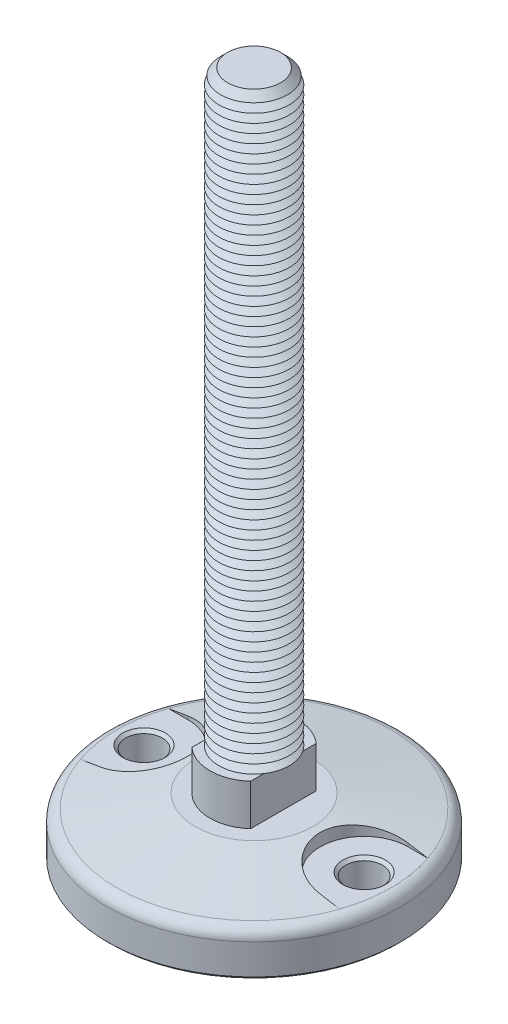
ISO-10303-21;
HEADER;
FILE_DESCRIPTION(('STEP AP214'),'2;1');
FILE_NAME('part.step','',(''),(''),'','','');
FILE_SCHEMA(('AUTOMOTIVE_DESIGN { 1 0 10303 214 1 1 1 1 }'));
ENDSEC;
DATA;
#1=APPLICATION_CONTEXT('core data for automotive mechanical design processes');
#2=APPLICATION_PROTOCOL_DEFINITION('international standard','automotive_design',2000,#1);
#3=PRODUCT_CONTEXT('',#1,'mechanical');
#4=PRODUCT('Part','Part','',(#3));
#5=PRODUCT_RELATED_PRODUCT_CATEGORY('part','',(#4));
#6=PRODUCT_DEFINITION_FORMATION('','',#4);
#7=PRODUCT_DEFINITION_CONTEXT('part definition',#1,'design');
#8=PRODUCT_DEFINITION('design','',#6,#7);
#9=PRODUCT_DEFINITION_SHAPE('','',#8);
#10=(LENGTH_UNIT() NAMED_UNIT(*) SI_UNIT(.MILLI.,.METRE.));
#11=(NAMED_UNIT(*) PLANE_ANGLE_UNIT() SI_UNIT($,.RADIAN.));
#12=(NAMED_UNIT(*) SI_UNIT($,.STERADIAN.) SOLID_ANGLE_UNIT());
#13=UNCERTAINTY_MEASURE_WITH_UNIT(LENGTH_MEASURE(1.E-05),#10,'distance_accuracy_value','');
#14=(GEOMETRIC_REPRESENTATION_CONTEXT(3) GLOBAL_UNCERTAINTY_ASSIGNED_CONTEXT((#13)) GLOBAL_UNIT_ASSIGNED_CONTEXT((#10,
#11,#12)) REPRESENTATION_CONTEXT('',''));
#15=CARTESIAN_POINT('',(0.,0.,0.));
#16=DIRECTION('',(0.,0.,1.));
#17=DIRECTION('',(1.,0.,0.));
#18=AXIS2_PLACEMENT_3D('',#15,#16,#17);
#19=CARTESIAN_POINT('',(0.,0.,0.));
#20=DIRECTION('',(0.,-1.,0.));
#21=DIRECTION('',(0.,0.,-1.));
#22=AXIS2_PLACEMENT_3D('',#19,#20,#21);
#23=CONICAL_SURFACE('',#22,20.,1.39626340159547);
#24=CARTESIAN_POINT('',(-37.5002,-3.59511701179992,14.9999999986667));
#25=CARTESIAN_POINT('',(-37.071618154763,-3.52495922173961,15.0000502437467));
#26=CARTESIAN_POINT('',(-36.6432161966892,-3.45377973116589,14.9816452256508));
#27=CARTESIAN_POINT('',(-35.7898597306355,-3.30975397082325,14.9083347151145));
#28=CARTESIAN_POINT('',(-35.3649049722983,-3.23690782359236,14.8534318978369));
#29=CARTESIAN_POINT('',(-34.5217702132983,-3.0899678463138,14.7075882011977));
#30=CARTESIAN_POINT('',(-34.1035855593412,-3.0158749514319,14.6166732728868));
#31=CARTESIAN_POINT('',(-33.276654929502,-2.86680950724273,14.3995164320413));
#32=CARTESIAN_POINT('',(-32.8679089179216,-2.79183696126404,14.2732746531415));
#33=CARTESIAN_POINT('',(-32.0626157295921,-2.64144796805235,13.9863372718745));
#34=CARTESIAN_POINT('',(-31.6660727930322,-2.56603137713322,13.8256298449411));
#35=CARTESIAN_POINT('',(-30.8881421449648,-2.41529591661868,13.4709346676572));
#36=CARTESIAN_POINT('',(-30.5067544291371,-2.33997704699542,13.276946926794));
#37=CARTESIAN_POINT('',(-29.7618852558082,-2.19002394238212,12.8570734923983));
#38=CARTESIAN_POINT('',(-29.3984015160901,-2.11538962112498,12.6311918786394));
#39=CARTESIAN_POINT('',(-28.6918747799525,-1.96744405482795,12.1490672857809));
#40=CARTESIAN_POINT('',(-28.3488317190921,-1.89413280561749,11.8928244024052));
#41=CARTESIAN_POINT('',(-27.68528276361,-1.7494825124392,11.3514262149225));
#42=CARTESIAN_POINT('',(-27.3648018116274,-1.67814570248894,11.0662397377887));
#43=CARTESIAN_POINT('',(-26.7491189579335,-1.5383468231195,10.4691194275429));
#44=CARTESIAN_POINT('',(-26.4539171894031,-1.46988476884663,10.1571854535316));
#45=CARTESIAN_POINT('',(-25.89093801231,-1.33673920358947,9.50863296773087));
#46=CARTESIAN_POINT('',(-25.6231651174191,-1.27205631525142,9.172010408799));
#47=CARTESIAN_POINT('',(-25.1171410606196,-1.14749043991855,8.47642452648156));
#48=CARTESIAN_POINT('',(-24.8788895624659,-1.08760739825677,8.11746145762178));
#49=CARTESIAN_POINT('',(-24.4362735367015,-0.974368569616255,7.38380225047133));
#50=CARTESIAN_POINT('',(-24.2315599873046,-0.920947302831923,7.009326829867));
#51=CARTESIAN_POINT('',(-23.8544760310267,-0.820970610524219,6.24354239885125));
#52=CARTESIAN_POINT('',(-23.6821054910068,-0.774415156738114,5.85223345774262));
#53=CARTESIAN_POINT('',(-23.3712027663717,-0.689292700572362,5.05567287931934));
#54=CARTESIAN_POINT('',(-23.2326612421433,-0.650723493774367,4.65042512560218));
#55=CARTESIAN_POINT('',(-22.9905836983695,-0.582602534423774,3.82886542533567));
#56=CARTESIAN_POINT('',(-22.8870466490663,-0.553050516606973,3.41255380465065));
#57=CARTESIAN_POINT('',(-22.7185202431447,-0.504595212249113,2.58473472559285));
#58=CARTESIAN_POINT('',(-22.6524606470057,-0.485397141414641,2.17346220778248));
#59=CARTESIAN_POINT('',(-22.5547584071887,-0.456903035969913,1.34650988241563));
#60=CARTESIAN_POINT('',(-22.5231150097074,-0.447606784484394,0.930830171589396));
#61=CARTESIAN_POINT('',(-22.4945397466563,-0.439214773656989,0.0982343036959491));
#62=CARTESIAN_POINT('',(-22.4976030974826,-0.440117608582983,-0.318681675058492));
#63=CARTESIAN_POINT('',(-22.5384014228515,-0.452091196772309,-1.15066338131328));
#64=CARTESIAN_POINT('',(-22.5761359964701,-0.463161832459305,-1.56572913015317));
#65=CARTESIAN_POINT('',(-22.684465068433,-0.494692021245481,-2.37993589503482));
#66=CARTESIAN_POINT('',(-22.7541599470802,-0.514894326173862,-2.77920702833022));
#67=CARTESIAN_POINT('',(-22.9254719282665,-0.564017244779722,-3.57028216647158));
#68=CARTESIAN_POINT('',(-23.0270883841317,-0.59293768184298,-3.96208632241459));
#69=CARTESIAN_POINT('',(-23.2614195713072,-0.658733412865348,-4.7356274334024));
#70=CARTESIAN_POINT('',(-23.3941371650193,-0.695609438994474,-5.11736345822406));
#71=CARTESIAN_POINT('',(-23.6896243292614,-0.77643223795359,-5.86824656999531));
#72=CARTESIAN_POINT('',(-23.8523945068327,-0.820379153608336,-6.23739340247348));
#73=CARTESIAN_POINT('',(-24.2096654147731,-0.91517964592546,-6.96667519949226));
#74=CARTESIAN_POINT('',(-24.4046414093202,-0.966134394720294,-7.32656415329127));
#75=CARTESIAN_POINT('',(-24.8229317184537,-1.07340641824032,-8.02863083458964));
#76=CARTESIAN_POINT('',(-25.0462462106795,-1.12972372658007,-8.37080845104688));
#77=CARTESIAN_POINT('',(-25.5196353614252,-1.24678782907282,-9.03533577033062));
#78=CARTESIAN_POINT('',(-25.7697111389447,-1.30753480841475,-9.35768464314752));
#79=CARTESIAN_POINT('',(-26.2948980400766,-1.43258611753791,-9.98056367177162));
#80=CARTESIAN_POINT('',(-26.5700098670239,-1.4968905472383,-10.2810932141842));
#81=CARTESIAN_POINT('',(-27.1529305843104,-1.63043794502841,-10.8680655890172));
#82=CARTESIAN_POINT('',(-27.4615208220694,-1.69977394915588,-11.1537117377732));
#83=CARTESIAN_POINT('',(-28.101294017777,-1.84060155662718,-11.6978928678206));
#84=CARTESIAN_POINT('',(-28.4324776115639,-1.91209322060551,-11.9564270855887));
#85=CARTESIAN_POINT('',(-29.1152826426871,-2.05655312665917,-12.4447886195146));
#86=CARTESIAN_POINT('',(-29.4669124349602,-2.12952196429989,-12.6746040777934));
#87=CARTESIAN_POINT('',(-30.1880609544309,-2.27627325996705,-13.1038783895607));
#88=CARTESIAN_POINT('',(-30.5575792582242,-2.35005569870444,-13.303337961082));
#89=CARTESIAN_POINT('',(-31.3189196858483,-2.49923001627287,-13.6739446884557));
#90=CARTESIAN_POINT('',(-31.7110266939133,-2.5746265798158,-13.8445050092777));
#91=CARTESIAN_POINT('',(-32.5084114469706,-2.72514849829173,-14.1515569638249));
#92=CARTESIAN_POINT('',(-32.9136891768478,-2.80027385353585,-14.2880486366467));
#93=CARTESIAN_POINT('',(-33.7340205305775,-2.94968142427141,-14.5258238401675));
#94=CARTESIAN_POINT('',(-34.1490613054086,-3.02396457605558,-14.6271511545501));
#95=CARTESIAN_POINT('',(-34.9863081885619,-3.17132754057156,-14.7940335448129));
#96=CARTESIAN_POINT('',(-35.4085107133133,-3.24440792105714,-14.8596059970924));
#97=CARTESIAN_POINT('',(-36.1096790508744,-3.36387020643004,-14.9380274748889));
#98=CARTESIAN_POINT('',(-36.3874461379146,-3.41070654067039,-14.9612791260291));
#99=CARTESIAN_POINT('',(-36.943509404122,-3.50354098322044,-14.9922564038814));
#100=CARTESIAN_POINT('',(-37.2218039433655,-3.54954035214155,-15.0000076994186));
#101=CARTESIAN_POINT('',(-37.5002,-3.59511701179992,-14.9999999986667));
#102=B_SPLINE_CURVE_WITH_KNOTS('',3,(#24,#25,#26,#27,#28,#29,#30,#31,#32,#33,#34,#35,#36,#37,
#38,#39,#40,#41,#42,#43,#44,#45,#46,#47,#48,#49,#50,#51,#52,#53,#54,#55,#56,#57,#58,#59,#60,#61,
#62,#63,#64,#65,#66,#67,#68,#69,#70,#71,#72,#73,#74,#75,#76,#77,#78,#79,#80,#81,#82,#83,#84,#85,
#86,#87,#88,#89,#90,#91,#92,#93,#94,#95,#96,#97,#98,#99,#100,#101),.UNSPECIFIED.,.F.,.F.,(4,2,2,
2,2,2,2,2,2,2,2,2,2,2,2,2,2,2,2,2,2,2,2,2,2,2,2,2,2,2,2,2,2,2,2,2,2,2,4),(0.,1.30244924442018,
2.60480303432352,3.90622002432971,5.20763209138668,6.50949136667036,7.81135027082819,
9.11304279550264,10.4147312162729,11.7178367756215,13.0209491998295,14.3242757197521,
15.6275873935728,16.9163305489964,18.205068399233,19.4934500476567,20.7817937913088,
22.0312084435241,23.2805957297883,24.5298108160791,25.779011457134,26.9950246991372,
28.2110133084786,29.4271138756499,30.6432390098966,31.8792469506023,33.1152626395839,
34.3513300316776,35.5874321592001,36.864491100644,38.1415859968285,39.4192064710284,
40.6967967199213,41.9978357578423,43.2988733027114,44.5982850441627,45.8970647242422,
46.7446059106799,47.590742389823),.UNSPECIFIED.);
#103=CARTESIAN_POINT('',(-37.5,-3.59508426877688,15.));
#104=VERTEX_POINT('',#103);
#105=CARTESIAN_POINT('',(-37.5,-3.59508426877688,-15.));
#106=VERTEX_POINT('',#105);
#107=EDGE_CURVE('E807',#104,#106,#102,.T.);
#108=ORIENTED_EDGE('',*,*,#107,.F.);
#109=CARTESIAN_POINT('',(-58.7331838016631,-7.16211468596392,15.));
#110=CARTESIAN_POINT('',(-57.4400366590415,-6.941199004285,15.));
#111=CARTESIAN_POINT('',(-56.1468183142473,-6.72069896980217,15.));
#112=CARTESIAN_POINT('',(-53.5602019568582,-6.2807555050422,15.));
#113=CARTESIAN_POINT('',(-52.2668039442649,-6.06131207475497,15.));
#114=CARTESIAN_POINT('',(-49.6798066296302,-5.62370977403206,15.));
#115=CARTESIAN_POINT('',(-48.3862073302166,-5.40555088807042,15.));
#116=CARTESIAN_POINT('',(-45.7987405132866,-4.97082983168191,15.));
#117=CARTESIAN_POINT('',(-44.5048729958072,-4.75426766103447,15.));
#118=CARTESIAN_POINT('',(-41.9167872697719,-4.32315417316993,15.));
#119=CARTESIAN_POINT('',(-40.6225690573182,-4.10860287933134,15.));
#120=CARTESIAN_POINT('',(-38.0337081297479,-3.68208609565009,15.));
#121=CARTESIAN_POINT('',(-36.7390654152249,-3.47012060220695,15.));
#122=CARTESIAN_POINT('',(-34.1492138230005,-3.04956665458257,15.));
#123=CARTESIAN_POINT('',(-32.854004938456,-2.84097824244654,15.));
#124=CARTESIAN_POINT('',(-30.9106470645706,-2.53149468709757,15.));
#125=CARTESIAN_POINT('',(-30.2627688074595,-2.4288997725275,15.));
#126=CARTESIAN_POINT('',(-28.9668013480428,-2.22504633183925,15.));
#127=CARTESIAN_POINT('',(-28.3187121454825,-2.12378780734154,15.));
#128=CARTESIAN_POINT('',(-27.6705030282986,-2.02329919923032,15.));
#129=B_SPLINE_CURVE_WITH_KNOTS('',3,(#109,#110,#111,#112,#113,#114,#115,#116,#117,#118,#119,
#120,#121,#122,#123,#124,#125,#126,#127,#128),.UNSPECIFIED.,.F.,.F.,(4,2,2,2,2,2,2,2,2,4),(0.,
3.93564494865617,7.87128985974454,11.8068871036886,15.7424838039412,19.6781262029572,
23.6137631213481,27.5494490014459,29.5173013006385,31.4851559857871),.UNSPECIFIED.);
#130=CARTESIAN_POINT('',(-44.1779505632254,-4.7,15.));
#131=VERTEX_POINT('',#130);
#132=EDGE_CURVE('E781',#131,#104,#129,.T.);
#133=ORIENTED_EDGE('',*,*,#132,.F.);
#134=CARTESIAN_POINT('',(0.,-4.7,0.));
#135=DIRECTION('',(0.,1.,0.));
#136=DIRECTION('',(0.,0.,1.));
#137=AXIS2_PLACEMENT_3D('',#134,#135,#136);
#138=CIRCLE('',#137,46.6550245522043);
#139=CARTESIAN_POINT('',(-44.1779505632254,-4.7,-15.));
#140=VERTEX_POINT('',#139);
#141=EDGE_CURVE('E765',#131,#140,#138,.F.);
#142=ORIENTED_EDGE('',*,*,#141,.T.);
#143=CARTESIAN_POINT('',(-27.6705030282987,-2.02329919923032,-15.));
#144=CARTESIAN_POINT('',(-28.3187121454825,-2.12378780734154,-15.));
#145=CARTESIAN_POINT('',(-28.9668013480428,-2.22504633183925,-15.));
#146=CARTESIAN_POINT('',(-30.2627688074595,-2.4288997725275,-15.));
#147=CARTESIAN_POINT('',(-30.9106470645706,-2.53149468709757,-15.));
#148=CARTESIAN_POINT('',(-32.854004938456,-2.84097824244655,-15.));
#149=CARTESIAN_POINT('',(-34.1492138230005,-3.04956665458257,-15.));
#150=CARTESIAN_POINT('',(-36.7390654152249,-3.47012060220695,-15.));
#151=CARTESIAN_POINT('',(-38.033708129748,-3.68208609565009,-15.));
#152=CARTESIAN_POINT('',(-40.6225690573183,-4.10860287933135,-15.));
#153=CARTESIAN_POINT('',(-41.9167872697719,-4.32315417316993,-15.));
#154=CARTESIAN_POINT('',(-44.5048729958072,-4.75426766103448,-15.));
#155=CARTESIAN_POINT('',(-45.7987405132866,-4.97082983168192,-15.));
#156=CARTESIAN_POINT('',(-48.3862073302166,-5.40555088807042,-15.));
#157=CARTESIAN_POINT('',(-49.6798066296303,-5.62370977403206,-15.));
#158=CARTESIAN_POINT('',(-52.2668039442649,-6.06131207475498,-15.));
#159=CARTESIAN_POINT('',(-53.5602019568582,-6.28075550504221,-15.));
#160=CARTESIAN_POINT('',(-56.1468183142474,-6.72069896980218,-15.));
#161=CARTESIAN_POINT('',(-57.4400366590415,-6.941199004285,-15.));
#162=CARTESIAN_POINT('',(-58.7331838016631,-7.16211468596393,-15.));
#163=B_SPLINE_CURVE_WITH_KNOTS('',3,(#143,#144,#145,#146,#147,#148,#149,#150,#151,#152,#153,
#154,#155,#156,#157,#158,#159,#160,#161,#162),.UNSPECIFIED.,.F.,.F.,(4,2,2,2,2,2,2,2,2,4),(0.,
1.96785468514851,3.93570698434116,7.87139286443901,11.8070297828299,15.7426721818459,
19.6782688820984,23.6138661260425,27.5495110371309,31.4851559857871),.UNSPECIFIED.);
#164=EDGE_CURVE('E773',#106,#140,#163,.T.);
#165=ORIENTED_EDGE('',*,*,#164,.F.);
#166=EDGE_LOOP('',(#108,#133,#142,#165));
#167=FACE_BOUND('',#166,.T.);
#168=CARTESIAN_POINT('',(0.,-4.70697693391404,0.));
#169=DIRECTION('',(0.,1.,0.));
#170=DIRECTION('',(0.,0.,1.));
#171=AXIS2_PLACEMENT_3D('',#168,#169,#170);
#172=CIRCLE('',#171,46.6945927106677);
#173=CARTESIAN_POINT('',(0.,-4.70697693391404,46.6945927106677));
#174=VERTEX_POINT('',#173);
#175=EDGE_CURVE('E754',#174,#174,#172,.T.);
#176=ORIENTED_EDGE('',*,*,#175,.T.);
#177=EDGE_LOOP('',(#176));
#178=FACE_BOUND('',#177,.T.);
#179=CARTESIAN_POINT('',(0.,0.,0.));
#180=DIRECTION('',(0.,1.,0.));
#181=DIRECTION('',(0.,0.,1.));
#182=AXIS2_PLACEMENT_3D('',#179,#180,#181);
#183=CIRCLE('',#182,20.);
#184=CARTESIAN_POINT('',(0.,0.,20.));
#185=VERTEX_POINT('',#184);
#186=EDGE_CURVE('E750',#185,#185,#183,.T.);
#187=ORIENTED_EDGE('',*,*,#186,.F.);
#188=EDGE_LOOP('',(#187));
#189=FACE_BOUND('',#188,.T.);
#190=CARTESIAN_POINT('',(53.8330700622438,-6.32728263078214,15.));
#191=CARTESIAN_POINT('',(52.5396994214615,-6.10761035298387,15.));
#192=CARTESIAN_POINT('',(51.2462390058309,-5.88846451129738,15.));
#193=CARTESIAN_POINT('',(48.6590869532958,-5.45154457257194,15.));
#194=CARTESIAN_POINT('',(47.3653953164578,-5.23377047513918,15.));
#195=CARTESIAN_POINT('',(44.7777592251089,-4.79991793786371,15.));
#196=CARTESIAN_POINT('',(43.4838147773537,-4.58383945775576,15.));
#197=CARTESIAN_POINT('',(40.8955691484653,-4.15382985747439,15.));
#198=CARTESIAN_POINT('',(39.6012679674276,-3.93989873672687,15.));
#199=CARTESIAN_POINT('',(37.0121780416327,-3.51480066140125,15.));
#200=CARTESIAN_POINT('',(35.7173892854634,-3.30363377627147,15.));
#201=CARTESIAN_POINT('',(33.1272261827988,-2.88493970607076,15.));
#202=CARTESIAN_POINT('',(31.8318518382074,-2.67741250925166,15.));
#203=CARTESIAN_POINT('',(29.8881899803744,-2.36980627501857,15.));
#204=CARTESIAN_POINT('',(29.2401942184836,-2.2678836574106,15.));
#205=CARTESIAN_POINT('',(27.9439769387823,-2.06548679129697,15.));
#206=CARTESIAN_POINT('',(27.2957554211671,-1.96501254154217,15.));
#207=CARTESIAN_POINT('',(25.9990437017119,-1.76576366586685,15.));
#208=CARTESIAN_POINT('',(25.3505534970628,-1.66698905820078,15.));
#209=CARTESIAN_POINT('',(24.0532646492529,-1.47147446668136,15.));
#210=CARTESIAN_POINT('',(23.4044660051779,-1.37473448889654,15.));
#211=CARTESIAN_POINT('',(22.7554917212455,-1.27917906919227,15.));
#212=B_SPLINE_CURVE_WITH_KNOTS('',3,(#190,#191,#192,#193,#194,#195,#196,#197,#198,#199,#200,
#201,#202,#203,#204,#205,#206,#207,#208,#209,#210,#211),.UNSPECIFIED.,.F.,.F.,(4,2,2,2,2,2,2,2,
2,2,4),(0.,3.93567975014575,7.87135837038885,11.806943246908,15.7425270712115,19.6782095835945,
23.6138793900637,25.5817654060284,27.5496497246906,29.5175551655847,31.4854664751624),.UNSPECIFIED.);
#213=CARTESIAN_POINT('',(44.1779505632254,-4.7,15.));
#214=VERTEX_POINT('',#213);
#215=CARTESIAN_POINT('',(37.5,-3.59508426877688,15.));
#216=VERTEX_POINT('',#215);
#217=EDGE_CURVE('E133',#214,#216,#212,.T.);
#218=ORIENTED_EDGE('',*,*,#217,.T.);
#219=CARTESIAN_POINT('',(37.5002,-3.59511701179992,14.9999999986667));
#220=CARTESIAN_POINT('',(37.071618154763,-3.52495922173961,15.0000502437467));
#221=CARTESIAN_POINT('',(36.6432161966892,-3.45377973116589,14.9816452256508));
#222=CARTESIAN_POINT('',(35.7898597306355,-3.30975397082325,14.9083347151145));
#223=CARTESIAN_POINT('',(35.3649049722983,-3.23690782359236,14.8534318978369));
#224=CARTESIAN_POINT('',(34.5217702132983,-3.0899678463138,14.7075882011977));
#225=CARTESIAN_POINT('',(34.1035855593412,-3.0158749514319,14.6166732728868));
#226=CARTESIAN_POINT('',(33.276654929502,-2.86680950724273,14.3995164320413));
#227=CARTESIAN_POINT('',(32.8679089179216,-2.79183696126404,14.2732746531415));
#228=CARTESIAN_POINT('',(32.0626157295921,-2.64144796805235,13.9863372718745));
#229=CARTESIAN_POINT('',(31.6660727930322,-2.56603137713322,13.8256298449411));
#230=CARTESIAN_POINT('',(30.8881421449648,-2.41529591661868,13.4709346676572));
#231=CARTESIAN_POINT('',(30.5067544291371,-2.33997704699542,13.276946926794));
#232=CARTESIAN_POINT('',(29.7618852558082,-2.19002394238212,12.8570734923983));
#233=CARTESIAN_POINT('',(29.3984015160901,-2.11538962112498,12.6311918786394));
#234=CARTESIAN_POINT('',(28.6918747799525,-1.96744405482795,12.1490672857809));
#235=CARTESIAN_POINT('',(28.3488317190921,-1.89413280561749,11.8928244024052));
#236=CARTESIAN_POINT('',(27.68528276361,-1.7494825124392,11.3514262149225));
#237=CARTESIAN_POINT('',(27.3648018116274,-1.67814570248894,11.0662397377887));
#238=CARTESIAN_POINT('',(26.7491189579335,-1.5383468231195,10.4691194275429));
#239=CARTESIAN_POINT('',(26.4539171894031,-1.46988476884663,10.1571854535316));
#240=CARTESIAN_POINT('',(25.89093801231,-1.33673920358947,9.50863296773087));
#241=CARTESIAN_POINT('',(25.6231651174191,-1.27205631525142,9.172010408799));
#242=CARTESIAN_POINT('',(25.1171410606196,-1.14749043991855,8.47642452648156));
#243=CARTESIAN_POINT('',(24.8788895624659,-1.08760739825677,8.11746145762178));
#244=CARTESIAN_POINT('',(24.4362735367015,-0.974368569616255,7.38380225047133));
#245=CARTESIAN_POINT('',(24.2315599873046,-0.920947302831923,7.009326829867));
#246=CARTESIAN_POINT('',(23.8544760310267,-0.820970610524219,6.24354239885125));
#247=CARTESIAN_POINT('',(23.6821054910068,-0.774415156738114,5.85223345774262));
#248=CARTESIAN_POINT('',(23.3712027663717,-0.689292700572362,5.05567287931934));
#249=CARTESIAN_POINT('',(23.2326612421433,-0.650723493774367,4.65042512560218));
#250=CARTESIAN_POINT('',(22.9905836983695,-0.582602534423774,3.82886542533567));
#251=CARTESIAN_POINT('',(22.8870466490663,-0.553050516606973,3.41255380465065));
#252=CARTESIAN_POINT('',(22.7185202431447,-0.504595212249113,2.58473472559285));
#253=CARTESIAN_POINT('',(22.6524606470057,-0.485397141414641,2.17346220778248));
#254=CARTESIAN_POINT('',(22.5547584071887,-0.456903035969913,1.34650988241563));
#255=CARTESIAN_POINT('',(22.5231150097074,-0.447606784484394,0.930830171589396));
#256=CARTESIAN_POINT('',(22.4945397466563,-0.439214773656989,0.0982343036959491));
#257=CARTESIAN_POINT('',(22.4976030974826,-0.440117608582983,-0.318681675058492));
#258=CARTESIAN_POINT('',(22.5384014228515,-0.452091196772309,-1.15066338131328));
#259=CARTESIAN_POINT('',(22.5761359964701,-0.463161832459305,-1.56572913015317));
#260=CARTESIAN_POINT('',(22.684465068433,-0.494692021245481,-2.37993589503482));
#261=CARTESIAN_POINT('',(22.7541599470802,-0.514894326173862,-2.77920702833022));
#262=CARTESIAN_POINT('',(22.9254719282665,-0.564017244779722,-3.57028216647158));
#263=CARTESIAN_POINT('',(23.0270883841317,-0.59293768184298,-3.96208632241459));
#264=CARTESIAN_POINT('',(23.2614195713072,-0.658733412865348,-4.7356274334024));
#265=CARTESIAN_POINT('',(23.3941371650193,-0.695609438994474,-5.11736345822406));
#266=CARTESIAN_POINT('',(23.6896243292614,-0.77643223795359,-5.86824656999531));
#267=CARTESIAN_POINT('',(23.8523945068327,-0.820379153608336,-6.23739340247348));
#268=CARTESIAN_POINT('',(24.2096654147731,-0.91517964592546,-6.96667519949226));
#269=CARTESIAN_POINT('',(24.4046414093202,-0.966134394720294,-7.32656415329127));
#270=CARTESIAN_POINT('',(24.8229317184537,-1.07340641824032,-8.02863083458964));
#271=CARTESIAN_POINT('',(25.0462462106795,-1.12972372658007,-8.37080845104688));
#272=CARTESIAN_POINT('',(25.5196353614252,-1.24678782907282,-9.03533577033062));
#273=CARTESIAN_POINT('',(25.7697111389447,-1.30753480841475,-9.35768464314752));
#274=CARTESIAN_POINT('',(26.2948980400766,-1.43258611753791,-9.98056367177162));
#275=CARTESIAN_POINT('',(26.5700098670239,-1.4968905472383,-10.2810932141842));
#276=CARTESIAN_POINT('',(27.1529305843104,-1.63043794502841,-10.8680655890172));
#277=CARTESIAN_POINT('',(27.4615208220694,-1.69977394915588,-11.1537117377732));
#278=CARTESIAN_POINT('',(28.101294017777,-1.84060155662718,-11.6978928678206));
#279=CARTESIAN_POINT('',(28.4324776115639,-1.91209322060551,-11.9564270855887));
#280=CARTESIAN_POINT('',(29.1152826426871,-2.05655312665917,-12.4447886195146));
#281=CARTESIAN_POINT('',(29.4669124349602,-2.12952196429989,-12.6746040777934));
#282=CARTESIAN_POINT('',(30.1880609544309,-2.27627325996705,-13.1038783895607));
#283=CARTESIAN_POINT('',(30.5575792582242,-2.35005569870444,-13.303337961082));
#284=CARTESIAN_POINT('',(31.3189196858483,-2.49923001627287,-13.6739446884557));
#285=CARTESIAN_POINT('',(31.7110266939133,-2.5746265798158,-13.8445050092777));
#286=CARTESIAN_POINT('',(32.5084114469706,-2.72514849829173,-14.1515569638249));
#287=CARTESIAN_POINT('',(32.9136891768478,-2.80027385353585,-14.2880486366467));
#288=CARTESIAN_POINT('',(33.7340205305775,-2.94968142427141,-14.5258238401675));
#289=CARTESIAN_POINT('',(34.1490613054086,-3.02396457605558,-14.6271511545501));
#290=CARTESIAN_POINT('',(34.9863081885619,-3.17132754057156,-14.7940335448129));
#291=CARTESIAN_POINT('',(35.4085107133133,-3.24440792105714,-14.8596059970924));
#292=CARTESIAN_POINT('',(36.1096790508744,-3.36387020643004,-14.9380274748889));
#293=CARTESIAN_POINT('',(36.3874461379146,-3.41070654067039,-14.9612791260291));
#294=CARTESIAN_POINT('',(36.943509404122,-3.50354098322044,-14.9922564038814));
#295=CARTESIAN_POINT('',(37.2218039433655,-3.54954035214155,-15.0000076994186));
#296=CARTESIAN_POINT('',(37.5002,-3.59511701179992,-14.9999999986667));
#297=B_SPLINE_CURVE_WITH_KNOTS('',3,(#219,#220,#221,#222,#223,#224,#225,#226,#227,#228,#229,
#230,#231,#232,#233,#234,#235,#236,#237,#238,#239,#240,#241,#242,#243,#244,#245,#246,#247,#248,
#249,#250,#251,#252,#253,#254,#255,#256,#257,#258,#259,#260,#261,#262,#263,#264,#265,#266,#267,
#268,#269,#270,#271,#272,#273,#274,#275,#276,#277,#278,#279,#280,#281,#282,#283,#284,#285,#286,
#287,#288,#289,#290,#291,#292,#293,#294,#295,#296),.UNSPECIFIED.,.F.,.F.,(4,2,2,2,2,2,2,2,2,2,2,
2,2,2,2,2,2,2,2,2,2,2,2,2,2,2,2,2,2,2,2,2,2,2,2,2,2,2,4),(0.,1.30244924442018,2.60480303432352,
3.90622002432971,5.20763209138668,6.50949136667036,7.81135027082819,9.11304279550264,
10.4147312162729,11.7178367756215,13.0209491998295,14.3242757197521,15.6275873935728,
16.9163305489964,18.205068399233,19.4934500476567,20.7817937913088,22.0312084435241,
23.2805957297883,24.5298108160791,25.779011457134,26.9950246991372,28.2110133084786,
29.4271138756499,30.6432390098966,31.8792469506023,33.1152626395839,34.3513300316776,
35.5874321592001,36.864491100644,38.1415859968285,39.4192064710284,40.6967967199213,
41.9978357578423,43.2988733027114,44.5982850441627,45.8970647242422,46.7446059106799,
47.590742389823),.UNSPECIFIED.);
#298=CARTESIAN_POINT('',(37.5,-3.59508426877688,-15.));
#299=VERTEX_POINT('',#298);
#300=EDGE_CURVE('E145',#216,#299,#297,.T.);
#301=ORIENTED_EDGE('',*,*,#300,.T.);
#302=CARTESIAN_POINT('',(22.7554917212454,-1.27917906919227,-15.));
#303=CARTESIAN_POINT('',(23.4044660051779,-1.37473448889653,-15.));
#304=CARTESIAN_POINT('',(24.0532646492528,-1.47147446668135,-15.));
#305=CARTESIAN_POINT('',(25.3505534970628,-1.66698905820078,-15.));
#306=CARTESIAN_POINT('',(25.9990437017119,-1.76576366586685,-15.));
#307=CARTESIAN_POINT('',(27.2957554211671,-1.96501254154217,-15.));
#308=CARTESIAN_POINT('',(27.9439769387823,-2.06548679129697,-15.));
#309=CARTESIAN_POINT('',(29.2401942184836,-2.2678836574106,-15.));
#310=CARTESIAN_POINT('',(29.8881899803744,-2.36980627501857,-15.));
#311=CARTESIAN_POINT('',(31.8318518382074,-2.67741250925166,-15.));
#312=CARTESIAN_POINT('',(33.1272261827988,-2.88493970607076,-15.));
#313=CARTESIAN_POINT('',(35.7173892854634,-3.30363377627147,-15.));
#314=CARTESIAN_POINT('',(37.0121780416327,-3.51480066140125,-15.));
#315=CARTESIAN_POINT('',(39.6012679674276,-3.93989873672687,-15.));
#316=CARTESIAN_POINT('',(40.8955691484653,-4.1538298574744,-15.));
#317=CARTESIAN_POINT('',(43.4838147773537,-4.58383945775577,-15.));
#318=CARTESIAN_POINT('',(44.7777592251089,-4.79991793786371,-15.));
#319=CARTESIAN_POINT('',(47.3653953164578,-5.23377047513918,-15.));
#320=CARTESIAN_POINT('',(48.6590869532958,-5.45154457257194,-15.));
#321=CARTESIAN_POINT('',(51.2462390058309,-5.88846451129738,-15.));
#322=CARTESIAN_POINT('',(52.5396994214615,-6.10761035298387,-15.));
#323=CARTESIAN_POINT('',(53.8330700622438,-6.32728263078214,-15.));
#324=B_SPLINE_CURVE_WITH_KNOTS('',3,(#302,#303,#304,#305,#306,#307,#308,#309,#310,#311,#312,
#313,#314,#315,#316,#317,#318,#319,#320,#321,#322,#323),.UNSPECIFIED.,.F.,.F.,(4,2,2,2,2,2,2,2,
2,2,4),(0.,1.96791130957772,3.93581675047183,5.90370106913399,7.87158708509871,11.8072568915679,
15.7429394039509,19.6785232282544,23.6141081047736,27.5497867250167,31.4854664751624),.UNSPECIFIED.);
#325=CARTESIAN_POINT('',(44.1779505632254,-4.7,-15.));
#326=VERTEX_POINT('',#325);
#327=EDGE_CURVE('E838',#299,#326,#324,.T.);
#328=ORIENTED_EDGE('',*,*,#327,.T.);
#329=CARTESIAN_POINT('',(0.,-4.7,0.));
#330=DIRECTION('',(0.,1.,0.));
#331=DIRECTION('',(0.,0.,1.));
#332=AXIS2_PLACEMENT_3D('',#329,#330,#331);
#333=CIRCLE('',#332,46.6550245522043);
#334=EDGE_CURVE('E829',#326,#214,#333,.F.);
#335=ORIENTED_EDGE('',*,*,#334,.T.);
#336=EDGE_LOOP('',(#218,#301,#328,#335));
#337=FACE_BOUND('',#336,.T.);
#338=ADVANCED_FACE('F39',(#167,#178,#189,#337),#23,.T.);
#339=CARTESIAN_POINT('',(0.,14.,0.));
#340=DIRECTION('',(0.,1.,0.));
#341=DIRECTION('',(0.,0.,1.));
#342=AXIS2_PLACEMENT_3D('',#339,#340,#341);
#343=PLANE('',#342);
#344=CARTESIAN_POINT('',(0.,14.,0.));
#345=DIRECTION('',(0.,1.,0.));
#346=DIRECTION('',(0.,0.,1.));
#347=AXIS2_PLACEMENT_3D('',#344,#345,#346);
#348=CIRCLE('',#347,12.);
#349=CARTESIAN_POINT('',(9.99999999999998,14.,-6.63324958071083));
#350=VERTEX_POINT('',#349);
#351=CARTESIAN_POINT('',(-10.,14.,-6.6332495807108));
#352=VERTEX_POINT('',#351);
#353=EDGE_CURVE('E766',#350,#352,#348,.T.);
#354=ORIENTED_EDGE('',*,*,#353,.F.);
#355=DIRECTION('',(0.,0.,1.));
#356=VECTOR('',#355,1.);
#357=CARTESIAN_POINT('',(10.,14.,11.1803398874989));
#358=LINE('',#357,#356);
#359=CARTESIAN_POINT('',(10.,14.,-11.1803398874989));
#360=VERTEX_POINT('',#359);
#361=EDGE_CURVE('E729',#360,#350,#358,.T.);
#362=ORIENTED_EDGE('',*,*,#361,.F.);
#363=CARTESIAN_POINT('',(0.,14.,0.));
#364=DIRECTION('',(0.,1.,0.));
#365=DIRECTION('',(0.,0.,1.));
#366=AXIS2_PLACEMENT_3D('',#363,#364,#365);
#367=CIRCLE('',#366,15.);
#368=CARTESIAN_POINT('',(-10.,14.,-11.1803398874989));
#369=VERTEX_POINT('',#368);
#370=EDGE_CURVE('E743',#360,#369,#367,.T.);
#371=ORIENTED_EDGE('',*,*,#370,.T.);
#372=DIRECTION('',(0.,0.,-1.));
#373=VECTOR('',#372,1.);
#374=CARTESIAN_POINT('',(-10.,14.,-11.1803398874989));
#375=LINE('',#374,#373);
#376=EDGE_CURVE('E716',#352,#369,#375,.T.);
#377=ORIENTED_EDGE('',*,*,#376,.F.);
#378=EDGE_LOOP('',(#354,#362,#371,#377));
#379=FACE_BOUND('',#378,.T.);
#380=ADVANCED_FACE('F893',(#379),#343,.T.);
#381=CARTESIAN_POINT('',(0.,14.,0.));
#382=DIRECTION('',(0.,-1.,0.));
#383=DIRECTION('',(0.,0.,-1.));
#384=AXIS2_PLACEMENT_3D('',#381,#382,#383);
#385=CYLINDRICAL_SURFACE('',#384,15.);
#386=CARTESIAN_POINT('',(-10.,14.,11.1803398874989));
#387=VERTEX_POINT('',#386);
#388=CARTESIAN_POINT('',(10.,14.,11.1803398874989));
#389=VERTEX_POINT('',#388);
#390=EDGE_CURVE('E721',#387,#389,#367,.T.);
#391=ORIENTED_EDGE('',*,*,#390,.F.);
#392=DIRECTION('',(0.,1.,0.));
#393=VECTOR('',#392,1.);
#394=CARTESIAN_POINT('',(-10.,0.,11.1803398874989));
#395=LINE('',#394,#393);
#396=CARTESIAN_POINT('',(-10.,0.,11.1803398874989));
#397=VERTEX_POINT('',#396);
#398=EDGE_CURVE('E710',#397,#387,#395,.T.);
#399=ORIENTED_EDGE('',*,*,#398,.F.);
#400=CARTESIAN_POINT('',(0.,0.,0.));
#401=DIRECTION('',(0.,1.,0.));
#402=DIRECTION('',(0.,0.,1.));
#403=AXIS2_PLACEMENT_3D('',#400,#401,#402);
#404=CIRCLE('',#403,15.);
#405=CARTESIAN_POINT('',(10.,0.,11.1803398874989));
#406=VERTEX_POINT('',#405);
#407=EDGE_CURVE('E744',#397,#406,#404,.T.);
#408=ORIENTED_EDGE('',*,*,#407,.T.);
#409=DIRECTION('',(0.,1.,0.));
#410=VECTOR('',#409,1.);
#411=CARTESIAN_POINT('',(10.,0.,11.1803398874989));
#412=LINE('',#411,#410);
#413=EDGE_CURVE('E734',#406,#389,#412,.T.);
#414=ORIENTED_EDGE('',*,*,#413,.T.);
#415=EDGE_LOOP('',(#391,#399,#408,#414));
#416=FACE_BOUND('',#415,.T.);
#417=ADVANCED_FACE('F898',(#416),#385,.T.);
#418=CARTESIAN_POINT('',(0.,0.,0.));
#419=DIRECTION('',(0.,1.,0.));
#420=DIRECTION('',(0.,0.,1.));
#421=AXIS2_PLACEMENT_3D('',#418,#419,#420);
#422=PLANE('',#421);
#423=CARTESIAN_POINT('',(10.,0.,-11.1803398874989));
#424=VERTEX_POINT('',#423);
#425=CARTESIAN_POINT('',(-10.,0.,-11.1803398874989));
#426=VERTEX_POINT('',#425);
#427=EDGE_CURVE('E748',#424,#426,#404,.T.);
#428=ORIENTED_EDGE('',*,*,#427,.F.);
#429=DIRECTION('',(0.,0.,1.));
#430=VECTOR('',#429,1.);
#431=CARTESIAN_POINT('',(10.,0.,11.1803398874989));
#432=LINE('',#431,#430);
#433=EDGE_CURVE('E724',#424,#406,#432,.T.);
#434=ORIENTED_EDGE('',*,*,#433,.T.);
#435=ORIENTED_EDGE('',*,*,#407,.F.);
#436=DIRECTION('',(0.,0.,-1.));
#437=VECTOR('',#436,1.);
#438=CARTESIAN_POINT('',(-10.,0.,-11.1803398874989));
#439=LINE('',#438,#437);
#440=EDGE_CURVE('E706',#397,#426,#439,.T.);
#441=ORIENTED_EDGE('',*,*,#440,.T.);
#442=EDGE_LOOP('',(#428,#434,#435,#441));
#443=FACE_BOUND('',#442,.T.);
#444=ORIENTED_EDGE('',*,*,#186,.T.);
#445=EDGE_LOOP('',(#444));
#446=FACE_BOUND('',#445,.T.);
#447=ADVANCED_FACE('F935',(#443,#446),#422,.T.);
#448=CARTESIAN_POINT('',(0.,61.3388655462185,0.));
#449=DIRECTION('',(0.,1.,0.));
#450=DIRECTION('',(0.,0.,1.));
#451=AXIS2_PLACEMENT_3D('',#448,#449,#450);
#452=CYLINDRICAL_SURFACE('',#451,50.);
#453=CARTESIAN_POINT('',(0.,-19.,0.));
#454=DIRECTION('',(0.,-1.,0.));
#455=DIRECTION('',(0.,0.,-1.));
#456=AXIS2_PLACEMENT_3D('',#453,#454,#455);
#457=CIRCLE('',#456,50.);
#458=CARTESIAN_POINT('',(0.,-19.,-50.));
#459=VERTEX_POINT('',#458);
#460=EDGE_CURVE('E48',#459,#459,#457,.F.);
#461=ORIENTED_EDGE('',*,*,#460,.T.);
#462=EDGE_LOOP('',(#461));
#463=FACE_BOUND('',#462,.T.);
#464=CARTESIAN_POINT('',(0.,-8.64620794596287,0.));
#465=DIRECTION('',(0.,-1.,0.));
#466=DIRECTION('',(0.,0.,-1.));
#467=AXIS2_PLACEMENT_3D('',#464,#465,#466);
#468=CIRCLE('',#467,50.);
#469=CARTESIAN_POINT('',(0.,-8.64620794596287,-50.));
#470=VERTEX_POINT('',#469);
#471=EDGE_CURVE('E749',#470,#470,#468,.T.);
#472=ORIENTED_EDGE('',*,*,#471,.T.);
#473=EDGE_LOOP('',(#472));
#474=FACE_BOUND('',#473,.T.);
#475=ADVANCED_FACE('F880',(#463,#474),#452,.T.);
#476=CARTESIAN_POINT('',(0.,-20.,50.));
#477=DIRECTION('',(0.,-1.,0.));
#478=DIRECTION('',(0.,0.,-1.));
#479=AXIS2_PLACEMENT_3D('',#476,#477,#478);
#480=PLANE('',#479);
#481=CARTESIAN_POINT('',(0.,-20.,0.));
#482=DIRECTION('',(0.,-1.,0.));
#483=DIRECTION('',(0.,0.,-1.));
#484=AXIS2_PLACEMENT_3D('',#481,#482,#483);
#485=CIRCLE('',#484,49.);
#486=CARTESIAN_POINT('',(0.,-20.,-49.));
#487=VERTEX_POINT('',#486);
#488=EDGE_CURVE('E11',#487,#487,#485,.T.);
#489=ORIENTED_EDGE('',*,*,#488,.T.);
#490=EDGE_LOOP('',(#489));
#491=FACE_BOUND('',#490,.T.);
#492=CARTESIAN_POINT('',(37.5,-20.,0.));
#493=DIRECTION('',(0.,-1.,0.));
#494=DIRECTION('',(0.,0.,-1.));
#495=AXIS2_PLACEMENT_3D('',#492,#493,#494);
#496=CIRCLE('',#495,7.25000000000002);
#497=CARTESIAN_POINT('',(37.5,-20.,-7.25000000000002));
#498=VERTEX_POINT('',#497);
#499=EDGE_CURVE('E868',#498,#498,#496,.F.);
#500=ORIENTED_EDGE('',*,*,#499,.T.);
#501=EDGE_LOOP('',(#500));
#502=FACE_BOUND('',#501,.T.);
#503=CARTESIAN_POINT('',(-37.5,-20.,0.));
#504=DIRECTION('',(0.,-1.,0.));
#505=DIRECTION('',(0.,0.,-1.));
#506=AXIS2_PLACEMENT_3D('',#503,#504,#505);
#507=CIRCLE('',#506,7.25000000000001);
#508=CARTESIAN_POINT('',(-37.5,-20.,-7.25000000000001));
#509=VERTEX_POINT('',#508);
#510=EDGE_CURVE('E813',#509,#509,#507,.F.);
#511=ORIENTED_EDGE('',*,*,#510,.T.);
#512=EDGE_LOOP('',(#511));
#513=FACE_BOUND('',#512,.T.);
#514=ADVANCED_FACE('F973',(#491,#502,#513),#480,.T.);
#515=CARTESIAN_POINT('',(0.,-8.64620794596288,0.));
#516=DIRECTION('',(0.,-1.,0.));
#517=DIRECTION('',(0.,0.,-1.));
#518=AXIS2_PLACEMENT_3D('',#515,#516,#517);
#519=TOROIDAL_SURFACE('',#518,46.,4.);
#520=ORIENTED_EDGE('',*,*,#471,.F.);
#521=EDGE_LOOP('',(#520));
#522=FACE_BOUND('',#521,.T.);
#523=ORIENTED_EDGE('',*,*,#175,.F.);
#524=EDGE_LOOP('',(#523));
#525=FACE_BOUND('',#524,.T.);
#526=ADVANCED_FACE('F972',(#522,#525),#519,.T.);
#527=ORIENTED_EDGE('',*,*,#427,.T.);
#528=DIRECTION('',(0.,1.,0.));
#529=VECTOR('',#528,1.);
#530=CARTESIAN_POINT('',(-10.,0.,-11.1803398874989));
#531=LINE('',#530,#529);
#532=EDGE_CURVE('E717',#426,#369,#531,.T.);
#533=ORIENTED_EDGE('',*,*,#532,.T.);
#534=ORIENTED_EDGE('',*,*,#370,.F.);
#535=DIRECTION('',(0.,1.,0.));
#536=VECTOR('',#535,1.);
#537=CARTESIAN_POINT('',(10.,0.,-11.1803398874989));
#538=LINE('',#537,#536);
#539=EDGE_CURVE('E728',#424,#360,#538,.T.);
#540=ORIENTED_EDGE('',*,*,#539,.F.);
#541=EDGE_LOOP('',(#527,#533,#534,#540));
#542=FACE_BOUND('',#541,.T.);
#543=ADVANCED_FACE('F932',(#542),#385,.T.);
#544=CARTESIAN_POINT('',(-10.,14.,6.6332495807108));
#545=VERTEX_POINT('',#544);
#546=CARTESIAN_POINT('',(10.,14.,6.6332495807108));
#547=VERTEX_POINT('',#546);
#548=EDGE_CURVE('E705',#545,#547,#348,.T.);
#549=ORIENTED_EDGE('',*,*,#548,.F.);
#550=EDGE_CURVE('E711',#387,#545,#375,.T.);
#551=ORIENTED_EDGE('',*,*,#550,.F.);
#552=ORIENTED_EDGE('',*,*,#390,.T.);
#553=EDGE_CURVE('E704',#547,#389,#358,.T.);
#554=ORIENTED_EDGE('',*,*,#553,.F.);
#555=EDGE_LOOP('',(#549,#551,#552,#554));
#556=FACE_BOUND('',#555,.T.);
#557=ADVANCED_FACE('F901',(#556),#343,.T.);
#558=CARTESIAN_POINT('',(10.,0.,11.1803398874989));
#559=DIRECTION('',(-1.,0.,0.));
#560=DIRECTION('',(0.,0.,1.));
#561=AXIS2_PLACEMENT_3D('',#558,#559,#560);
#562=PLANE('',#561);
#563=ORIENTED_EDGE('',*,*,#361,.T.);
#564=EDGE_CURVE('E733',#350,#547,#358,.T.);
#565=ORIENTED_EDGE('',*,*,#564,.T.);
#566=ORIENTED_EDGE('',*,*,#553,.T.);
#567=ORIENTED_EDGE('',*,*,#413,.F.);
#568=ORIENTED_EDGE('',*,*,#433,.F.);
#569=ORIENTED_EDGE('',*,*,#539,.T.);
#570=EDGE_LOOP('',(#563,#565,#566,#567,#568,#569));
#571=FACE_BOUND('',#570,.T.);
#572=ADVANCED_FACE('F960',(#571),#562,.F.);
#573=CARTESIAN_POINT('',(-10.,0.,-11.1803398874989));
#574=DIRECTION('',(1.,0.,0.));
#575=DIRECTION('',(0.,0.,-1.));
#576=AXIS2_PLACEMENT_3D('',#573,#574,#575);
#577=PLANE('',#576);
#578=ORIENTED_EDGE('',*,*,#550,.T.);
#579=EDGE_CURVE('E715',#545,#352,#375,.T.);
#580=ORIENTED_EDGE('',*,*,#579,.T.);
#581=ORIENTED_EDGE('',*,*,#376,.T.);
#582=ORIENTED_EDGE('',*,*,#532,.F.);
#583=ORIENTED_EDGE('',*,*,#440,.F.);
#584=ORIENTED_EDGE('',*,*,#398,.T.);
#585=EDGE_LOOP('',(#578,#580,#581,#582,#583,#584));
#586=FACE_BOUND('',#585,.T.);
#587=ADVANCED_FACE('F940',(#586),#577,.F.);
#588=CARTESIAN_POINT('',(0.,14.,0.));
#589=DIRECTION('',(0.,1.,0.));
#590=DIRECTION('',(0.,0.,1.));
#591=AXIS2_PLACEMENT_3D('',#588,#589,#590);
#592=PLANE('',#591);
#593=ORIENTED_EDGE('',*,*,#579,.F.);
#594=EDGE_CURVE('E700',#352,#545,#348,.T.);
#595=ORIENTED_EDGE('',*,*,#594,.F.);
#596=EDGE_LOOP('',(#593,#595));
#597=FACE_BOUND('',#596,.T.);
#598=ADVANCED_FACE('F950',(#597),#592,.F.);
#599=ORIENTED_EDGE('',*,*,#564,.F.);
#600=EDGE_CURVE('E701',#547,#350,#348,.T.);
#601=ORIENTED_EDGE('',*,*,#600,.F.);
#602=EDGE_LOOP('',(#599,#601));
#603=FACE_BOUND('',#602,.T.);
#604=ADVANCED_FACE('F952',(#603),#592,.F.);
#605=CARTESIAN_POINT('',(0.,14.,0.));
#606=DIRECTION('',(0.,-1.,0.));
#607=DIRECTION('',(0.,0.,-1.));
#608=AXIS2_PLACEMENT_3D('',#605,#606,#607);
#609=CONICAL_SURFACE('',#608,12.,1.0471975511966);
#610=CARTESIAN_POINT('',(0.,15.5,0.));
#611=DIRECTION('',(0.,1.,0.));
#612=DIRECTION('',(0.,0.,1.));
#613=AXIS2_PLACEMENT_3D('',#610,#611,#612);
#614=CIRCLE('',#613,9.40192378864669);
#615=CARTESIAN_POINT('',(0.,15.5,9.40192378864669));
#616=VERTEX_POINT('',#615);
#617=EDGE_CURVE('E696',#616,#616,#614,.T.);
#618=ORIENTED_EDGE('',*,*,#617,.F.);
#619=EDGE_LOOP('',(#618));
#620=FACE_BOUND('',#619,.T.);
#621=ORIENTED_EDGE('',*,*,#600,.T.);
#622=ORIENTED_EDGE('',*,*,#353,.T.);
#623=ORIENTED_EDGE('',*,*,#594,.T.);
#624=ORIENTED_EDGE('',*,*,#548,.T.);
#625=EDGE_LOOP('',(#621,#622,#623,#624));
#626=FACE_BOUND('',#625,.T.);
#627=ADVANCED_FACE('F958',(#620,#626),#609,.T.);
#628=CARTESIAN_POINT('',(0.,15.5,0.));
#629=DIRECTION('',(0.,1.,0.));
#630=DIRECTION('',(0.,0.,1.));
#631=AXIS2_PLACEMENT_3D('',#628,#629,#630);
#632=CONICAL_SURFACE('',#631,9.40192378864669,1.0471975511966);
#633=CARTESIAN_POINT('',(0.,17.,0.));
#634=DIRECTION('',(0.,1.,0.));
#635=DIRECTION('',(0.,0.,1.));
#636=AXIS2_PLACEMENT_3D('',#633,#634,#635);
#637=CIRCLE('',#636,12.);
#638=CARTESIAN_POINT('',(0.,17.,12.));
#639=VERTEX_POINT('',#638);
#640=EDGE_CURVE('E692',#639,#639,#637,.T.);
#641=ORIENTED_EDGE('',*,*,#640,.F.);
#642=EDGE_LOOP('',(#641));
#643=FACE_BOUND('',#642,.T.);
#644=ORIENTED_EDGE('',*,*,#617,.T.);
#645=EDGE_LOOP('',(#644));
#646=FACE_BOUND('',#645,.T.);
#647=ADVANCED_FACE('F2047',(#643,#646),#632,.T.);
#648=CARTESIAN_POINT('',(0.,17.,0.));
#649=DIRECTION('',(0.,-1.,0.));
#650=DIRECTION('',(0.,0.,-1.));
#651=AXIS2_PLACEMENT_3D('',#648,#649,#650);
#652=CONICAL_SURFACE('',#651,12.,1.0471975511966);
#653=CARTESIAN_POINT('',(0.,18.5,0.));
#654=DIRECTION('',(0.,1.,0.));
#655=DIRECTION('',(0.,0.,1.));
#656=AXIS2_PLACEMENT_3D('',#653,#654,#655);
#657=CIRCLE('',#656,9.40192378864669);
#658=CARTESIAN_POINT('',(0.,18.5,9.40192378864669));
#659=VERTEX_POINT('',#658);
#660=EDGE_CURVE('E688',#659,#659,#657,.T.);
#661=ORIENTED_EDGE('',*,*,#660,.F.);
#662=EDGE_LOOP('',(#661));
#663=FACE_BOUND('',#662,.T.);
#664=ORIENTED_EDGE('',*,*,#640,.T.);
#665=EDGE_LOOP('',(#664));
#666=FACE_BOUND('',#665,.T.);
#667=ADVANCED_FACE('F2040',(#663,#666),#652,.T.);
#668=CARTESIAN_POINT('',(0.,18.5,0.));
#669=DIRECTION('',(0.,1.,0.));
#670=DIRECTION('',(0.,0.,1.));
#671=AXIS2_PLACEMENT_3D('',#668,#669,#670);
#672=CONICAL_SURFACE('',#671,9.40192378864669,1.0471975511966);
#673=CARTESIAN_POINT('',(0.,20.,0.));
#674=DIRECTION('',(0.,1.,0.));
#675=DIRECTION('',(0.,0.,1.));
#676=AXIS2_PLACEMENT_3D('',#673,#674,#675);
#677=CIRCLE('',#676,12.);
#678=CARTESIAN_POINT('',(0.,20.,12.));
#679=VERTEX_POINT('',#678);
#680=EDGE_CURVE('E684',#679,#679,#677,.T.);
#681=ORIENTED_EDGE('',*,*,#680,.F.);
#682=EDGE_LOOP('',(#681));
#683=FACE_BOUND('',#682,.T.);
#684=ORIENTED_EDGE('',*,*,#660,.T.);
#685=EDGE_LOOP('',(#684));
#686=FACE_BOUND('',#685,.T.);
#687=ADVANCED_FACE('F2033',(#683,#686),#672,.T.);
#688=CARTESIAN_POINT('',(0.,20.,0.));
#689=DIRECTION('',(0.,-1.,0.));
#690=DIRECTION('',(0.,0.,-1.));
#691=AXIS2_PLACEMENT_3D('',#688,#689,#690);
#692=CONICAL_SURFACE('',#691,12.,1.0471975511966);
#693=CARTESIAN_POINT('',(0.,21.5,0.));
#694=DIRECTION('',(0.,1.,0.));
#695=DIRECTION('',(0.,0.,1.));
#696=AXIS2_PLACEMENT_3D('',#693,#694,#695);
#697=CIRCLE('',#696,9.40192378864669);
#698=CARTESIAN_POINT('',(0.,21.5,9.40192378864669));
#699=VERTEX_POINT('',#698);
#700=EDGE_CURVE('E680',#699,#699,#697,.T.);
#701=ORIENTED_EDGE('',*,*,#700,.F.);
#702=EDGE_LOOP('',(#701));
#703=FACE_BOUND('',#702,.T.);
#704=ORIENTED_EDGE('',*,*,#680,.T.);
#705=EDGE_LOOP('',(#704));
#706=FACE_BOUND('',#705,.T.);
#707=ADVANCED_FACE('F2026',(#703,#706),#692,.T.);
#708=CARTESIAN_POINT('',(0.,21.5,0.));
#709=DIRECTION('',(0.,1.,0.));
#710=DIRECTION('',(0.,0.,1.));
#711=AXIS2_PLACEMENT_3D('',#708,#709,#710);
#712=CONICAL_SURFACE('',#711,9.40192378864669,1.0471975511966);
#713=CARTESIAN_POINT('',(0.,23.,0.));
#714=DIRECTION('',(0.,1.,0.));
#715=DIRECTION('',(0.,0.,1.));
#716=AXIS2_PLACEMENT_3D('',#713,#714,#715);
#717=CIRCLE('',#716,12.);
#718=CARTESIAN_POINT('',(0.,23.,12.));
#719=VERTEX_POINT('',#718);
#720=EDGE_CURVE('E676',#719,#719,#717,.T.);
#721=ORIENTED_EDGE('',*,*,#720,.F.);
#722=EDGE_LOOP('',(#721));
#723=FACE_BOUND('',#722,.T.);
#724=ORIENTED_EDGE('',*,*,#700,.T.);
#725=EDGE_LOOP('',(#724));
#726=FACE_BOUND('',#725,.T.);
#727=ADVANCED_FACE('F2019',(#723,#726),#712,.T.);
#728=CARTESIAN_POINT('',(0.,23.,0.));
#729=DIRECTION('',(0.,-1.,0.));
#730=DIRECTION('',(0.,0.,-1.));
#731=AXIS2_PLACEMENT_3D('',#728,#729,#730);
#732=CONICAL_SURFACE('',#731,12.,1.0471975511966);
#733=CARTESIAN_POINT('',(0.,24.5,0.));
#734=DIRECTION('',(0.,1.,0.));
#735=DIRECTION('',(0.,0.,1.));
#736=AXIS2_PLACEMENT_3D('',#733,#734,#735);
#737=CIRCLE('',#736,9.40192378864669);
#738=CARTESIAN_POINT('',(0.,24.5,9.40192378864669));
#739=VERTEX_POINT('',#738);
#740=EDGE_CURVE('E672',#739,#739,#737,.T.);
#741=ORIENTED_EDGE('',*,*,#740,.F.);
#742=EDGE_LOOP('',(#741));
#743=FACE_BOUND('',#742,.T.);
#744=ORIENTED_EDGE('',*,*,#720,.T.);
#745=EDGE_LOOP('',(#744));
#746=FACE_BOUND('',#745,.T.);
#747=ADVANCED_FACE('F2012',(#743,#746),#732,.T.);
#748=CARTESIAN_POINT('',(0.,24.5,0.));
#749=DIRECTION('',(0.,1.,0.));
#750=DIRECTION('',(0.,0.,1.));
#751=AXIS2_PLACEMENT_3D('',#748,#749,#750);
#752=CONICAL_SURFACE('',#751,9.40192378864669,1.0471975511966);
#753=CARTESIAN_POINT('',(0.,26.,0.));
#754=DIRECTION('',(0.,1.,0.));
#755=DIRECTION('',(0.,0.,1.));
#756=AXIS2_PLACEMENT_3D('',#753,#754,#755);
#757=CIRCLE('',#756,12.);
#758=CARTESIAN_POINT('',(0.,26.,12.));
#759=VERTEX_POINT('',#758);
#760=EDGE_CURVE('E668',#759,#759,#757,.T.);
#761=ORIENTED_EDGE('',*,*,#760,.F.);
#762=EDGE_LOOP('',(#761));
#763=FACE_BOUND('',#762,.T.);
#764=ORIENTED_EDGE('',*,*,#740,.T.);
#765=EDGE_LOOP('',(#764));
#766=FACE_BOUND('',#765,.T.);
#767=ADVANCED_FACE('F2005',(#763,#766),#752,.T.);
#768=CARTESIAN_POINT('',(0.,26.,0.));
#769=DIRECTION('',(0.,-1.,0.));
#770=DIRECTION('',(0.,0.,-1.));
#771=AXIS2_PLACEMENT_3D('',#768,#769,#770);
#772=CONICAL_SURFACE('',#771,12.,1.0471975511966);
#773=CARTESIAN_POINT('',(0.,27.5,0.));
#774=DIRECTION('',(0.,1.,0.));
#775=DIRECTION('',(0.,0.,1.));
#776=AXIS2_PLACEMENT_3D('',#773,#774,#775);
#777=CIRCLE('',#776,9.40192378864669);
#778=CARTESIAN_POINT('',(0.,27.5,9.40192378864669));
#779=VERTEX_POINT('',#778);
#780=EDGE_CURVE('E664',#779,#779,#777,.T.);
#781=ORIENTED_EDGE('',*,*,#780,.F.);
#782=EDGE_LOOP('',(#781));
#783=FACE_BOUND('',#782,.T.);
#784=ORIENTED_EDGE('',*,*,#760,.T.);
#785=EDGE_LOOP('',(#784));
#786=FACE_BOUND('',#785,.T.);
#787=ADVANCED_FACE('F1998',(#783,#786),#772,.T.);
#788=CARTESIAN_POINT('',(0.,27.5,0.));
#789=DIRECTION('',(0.,1.,0.));
#790=DIRECTION('',(0.,0.,1.));
#791=AXIS2_PLACEMENT_3D('',#788,#789,#790);
#792=CONICAL_SURFACE('',#791,9.40192378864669,1.0471975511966);
#793=CARTESIAN_POINT('',(0.,29.,0.));
#794=DIRECTION('',(0.,1.,0.));
#795=DIRECTION('',(0.,0.,1.));
#796=AXIS2_PLACEMENT_3D('',#793,#794,#795);
#797=CIRCLE('',#796,12.);
#798=CARTESIAN_POINT('',(0.,29.,12.));
#799=VERTEX_POINT('',#798);
#800=EDGE_CURVE('E660',#799,#799,#797,.T.);
#801=ORIENTED_EDGE('',*,*,#800,.F.);
#802=EDGE_LOOP('',(#801));
#803=FACE_BOUND('',#802,.T.);
#804=ORIENTED_EDGE('',*,*,#780,.T.);
#805=EDGE_LOOP('',(#804));
#806=FACE_BOUND('',#805,.T.);
#807=ADVANCED_FACE('F1991',(#803,#806),#792,.T.);
#808=CARTESIAN_POINT('',(0.,29.,0.));
#809=DIRECTION('',(0.,-1.,0.));
#810=DIRECTION('',(0.,0.,-1.));
#811=AXIS2_PLACEMENT_3D('',#808,#809,#810);
#812=CONICAL_SURFACE('',#811,12.,1.0471975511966);
#813=CARTESIAN_POINT('',(0.,30.5,0.));
#814=DIRECTION('',(0.,1.,0.));
#815=DIRECTION('',(0.,0.,1.));
#816=AXIS2_PLACEMENT_3D('',#813,#814,#815);
#817=CIRCLE('',#816,9.40192378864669);
#818=CARTESIAN_POINT('',(0.,30.5,9.40192378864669));
#819=VERTEX_POINT('',#818);
#820=EDGE_CURVE('E656',#819,#819,#817,.T.);
#821=ORIENTED_EDGE('',*,*,#820,.F.);
#822=EDGE_LOOP('',(#821));
#823=FACE_BOUND('',#822,.T.);
#824=ORIENTED_EDGE('',*,*,#800,.T.);
#825=EDGE_LOOP('',(#824));
#826=FACE_BOUND('',#825,.T.);
#827=ADVANCED_FACE('F1984',(#823,#826),#812,.T.);
#828=CARTESIAN_POINT('',(0.,30.5,0.));
#829=DIRECTION('',(0.,1.,0.));
#830=DIRECTION('',(0.,0.,1.));
#831=AXIS2_PLACEMENT_3D('',#828,#829,#830);
#832=CONICAL_SURFACE('',#831,9.40192378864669,1.0471975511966);
#833=CARTESIAN_POINT('',(0.,32.,0.));
#834=DIRECTION('',(0.,1.,0.));
#835=DIRECTION('',(0.,0.,1.));
#836=AXIS2_PLACEMENT_3D('',#833,#834,#835);
#837=CIRCLE('',#836,12.);
#838=CARTESIAN_POINT('',(0.,32.,12.));
#839=VERTEX_POINT('',#838);
#840=EDGE_CURVE('E652',#839,#839,#837,.T.);
#841=ORIENTED_EDGE('',*,*,#840,.F.);
#842=EDGE_LOOP('',(#841));
#843=FACE_BOUND('',#842,.T.);
#844=ORIENTED_EDGE('',*,*,#820,.T.);
#845=EDGE_LOOP('',(#844));
#846=FACE_BOUND('',#845,.T.);
#847=ADVANCED_FACE('F1977',(#843,#846),#832,.T.);
#848=CARTESIAN_POINT('',(0.,32.,0.));
#849=DIRECTION('',(0.,-1.,0.));
#850=DIRECTION('',(0.,0.,-1.));
#851=AXIS2_PLACEMENT_3D('',#848,#849,#850);
#852=CONICAL_SURFACE('',#851,12.,1.0471975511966);
#853=CARTESIAN_POINT('',(0.,33.5,0.));
#854=DIRECTION('',(0.,1.,0.));
#855=DIRECTION('',(0.,0.,1.));
#856=AXIS2_PLACEMENT_3D('',#853,#854,#855);
#857=CIRCLE('',#856,9.40192378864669);
#858=CARTESIAN_POINT('',(0.,33.5,9.40192378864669));
#859=VERTEX_POINT('',#858);
#860=EDGE_CURVE('E648',#859,#859,#857,.T.);
#861=ORIENTED_EDGE('',*,*,#860,.F.);
#862=EDGE_LOOP('',(#861));
#863=FACE_BOUND('',#862,.T.);
#864=ORIENTED_EDGE('',*,*,#840,.T.);
#865=EDGE_LOOP('',(#864));
#866=FACE_BOUND('',#865,.T.);
#867=ADVANCED_FACE('F1970',(#863,#866),#852,.T.);
#868=CARTESIAN_POINT('',(0.,33.5,0.));
#869=DIRECTION('',(0.,1.,0.));
#870=DIRECTION('',(0.,0.,1.));
#871=AXIS2_PLACEMENT_3D('',#868,#869,#870);
#872=CONICAL_SURFACE('',#871,9.40192378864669,1.0471975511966);
#873=CARTESIAN_POINT('',(0.,35.,0.));
#874=DIRECTION('',(0.,1.,0.));
#875=DIRECTION('',(0.,0.,1.));
#876=AXIS2_PLACEMENT_3D('',#873,#874,#875);
#877=CIRCLE('',#876,12.);
#878=CARTESIAN_POINT('',(0.,35.,12.));
#879=VERTEX_POINT('',#878);
#880=EDGE_CURVE('E644',#879,#879,#877,.T.);
#881=ORIENTED_EDGE('',*,*,#880,.F.);
#882=EDGE_LOOP('',(#881));
#883=FACE_BOUND('',#882,.T.);
#884=ORIENTED_EDGE('',*,*,#860,.T.);
#885=EDGE_LOOP('',(#884));
#886=FACE_BOUND('',#885,.T.);
#887=ADVANCED_FACE('F1963',(#883,#886),#872,.T.);
#888=CARTESIAN_POINT('',(0.,35.,0.));
#889=DIRECTION('',(0.,-1.,0.));
#890=DIRECTION('',(0.,0.,-1.));
#891=AXIS2_PLACEMENT_3D('',#888,#889,#890);
#892=CONICAL_SURFACE('',#891,12.,1.0471975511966);
#893=CARTESIAN_POINT('',(0.,36.5,0.));
#894=DIRECTION('',(0.,1.,0.));
#895=DIRECTION('',(0.,0.,1.));
#896=AXIS2_PLACEMENT_3D('',#893,#894,#895);
#897=CIRCLE('',#896,9.40192378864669);
#898=CARTESIAN_POINT('',(0.,36.5,9.40192378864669));
#899=VERTEX_POINT('',#898);
#900=EDGE_CURVE('E640',#899,#899,#897,.T.);
#901=ORIENTED_EDGE('',*,*,#900,.F.);
#902=EDGE_LOOP('',(#901));
#903=FACE_BOUND('',#902,.T.);
#904=ORIENTED_EDGE('',*,*,#880,.T.);
#905=EDGE_LOOP('',(#904));
#906=FACE_BOUND('',#905,.T.);
#907=ADVANCED_FACE('F1956',(#903,#906),#892,.T.);
#908=CARTESIAN_POINT('',(0.,36.5,0.));
#909=DIRECTION('',(0.,1.,0.));
#910=DIRECTION('',(0.,0.,1.));
#911=AXIS2_PLACEMENT_3D('',#908,#909,#910);
#912=CONICAL_SURFACE('',#911,9.40192378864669,1.0471975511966);
#913=CARTESIAN_POINT('',(0.,38.,0.));
#914=DIRECTION('',(0.,1.,0.));
#915=DIRECTION('',(0.,0.,1.));
#916=AXIS2_PLACEMENT_3D('',#913,#914,#915);
#917=CIRCLE('',#916,12.);
#918=CARTESIAN_POINT('',(0.,38.,12.));
#919=VERTEX_POINT('',#918);
#920=EDGE_CURVE('E636',#919,#919,#917,.T.);
#921=ORIENTED_EDGE('',*,*,#920,.F.);
#922=EDGE_LOOP('',(#921));
#923=FACE_BOUND('',#922,.T.);
#924=ORIENTED_EDGE('',*,*,#900,.T.);
#925=EDGE_LOOP('',(#924));
#926=FACE_BOUND('',#925,.T.);
#927=ADVANCED_FACE('F1949',(#923,#926),#912,.T.);
#928=CARTESIAN_POINT('',(0.,38.,0.));
#929=DIRECTION('',(0.,-1.,0.));
#930=DIRECTION('',(0.,0.,-1.));
#931=AXIS2_PLACEMENT_3D('',#928,#929,#930);
#932=CONICAL_SURFACE('',#931,12.,1.0471975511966);
#933=CARTESIAN_POINT('',(0.,39.5,0.));
#934=DIRECTION('',(0.,1.,0.));
#935=DIRECTION('',(0.,0.,1.));
#936=AXIS2_PLACEMENT_3D('',#933,#934,#935);
#937=CIRCLE('',#936,9.40192378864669);
#938=CARTESIAN_POINT('',(0.,39.5,9.40192378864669));
#939=VERTEX_POINT('',#938);
#940=EDGE_CURVE('E632',#939,#939,#937,.T.);
#941=ORIENTED_EDGE('',*,*,#940,.F.);
#942=EDGE_LOOP('',(#941));
#943=FACE_BOUND('',#942,.T.);
#944=ORIENTED_EDGE('',*,*,#920,.T.);
#945=EDGE_LOOP('',(#944));
#946=FACE_BOUND('',#945,.T.);
#947=ADVANCED_FACE('F1942',(#943,#946),#932,.T.);
#948=CARTESIAN_POINT('',(0.,39.5,0.));
#949=DIRECTION('',(0.,1.,0.));
#950=DIRECTION('',(0.,0.,1.));
#951=AXIS2_PLACEMENT_3D('',#948,#949,#950);
#952=CONICAL_SURFACE('',#951,9.40192378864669,1.0471975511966);
#953=CARTESIAN_POINT('',(0.,41.,0.));
#954=DIRECTION('',(0.,1.,0.));
#955=DIRECTION('',(0.,0.,1.));
#956=AXIS2_PLACEMENT_3D('',#953,#954,#955);
#957=CIRCLE('',#956,12.);
#958=CARTESIAN_POINT('',(0.,41.,12.));
#959=VERTEX_POINT('',#958);
#960=EDGE_CURVE('E628',#959,#959,#957,.T.);
#961=ORIENTED_EDGE('',*,*,#960,.F.);
#962=EDGE_LOOP('',(#961));
#963=FACE_BOUND('',#962,.T.);
#964=ORIENTED_EDGE('',*,*,#940,.T.);
#965=EDGE_LOOP('',(#964));
#966=FACE_BOUND('',#965,.T.);
#967=ADVANCED_FACE('F1935',(#963,#966),#952,.T.);
#968=CARTESIAN_POINT('',(0.,41.,0.));
#969=DIRECTION('',(0.,-1.,0.));
#970=DIRECTION('',(0.,0.,-1.));
#971=AXIS2_PLACEMENT_3D('',#968,#969,#970);
#972=CONICAL_SURFACE('',#971,12.,1.0471975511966);
#973=CARTESIAN_POINT('',(0.,42.5,0.));
#974=DIRECTION('',(0.,1.,0.));
#975=DIRECTION('',(0.,0.,1.));
#976=AXIS2_PLACEMENT_3D('',#973,#974,#975);
#977=CIRCLE('',#976,9.40192378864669);
#978=CARTESIAN_POINT('',(0.,42.5,9.40192378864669));
#979=VERTEX_POINT('',#978);
#980=EDGE_CURVE('E624',#979,#979,#977,.T.);
#981=ORIENTED_EDGE('',*,*,#980,.F.);
#982=EDGE_LOOP('',(#981));
#983=FACE_BOUND('',#982,.T.);
#984=ORIENTED_EDGE('',*,*,#960,.T.);
#985=EDGE_LOOP('',(#984));
#986=FACE_BOUND('',#985,.T.);
#987=ADVANCED_FACE('F1928',(#983,#986),#972,.T.);
#988=CARTESIAN_POINT('',(0.,42.5,0.));
#989=DIRECTION('',(0.,1.,0.));
#990=DIRECTION('',(0.,0.,1.));
#991=AXIS2_PLACEMENT_3D('',#988,#989,#990);
#992=CONICAL_SURFACE('',#991,9.40192378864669,1.0471975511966);
#993=CARTESIAN_POINT('',(0.,44.,0.));
#994=DIRECTION('',(0.,1.,0.));
#995=DIRECTION('',(0.,0.,1.));
#996=AXIS2_PLACEMENT_3D('',#993,#994,#995);
#997=CIRCLE('',#996,12.);
#998=CARTESIAN_POINT('',(0.,44.,12.));
#999=VERTEX_POINT('',#998);
#1000=EDGE_CURVE('E620',#999,#999,#997,.T.);
#1001=ORIENTED_EDGE('',*,*,#1000,.F.);
#1002=EDGE_LOOP('',(#1001));
#1003=FACE_BOUND('',#1002,.T.);
#1004=ORIENTED_EDGE('',*,*,#980,.T.);
#1005=EDGE_LOOP('',(#1004));
#1006=FACE_BOUND('',#1005,.T.);
#1007=ADVANCED_FACE('F1921',(#1003,#1006),#992,.T.);
#1008=CARTESIAN_POINT('',(0.,44.,0.));
#1009=DIRECTION('',(0.,-1.,0.));
#1010=DIRECTION('',(0.,0.,-1.));
#1011=AXIS2_PLACEMENT_3D('',#1008,#1009,#1010);
#1012=CONICAL_SURFACE('',#1011,12.,1.0471975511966);
#1013=CARTESIAN_POINT('',(0.,45.5,0.));
#1014=DIRECTION('',(0.,1.,0.));
#1015=DIRECTION('',(0.,0.,1.));
#1016=AXIS2_PLACEMENT_3D('',#1013,#1014,#1015);
#1017=CIRCLE('',#1016,9.40192378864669);
#1018=CARTESIAN_POINT('',(0.,45.5,9.40192378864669));
#1019=VERTEX_POINT('',#1018);
#1020=EDGE_CURVE('E616',#1019,#1019,#1017,.T.);
#1021=ORIENTED_EDGE('',*,*,#1020,.F.);
#1022=EDGE_LOOP('',(#1021));
#1023=FACE_BOUND('',#1022,.T.);
#1024=ORIENTED_EDGE('',*,*,#1000,.T.);
#1025=EDGE_LOOP('',(#1024));
#1026=FACE_BOUND('',#1025,.T.);
#1027=ADVANCED_FACE('F1914',(#1023,#1026),#1012,.T.);
#1028=CARTESIAN_POINT('',(0.,45.5,0.));
#1029=DIRECTION('',(0.,1.,0.));
#1030=DIRECTION('',(0.,0.,1.));
#1031=AXIS2_PLACEMENT_3D('',#1028,#1029,#1030);
#1032=CONICAL_SURFACE('',#1031,9.40192378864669,1.0471975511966);
#1033=CARTESIAN_POINT('',(0.,47.,0.));
#1034=DIRECTION('',(0.,1.,0.));
#1035=DIRECTION('',(0.,0.,1.));
#1036=AXIS2_PLACEMENT_3D('',#1033,#1034,#1035);
#1037=CIRCLE('',#1036,12.);
#1038=CARTESIAN_POINT('',(0.,47.,12.));
#1039=VERTEX_POINT('',#1038);
#1040=EDGE_CURVE('E612',#1039,#1039,#1037,.T.);
#1041=ORIENTED_EDGE('',*,*,#1040,.F.);
#1042=EDGE_LOOP('',(#1041));
#1043=FACE_BOUND('',#1042,.T.);
#1044=ORIENTED_EDGE('',*,*,#1020,.T.);
#1045=EDGE_LOOP('',(#1044));
#1046=FACE_BOUND('',#1045,.T.);
#1047=ADVANCED_FACE('F1907',(#1043,#1046),#1032,.T.);
#1048=CARTESIAN_POINT('',(0.,47.,0.));
#1049=DIRECTION('',(0.,-1.,0.));
#1050=DIRECTION('',(0.,0.,-1.));
#1051=AXIS2_PLACEMENT_3D('',#1048,#1049,#1050);
#1052=CONICAL_SURFACE('',#1051,12.,1.0471975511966);
#1053=CARTESIAN_POINT('',(0.,48.5,0.));
#1054=DIRECTION('',(0.,1.,0.));
#1055=DIRECTION('',(0.,0.,1.));
#1056=AXIS2_PLACEMENT_3D('',#1053,#1054,#1055);
#1057=CIRCLE('',#1056,9.40192378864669);
#1058=CARTESIAN_POINT('',(0.,48.5,9.40192378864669));
#1059=VERTEX_POINT('',#1058);
#1060=EDGE_CURVE('E608',#1059,#1059,#1057,.T.);
#1061=ORIENTED_EDGE('',*,*,#1060,.F.);
#1062=EDGE_LOOP('',(#1061));
#1063=FACE_BOUND('',#1062,.T.);
#1064=ORIENTED_EDGE('',*,*,#1040,.T.);
#1065=EDGE_LOOP('',(#1064));
#1066=FACE_BOUND('',#1065,.T.);
#1067=ADVANCED_FACE('F1900',(#1063,#1066),#1052,.T.);
#1068=CARTESIAN_POINT('',(0.,48.5,0.));
#1069=DIRECTION('',(0.,1.,0.));
#1070=DIRECTION('',(0.,0.,1.));
#1071=AXIS2_PLACEMENT_3D('',#1068,#1069,#1070);
#1072=CONICAL_SURFACE('',#1071,9.40192378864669,1.0471975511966);
#1073=CARTESIAN_POINT('',(0.,50.,0.));
#1074=DIRECTION('',(0.,1.,0.));
#1075=DIRECTION('',(0.,0.,1.));
#1076=AXIS2_PLACEMENT_3D('',#1073,#1074,#1075);
#1077=CIRCLE('',#1076,12.);
#1078=CARTESIAN_POINT('',(0.,50.,12.));
#1079=VERTEX_POINT('',#1078);
#1080=EDGE_CURVE('E604',#1079,#1079,#1077,.T.);
#1081=ORIENTED_EDGE('',*,*,#1080,.F.);
#1082=EDGE_LOOP('',(#1081));
#1083=FACE_BOUND('',#1082,.T.);
#1084=ORIENTED_EDGE('',*,*,#1060,.T.);
#1085=EDGE_LOOP('',(#1084));
#1086=FACE_BOUND('',#1085,.T.);
#1087=ADVANCED_FACE('F1893',(#1083,#1086),#1072,.T.);
#1088=CARTESIAN_POINT('',(0.,50.,0.));
#1089=DIRECTION('',(0.,-1.,0.));
#1090=DIRECTION('',(0.,0.,-1.));
#1091=AXIS2_PLACEMENT_3D('',#1088,#1089,#1090);
#1092=CONICAL_SURFACE('',#1091,12.,1.0471975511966);
#1093=CARTESIAN_POINT('',(0.,51.5,0.));
#1094=DIRECTION('',(0.,1.,0.));
#1095=DIRECTION('',(0.,0.,1.));
#1096=AXIS2_PLACEMENT_3D('',#1093,#1094,#1095);
#1097=CIRCLE('',#1096,9.40192378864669);
#1098=CARTESIAN_POINT('',(0.,51.5,9.40192378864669));
#1099=VERTEX_POINT('',#1098);
#1100=EDGE_CURVE('E600',#1099,#1099,#1097,.T.);
#1101=ORIENTED_EDGE('',*,*,#1100,.F.);
#1102=EDGE_LOOP('',(#1101));
#1103=FACE_BOUND('',#1102,.T.);
#1104=ORIENTED_EDGE('',*,*,#1080,.T.);
#1105=EDGE_LOOP('',(#1104));
#1106=FACE_BOUND('',#1105,.T.);
#1107=ADVANCED_FACE('F1886',(#1103,#1106),#1092,.T.);
#1108=CARTESIAN_POINT('',(0.,51.5,0.));
#1109=DIRECTION('',(0.,1.,0.));
#1110=DIRECTION('',(0.,0.,1.));
#1111=AXIS2_PLACEMENT_3D('',#1108,#1109,#1110);
#1112=CONICAL_SURFACE('',#1111,9.40192378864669,1.0471975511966);
#1113=CARTESIAN_POINT('',(0.,53.,0.));
#1114=DIRECTION('',(0.,1.,0.));
#1115=DIRECTION('',(0.,0.,1.));
#1116=AXIS2_PLACEMENT_3D('',#1113,#1114,#1115);
#1117=CIRCLE('',#1116,12.);
#1118=CARTESIAN_POINT('',(0.,53.,12.));
#1119=VERTEX_POINT('',#1118);
#1120=EDGE_CURVE('E596',#1119,#1119,#1117,.T.);
#1121=ORIENTED_EDGE('',*,*,#1120,.F.);
#1122=EDGE_LOOP('',(#1121));
#1123=FACE_BOUND('',#1122,.T.);
#1124=ORIENTED_EDGE('',*,*,#1100,.T.);
#1125=EDGE_LOOP('',(#1124));
#1126=FACE_BOUND('',#1125,.T.);
#1127=ADVANCED_FACE('F1879',(#1123,#1126),#1112,.T.);
#1128=CARTESIAN_POINT('',(0.,53.,0.));
#1129=DIRECTION('',(0.,-1.,0.));
#1130=DIRECTION('',(0.,0.,-1.));
#1131=AXIS2_PLACEMENT_3D('',#1128,#1129,#1130);
#1132=CONICAL_SURFACE('',#1131,12.,1.0471975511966);
#1133=CARTESIAN_POINT('',(0.,54.5,0.));
#1134=DIRECTION('',(0.,1.,0.));
#1135=DIRECTION('',(0.,0.,1.));
#1136=AXIS2_PLACEMENT_3D('',#1133,#1134,#1135);
#1137=CIRCLE('',#1136,9.40192378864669);
#1138=CARTESIAN_POINT('',(0.,54.5,9.40192378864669));
#1139=VERTEX_POINT('',#1138);
#1140=EDGE_CURVE('E592',#1139,#1139,#1137,.T.);
#1141=ORIENTED_EDGE('',*,*,#1140,.F.);
#1142=EDGE_LOOP('',(#1141));
#1143=FACE_BOUND('',#1142,.T.);
#1144=ORIENTED_EDGE('',*,*,#1120,.T.);
#1145=EDGE_LOOP('',(#1144));
#1146=FACE_BOUND('',#1145,.T.);
#1147=ADVANCED_FACE('F1872',(#1143,#1146),#1132,.T.);
#1148=CARTESIAN_POINT('',(0.,54.5,0.));
#1149=DIRECTION('',(0.,1.,0.));
#1150=DIRECTION('',(0.,0.,1.));
#1151=AXIS2_PLACEMENT_3D('',#1148,#1149,#1150);
#1152=CONICAL_SURFACE('',#1151,9.40192378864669,1.0471975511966);
#1153=CARTESIAN_POINT('',(0.,56.,0.));
#1154=DIRECTION('',(0.,1.,0.));
#1155=DIRECTION('',(0.,0.,1.));
#1156=AXIS2_PLACEMENT_3D('',#1153,#1154,#1155);
#1157=CIRCLE('',#1156,12.);
#1158=CARTESIAN_POINT('',(0.,56.,12.));
#1159=VERTEX_POINT('',#1158);
#1160=EDGE_CURVE('E588',#1159,#1159,#1157,.T.);
#1161=ORIENTED_EDGE('',*,*,#1160,.F.);
#1162=EDGE_LOOP('',(#1161));
#1163=FACE_BOUND('',#1162,.T.);
#1164=ORIENTED_EDGE('',*,*,#1140,.T.);
#1165=EDGE_LOOP('',(#1164));
#1166=FACE_BOUND('',#1165,.T.);
#1167=ADVANCED_FACE('F1865',(#1163,#1166),#1152,.T.);
#1168=CARTESIAN_POINT('',(0.,56.,0.));
#1169=DIRECTION('',(0.,-1.,0.));
#1170=DIRECTION('',(0.,0.,-1.));
#1171=AXIS2_PLACEMENT_3D('',#1168,#1169,#1170);
#1172=CONICAL_SURFACE('',#1171,12.,1.0471975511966);
#1173=CARTESIAN_POINT('',(0.,57.5,0.));
#1174=DIRECTION('',(0.,1.,0.));
#1175=DIRECTION('',(0.,0.,1.));
#1176=AXIS2_PLACEMENT_3D('',#1173,#1174,#1175);
#1177=CIRCLE('',#1176,9.40192378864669);
#1178=CARTESIAN_POINT('',(0.,57.5,9.40192378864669));
#1179=VERTEX_POINT('',#1178);
#1180=EDGE_CURVE('E584',#1179,#1179,#1177,.T.);
#1181=ORIENTED_EDGE('',*,*,#1180,.F.);
#1182=EDGE_LOOP('',(#1181));
#1183=FACE_BOUND('',#1182,.T.);
#1184=ORIENTED_EDGE('',*,*,#1160,.T.);
#1185=EDGE_LOOP('',(#1184));
#1186=FACE_BOUND('',#1185,.T.);
#1187=ADVANCED_FACE('F1858',(#1183,#1186),#1172,.T.);
#1188=CARTESIAN_POINT('',(0.,57.5,0.));
#1189=DIRECTION('',(0.,1.,0.));
#1190=DIRECTION('',(0.,0.,1.));
#1191=AXIS2_PLACEMENT_3D('',#1188,#1189,#1190);
#1192=CONICAL_SURFACE('',#1191,9.40192378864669,1.0471975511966);
#1193=CARTESIAN_POINT('',(0.,59.,0.));
#1194=DIRECTION('',(0.,1.,0.));
#1195=DIRECTION('',(0.,0.,1.));
#1196=AXIS2_PLACEMENT_3D('',#1193,#1194,#1195);
#1197=CIRCLE('',#1196,12.);
#1198=CARTESIAN_POINT('',(0.,59.,12.));
#1199=VERTEX_POINT('',#1198);
#1200=EDGE_CURVE('E580',#1199,#1199,#1197,.T.);
#1201=ORIENTED_EDGE('',*,*,#1200,.F.);
#1202=EDGE_LOOP('',(#1201));
#1203=FACE_BOUND('',#1202,.T.);
#1204=ORIENTED_EDGE('',*,*,#1180,.T.);
#1205=EDGE_LOOP('',(#1204));
#1206=FACE_BOUND('',#1205,.T.);
#1207=ADVANCED_FACE('F1851',(#1203,#1206),#1192,.T.);
#1208=CARTESIAN_POINT('',(0.,59.,0.));
#1209=DIRECTION('',(0.,-1.,0.));
#1210=DIRECTION('',(0.,0.,-1.));
#1211=AXIS2_PLACEMENT_3D('',#1208,#1209,#1210);
#1212=CONICAL_SURFACE('',#1211,12.,1.0471975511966);
#1213=CARTESIAN_POINT('',(0.,60.5,0.));
#1214=DIRECTION('',(0.,1.,0.));
#1215=DIRECTION('',(0.,0.,1.));
#1216=AXIS2_PLACEMENT_3D('',#1213,#1214,#1215);
#1217=CIRCLE('',#1216,9.40192378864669);
#1218=CARTESIAN_POINT('',(0.,60.5,9.40192378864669));
#1219=VERTEX_POINT('',#1218);
#1220=EDGE_CURVE('E576',#1219,#1219,#1217,.T.);
#1221=ORIENTED_EDGE('',*,*,#1220,.F.);
#1222=EDGE_LOOP('',(#1221));
#1223=FACE_BOUND('',#1222,.T.);
#1224=ORIENTED_EDGE('',*,*,#1200,.T.);
#1225=EDGE_LOOP('',(#1224));
#1226=FACE_BOUND('',#1225,.T.);
#1227=ADVANCED_FACE('F1844',(#1223,#1226),#1212,.T.);
#1228=CARTESIAN_POINT('',(0.,60.5,0.));
#1229=DIRECTION('',(0.,1.,0.));
#1230=DIRECTION('',(0.,0.,1.));
#1231=AXIS2_PLACEMENT_3D('',#1228,#1229,#1230);
#1232=CONICAL_SURFACE('',#1231,9.40192378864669,1.0471975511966);
#1233=CARTESIAN_POINT('',(0.,62.,0.));
#1234=DIRECTION('',(0.,1.,0.));
#1235=DIRECTION('',(0.,0.,1.));
#1236=AXIS2_PLACEMENT_3D('',#1233,#1234,#1235);
#1237=CIRCLE('',#1236,12.);
#1238=CARTESIAN_POINT('',(0.,62.,12.));
#1239=VERTEX_POINT('',#1238);
#1240=EDGE_CURVE('E572',#1239,#1239,#1237,.T.);
#1241=ORIENTED_EDGE('',*,*,#1240,.F.);
#1242=EDGE_LOOP('',(#1241));
#1243=FACE_BOUND('',#1242,.T.);
#1244=ORIENTED_EDGE('',*,*,#1220,.T.);
#1245=EDGE_LOOP('',(#1244));
#1246=FACE_BOUND('',#1245,.T.);
#1247=ADVANCED_FACE('F1837',(#1243,#1246),#1232,.T.);
#1248=CARTESIAN_POINT('',(0.,62.,0.));
#1249=DIRECTION('',(0.,-1.,0.));
#1250=DIRECTION('',(0.,0.,-1.));
#1251=AXIS2_PLACEMENT_3D('',#1248,#1249,#1250);
#1252=CONICAL_SURFACE('',#1251,12.,1.0471975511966);
#1253=CARTESIAN_POINT('',(0.,63.5,0.));
#1254=DIRECTION('',(0.,1.,0.));
#1255=DIRECTION('',(0.,0.,1.));
#1256=AXIS2_PLACEMENT_3D('',#1253,#1254,#1255);
#1257=CIRCLE('',#1256,9.40192378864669);
#1258=CARTESIAN_POINT('',(0.,63.5,9.40192378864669));
#1259=VERTEX_POINT('',#1258);
#1260=EDGE_CURVE('E568',#1259,#1259,#1257,.T.);
#1261=ORIENTED_EDGE('',*,*,#1260,.F.);
#1262=EDGE_LOOP('',(#1261));
#1263=FACE_BOUND('',#1262,.T.);
#1264=ORIENTED_EDGE('',*,*,#1240,.T.);
#1265=EDGE_LOOP('',(#1264));
#1266=FACE_BOUND('',#1265,.T.);
#1267=ADVANCED_FACE('F1830',(#1263,#1266),#1252,.T.);
#1268=CARTESIAN_POINT('',(0.,63.5,0.));
#1269=DIRECTION('',(0.,1.,0.));
#1270=DIRECTION('',(0.,0.,1.));
#1271=AXIS2_PLACEMENT_3D('',#1268,#1269,#1270);
#1272=CONICAL_SURFACE('',#1271,9.40192378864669,1.0471975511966);
#1273=CARTESIAN_POINT('',(0.,65.,0.));
#1274=DIRECTION('',(0.,1.,0.));
#1275=DIRECTION('',(0.,0.,1.));
#1276=AXIS2_PLACEMENT_3D('',#1273,#1274,#1275);
#1277=CIRCLE('',#1276,12.);
#1278=CARTESIAN_POINT('',(0.,65.,12.));
#1279=VERTEX_POINT('',#1278);
#1280=EDGE_CURVE('E564',#1279,#1279,#1277,.T.);
#1281=ORIENTED_EDGE('',*,*,#1280,.F.);
#1282=EDGE_LOOP('',(#1281));
#1283=FACE_BOUND('',#1282,.T.);
#1284=ORIENTED_EDGE('',*,*,#1260,.T.);
#1285=EDGE_LOOP('',(#1284));
#1286=FACE_BOUND('',#1285,.T.);
#1287=ADVANCED_FACE('F1823',(#1283,#1286),#1272,.T.);
#1288=CARTESIAN_POINT('',(0.,65.,0.));
#1289=DIRECTION('',(0.,-1.,0.));
#1290=DIRECTION('',(0.,0.,-1.));
#1291=AXIS2_PLACEMENT_3D('',#1288,#1289,#1290);
#1292=CONICAL_SURFACE('',#1291,12.,1.0471975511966);
#1293=CARTESIAN_POINT('',(0.,66.5,0.));
#1294=DIRECTION('',(0.,1.,0.));
#1295=DIRECTION('',(0.,0.,1.));
#1296=AXIS2_PLACEMENT_3D('',#1293,#1294,#1295);
#1297=CIRCLE('',#1296,9.40192378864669);
#1298=CARTESIAN_POINT('',(0.,66.5,9.40192378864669));
#1299=VERTEX_POINT('',#1298);
#1300=EDGE_CURVE('E560',#1299,#1299,#1297,.T.);
#1301=ORIENTED_EDGE('',*,*,#1300,.F.);
#1302=EDGE_LOOP('',(#1301));
#1303=FACE_BOUND('',#1302,.T.);
#1304=ORIENTED_EDGE('',*,*,#1280,.T.);
#1305=EDGE_LOOP('',(#1304));
#1306=FACE_BOUND('',#1305,.T.);
#1307=ADVANCED_FACE('F1816',(#1303,#1306),#1292,.T.);
#1308=CARTESIAN_POINT('',(0.,66.5,0.));
#1309=DIRECTION('',(0.,1.,0.));
#1310=DIRECTION('',(0.,0.,1.));
#1311=AXIS2_PLACEMENT_3D('',#1308,#1309,#1310);
#1312=CONICAL_SURFACE('',#1311,9.40192378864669,1.0471975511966);
#1313=CARTESIAN_POINT('',(0.,68.,0.));
#1314=DIRECTION('',(0.,1.,0.));
#1315=DIRECTION('',(0.,0.,1.));
#1316=AXIS2_PLACEMENT_3D('',#1313,#1314,#1315);
#1317=CIRCLE('',#1316,12.);
#1318=CARTESIAN_POINT('',(0.,68.,12.));
#1319=VERTEX_POINT('',#1318);
#1320=EDGE_CURVE('E556',#1319,#1319,#1317,.T.);
#1321=ORIENTED_EDGE('',*,*,#1320,.F.);
#1322=EDGE_LOOP('',(#1321));
#1323=FACE_BOUND('',#1322,.T.);
#1324=ORIENTED_EDGE('',*,*,#1300,.T.);
#1325=EDGE_LOOP('',(#1324));
#1326=FACE_BOUND('',#1325,.T.);
#1327=ADVANCED_FACE('F1809',(#1323,#1326),#1312,.T.);
#1328=CARTESIAN_POINT('',(0.,68.,0.));
#1329=DIRECTION('',(0.,-1.,0.));
#1330=DIRECTION('',(0.,0.,-1.));
#1331=AXIS2_PLACEMENT_3D('',#1328,#1329,#1330);
#1332=CONICAL_SURFACE('',#1331,12.,1.0471975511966);
#1333=CARTESIAN_POINT('',(0.,69.5,0.));
#1334=DIRECTION('',(0.,1.,0.));
#1335=DIRECTION('',(0.,0.,1.));
#1336=AXIS2_PLACEMENT_3D('',#1333,#1334,#1335);
#1337=CIRCLE('',#1336,9.40192378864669);
#1338=CARTESIAN_POINT('',(0.,69.5,9.40192378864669));
#1339=VERTEX_POINT('',#1338);
#1340=EDGE_CURVE('E552',#1339,#1339,#1337,.T.);
#1341=ORIENTED_EDGE('',*,*,#1340,.F.);
#1342=EDGE_LOOP('',(#1341));
#1343=FACE_BOUND('',#1342,.T.);
#1344=ORIENTED_EDGE('',*,*,#1320,.T.);
#1345=EDGE_LOOP('',(#1344));
#1346=FACE_BOUND('',#1345,.T.);
#1347=ADVANCED_FACE('F1802',(#1343,#1346),#1332,.T.);
#1348=CARTESIAN_POINT('',(0.,69.5,0.));
#1349=DIRECTION('',(0.,1.,0.));
#1350=DIRECTION('',(0.,0.,1.));
#1351=AXIS2_PLACEMENT_3D('',#1348,#1349,#1350);
#1352=CONICAL_SURFACE('',#1351,9.40192378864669,1.0471975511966);
#1353=CARTESIAN_POINT('',(0.,71.,0.));
#1354=DIRECTION('',(0.,1.,0.));
#1355=DIRECTION('',(0.,0.,1.));
#1356=AXIS2_PLACEMENT_3D('',#1353,#1354,#1355);
#1357=CIRCLE('',#1356,12.);
#1358=CARTESIAN_POINT('',(0.,71.,12.));
#1359=VERTEX_POINT('',#1358);
#1360=EDGE_CURVE('E548',#1359,#1359,#1357,.T.);
#1361=ORIENTED_EDGE('',*,*,#1360,.F.);
#1362=EDGE_LOOP('',(#1361));
#1363=FACE_BOUND('',#1362,.T.);
#1364=ORIENTED_EDGE('',*,*,#1340,.T.);
#1365=EDGE_LOOP('',(#1364));
#1366=FACE_BOUND('',#1365,.T.);
#1367=ADVANCED_FACE('F1795',(#1363,#1366),#1352,.T.);
#1368=CARTESIAN_POINT('',(0.,71.,0.));
#1369=DIRECTION('',(0.,-1.,0.));
#1370=DIRECTION('',(0.,0.,-1.));
#1371=AXIS2_PLACEMENT_3D('',#1368,#1369,#1370);
#1372=CONICAL_SURFACE('',#1371,12.,1.0471975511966);
#1373=CARTESIAN_POINT('',(0.,72.5,0.));
#1374=DIRECTION('',(0.,1.,0.));
#1375=DIRECTION('',(0.,0.,1.));
#1376=AXIS2_PLACEMENT_3D('',#1373,#1374,#1375);
#1377=CIRCLE('',#1376,9.40192378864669);
#1378=CARTESIAN_POINT('',(0.,72.5,9.40192378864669));
#1379=VERTEX_POINT('',#1378);
#1380=EDGE_CURVE('E544',#1379,#1379,#1377,.T.);
#1381=ORIENTED_EDGE('',*,*,#1380,.F.);
#1382=EDGE_LOOP('',(#1381));
#1383=FACE_BOUND('',#1382,.T.);
#1384=ORIENTED_EDGE('',*,*,#1360,.T.);
#1385=EDGE_LOOP('',(#1384));
#1386=FACE_BOUND('',#1385,.T.);
#1387=ADVANCED_FACE('F1788',(#1383,#1386),#1372,.T.);
#1388=CARTESIAN_POINT('',(0.,72.5,0.));
#1389=DIRECTION('',(0.,1.,0.));
#1390=DIRECTION('',(0.,0.,1.));
#1391=AXIS2_PLACEMENT_3D('',#1388,#1389,#1390);
#1392=CONICAL_SURFACE('',#1391,9.40192378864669,1.0471975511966);
#1393=CARTESIAN_POINT('',(0.,74.,0.));
#1394=DIRECTION('',(0.,1.,0.));
#1395=DIRECTION('',(0.,0.,1.));
#1396=AXIS2_PLACEMENT_3D('',#1393,#1394,#1395);
#1397=CIRCLE('',#1396,12.);
#1398=CARTESIAN_POINT('',(0.,74.,12.));
#1399=VERTEX_POINT('',#1398);
#1400=EDGE_CURVE('E540',#1399,#1399,#1397,.T.);
#1401=ORIENTED_EDGE('',*,*,#1400,.F.);
#1402=EDGE_LOOP('',(#1401));
#1403=FACE_BOUND('',#1402,.T.);
#1404=ORIENTED_EDGE('',*,*,#1380,.T.);
#1405=EDGE_LOOP('',(#1404));
#1406=FACE_BOUND('',#1405,.T.);
#1407=ADVANCED_FACE('F1781',(#1403,#1406),#1392,.T.);
#1408=CARTESIAN_POINT('',(0.,74.,0.));
#1409=DIRECTION('',(0.,-1.,0.));
#1410=DIRECTION('',(0.,0.,-1.));
#1411=AXIS2_PLACEMENT_3D('',#1408,#1409,#1410);
#1412=CONICAL_SURFACE('',#1411,12.,1.0471975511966);
#1413=CARTESIAN_POINT('',(0.,75.5,0.));
#1414=DIRECTION('',(0.,1.,0.));
#1415=DIRECTION('',(0.,0.,1.));
#1416=AXIS2_PLACEMENT_3D('',#1413,#1414,#1415);
#1417=CIRCLE('',#1416,9.40192378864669);
#1418=CARTESIAN_POINT('',(0.,75.5,9.40192378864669));
#1419=VERTEX_POINT('',#1418);
#1420=EDGE_CURVE('E536',#1419,#1419,#1417,.T.);
#1421=ORIENTED_EDGE('',*,*,#1420,.F.);
#1422=EDGE_LOOP('',(#1421));
#1423=FACE_BOUND('',#1422,.T.);
#1424=ORIENTED_EDGE('',*,*,#1400,.T.);
#1425=EDGE_LOOP('',(#1424));
#1426=FACE_BOUND('',#1425,.T.);
#1427=ADVANCED_FACE('F1774',(#1423,#1426),#1412,.T.);
#1428=CARTESIAN_POINT('',(0.,75.5,0.));
#1429=DIRECTION('',(0.,1.,0.));
#1430=DIRECTION('',(0.,0.,1.));
#1431=AXIS2_PLACEMENT_3D('',#1428,#1429,#1430);
#1432=CONICAL_SURFACE('',#1431,9.40192378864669,1.0471975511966);
#1433=CARTESIAN_POINT('',(0.,77.,0.));
#1434=DIRECTION('',(0.,1.,0.));
#1435=DIRECTION('',(0.,0.,1.));
#1436=AXIS2_PLACEMENT_3D('',#1433,#1434,#1435);
#1437=CIRCLE('',#1436,12.);
#1438=CARTESIAN_POINT('',(0.,77.,12.));
#1439=VERTEX_POINT('',#1438);
#1440=EDGE_CURVE('E532',#1439,#1439,#1437,.T.);
#1441=ORIENTED_EDGE('',*,*,#1440,.F.);
#1442=EDGE_LOOP('',(#1441));
#1443=FACE_BOUND('',#1442,.T.);
#1444=ORIENTED_EDGE('',*,*,#1420,.T.);
#1445=EDGE_LOOP('',(#1444));
#1446=FACE_BOUND('',#1445,.T.);
#1447=ADVANCED_FACE('F1767',(#1443,#1446),#1432,.T.);
#1448=CARTESIAN_POINT('',(0.,77.,0.));
#1449=DIRECTION('',(0.,-1.,0.));
#1450=DIRECTION('',(0.,0.,-1.));
#1451=AXIS2_PLACEMENT_3D('',#1448,#1449,#1450);
#1452=CONICAL_SURFACE('',#1451,12.,1.0471975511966);
#1453=CARTESIAN_POINT('',(0.,78.5,0.));
#1454=DIRECTION('',(0.,1.,0.));
#1455=DIRECTION('',(0.,0.,1.));
#1456=AXIS2_PLACEMENT_3D('',#1453,#1454,#1455);
#1457=CIRCLE('',#1456,9.40192378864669);
#1458=CARTESIAN_POINT('',(0.,78.5,9.40192378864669));
#1459=VERTEX_POINT('',#1458);
#1460=EDGE_CURVE('E528',#1459,#1459,#1457,.T.);
#1461=ORIENTED_EDGE('',*,*,#1460,.F.);
#1462=EDGE_LOOP('',(#1461));
#1463=FACE_BOUND('',#1462,.T.);
#1464=ORIENTED_EDGE('',*,*,#1440,.T.);
#1465=EDGE_LOOP('',(#1464));
#1466=FACE_BOUND('',#1465,.T.);
#1467=ADVANCED_FACE('F1760',(#1463,#1466),#1452,.T.);
#1468=CARTESIAN_POINT('',(0.,78.5,0.));
#1469=DIRECTION('',(0.,1.,0.));
#1470=DIRECTION('',(0.,0.,1.));
#1471=AXIS2_PLACEMENT_3D('',#1468,#1469,#1470);
#1472=CONICAL_SURFACE('',#1471,9.40192378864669,1.0471975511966);
#1473=CARTESIAN_POINT('',(0.,80.,0.));
#1474=DIRECTION('',(0.,1.,0.));
#1475=DIRECTION('',(0.,0.,1.));
#1476=AXIS2_PLACEMENT_3D('',#1473,#1474,#1475);
#1477=CIRCLE('',#1476,12.);
#1478=CARTESIAN_POINT('',(0.,80.,12.));
#1479=VERTEX_POINT('',#1478);
#1480=EDGE_CURVE('E524',#1479,#1479,#1477,.T.);
#1481=ORIENTED_EDGE('',*,*,#1480,.F.);
#1482=EDGE_LOOP('',(#1481));
#1483=FACE_BOUND('',#1482,.T.);
#1484=ORIENTED_EDGE('',*,*,#1460,.T.);
#1485=EDGE_LOOP('',(#1484));
#1486=FACE_BOUND('',#1485,.T.);
#1487=ADVANCED_FACE('F1753',(#1483,#1486),#1472,.T.);
#1488=CARTESIAN_POINT('',(0.,80.,0.));
#1489=DIRECTION('',(0.,-1.,0.));
#1490=DIRECTION('',(0.,0.,-1.));
#1491=AXIS2_PLACEMENT_3D('',#1488,#1489,#1490);
#1492=CONICAL_SURFACE('',#1491,12.,1.0471975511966);
#1493=CARTESIAN_POINT('',(0.,81.5,0.));
#1494=DIRECTION('',(0.,1.,0.));
#1495=DIRECTION('',(0.,0.,1.));
#1496=AXIS2_PLACEMENT_3D('',#1493,#1494,#1495);
#1497=CIRCLE('',#1496,9.40192378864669);
#1498=CARTESIAN_POINT('',(0.,81.5,9.40192378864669));
#1499=VERTEX_POINT('',#1498);
#1500=EDGE_CURVE('E520',#1499,#1499,#1497,.T.);
#1501=ORIENTED_EDGE('',*,*,#1500,.F.);
#1502=EDGE_LOOP('',(#1501));
#1503=FACE_BOUND('',#1502,.T.);
#1504=ORIENTED_EDGE('',*,*,#1480,.T.);
#1505=EDGE_LOOP('',(#1504));
#1506=FACE_BOUND('',#1505,.T.);
#1507=ADVANCED_FACE('F1746',(#1503,#1506),#1492,.T.);
#1508=CARTESIAN_POINT('',(0.,81.5,0.));
#1509=DIRECTION('',(0.,1.,0.));
#1510=DIRECTION('',(0.,0.,1.));
#1511=AXIS2_PLACEMENT_3D('',#1508,#1509,#1510);
#1512=CONICAL_SURFACE('',#1511,9.40192378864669,1.0471975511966);
#1513=CARTESIAN_POINT('',(0.,83.,0.));
#1514=DIRECTION('',(0.,1.,0.));
#1515=DIRECTION('',(0.,0.,1.));
#1516=AXIS2_PLACEMENT_3D('',#1513,#1514,#1515);
#1517=CIRCLE('',#1516,12.);
#1518=CARTESIAN_POINT('',(0.,83.,12.));
#1519=VERTEX_POINT('',#1518);
#1520=EDGE_CURVE('E516',#1519,#1519,#1517,.T.);
#1521=ORIENTED_EDGE('',*,*,#1520,.F.);
#1522=EDGE_LOOP('',(#1521));
#1523=FACE_BOUND('',#1522,.T.);
#1524=ORIENTED_EDGE('',*,*,#1500,.T.);
#1525=EDGE_LOOP('',(#1524));
#1526=FACE_BOUND('',#1525,.T.);
#1527=ADVANCED_FACE('F1739',(#1523,#1526),#1512,.T.);
#1528=CARTESIAN_POINT('',(0.,83.,0.));
#1529=DIRECTION('',(0.,-1.,0.));
#1530=DIRECTION('',(0.,0.,-1.));
#1531=AXIS2_PLACEMENT_3D('',#1528,#1529,#1530);
#1532=CONICAL_SURFACE('',#1531,12.,1.0471975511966);
#1533=CARTESIAN_POINT('',(0.,84.5,0.));
#1534=DIRECTION('',(0.,1.,0.));
#1535=DIRECTION('',(0.,0.,1.));
#1536=AXIS2_PLACEMENT_3D('',#1533,#1534,#1535);
#1537=CIRCLE('',#1536,9.40192378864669);
#1538=CARTESIAN_POINT('',(0.,84.5,9.40192378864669));
#1539=VERTEX_POINT('',#1538);
#1540=EDGE_CURVE('E512',#1539,#1539,#1537,.T.);
#1541=ORIENTED_EDGE('',*,*,#1540,.F.);
#1542=EDGE_LOOP('',(#1541));
#1543=FACE_BOUND('',#1542,.T.);
#1544=ORIENTED_EDGE('',*,*,#1520,.T.);
#1545=EDGE_LOOP('',(#1544));
#1546=FACE_BOUND('',#1545,.T.);
#1547=ADVANCED_FACE('F1732',(#1543,#1546),#1532,.T.);
#1548=CARTESIAN_POINT('',(0.,84.5,0.));
#1549=DIRECTION('',(0.,1.,0.));
#1550=DIRECTION('',(0.,0.,1.));
#1551=AXIS2_PLACEMENT_3D('',#1548,#1549,#1550);
#1552=CONICAL_SURFACE('',#1551,9.40192378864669,1.0471975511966);
#1553=CARTESIAN_POINT('',(0.,86.,0.));
#1554=DIRECTION('',(0.,1.,0.));
#1555=DIRECTION('',(0.,0.,1.));
#1556=AXIS2_PLACEMENT_3D('',#1553,#1554,#1555);
#1557=CIRCLE('',#1556,12.);
#1558=CARTESIAN_POINT('',(0.,86.,12.));
#1559=VERTEX_POINT('',#1558);
#1560=EDGE_CURVE('E508',#1559,#1559,#1557,.T.);
#1561=ORIENTED_EDGE('',*,*,#1560,.F.);
#1562=EDGE_LOOP('',(#1561));
#1563=FACE_BOUND('',#1562,.T.);
#1564=ORIENTED_EDGE('',*,*,#1540,.T.);
#1565=EDGE_LOOP('',(#1564));
#1566=FACE_BOUND('',#1565,.T.);
#1567=ADVANCED_FACE('F1725',(#1563,#1566),#1552,.T.);
#1568=CARTESIAN_POINT('',(0.,86.,0.));
#1569=DIRECTION('',(0.,-1.,0.));
#1570=DIRECTION('',(0.,0.,-1.));
#1571=AXIS2_PLACEMENT_3D('',#1568,#1569,#1570);
#1572=CONICAL_SURFACE('',#1571,12.,1.0471975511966);
#1573=CARTESIAN_POINT('',(0.,87.5,0.));
#1574=DIRECTION('',(0.,1.,0.));
#1575=DIRECTION('',(0.,0.,1.));
#1576=AXIS2_PLACEMENT_3D('',#1573,#1574,#1575);
#1577=CIRCLE('',#1576,9.40192378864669);
#1578=CARTESIAN_POINT('',(0.,87.5,9.40192378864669));
#1579=VERTEX_POINT('',#1578);
#1580=EDGE_CURVE('E504',#1579,#1579,#1577,.T.);
#1581=ORIENTED_EDGE('',*,*,#1580,.F.);
#1582=EDGE_LOOP('',(#1581));
#1583=FACE_BOUND('',#1582,.T.);
#1584=ORIENTED_EDGE('',*,*,#1560,.T.);
#1585=EDGE_LOOP('',(#1584));
#1586=FACE_BOUND('',#1585,.T.);
#1587=ADVANCED_FACE('F1718',(#1583,#1586),#1572,.T.);
#1588=CARTESIAN_POINT('',(0.,87.5,0.));
#1589=DIRECTION('',(0.,1.,0.));
#1590=DIRECTION('',(0.,0.,1.));
#1591=AXIS2_PLACEMENT_3D('',#1588,#1589,#1590);
#1592=CONICAL_SURFACE('',#1591,9.40192378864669,1.0471975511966);
#1593=CARTESIAN_POINT('',(0.,89.,0.));
#1594=DIRECTION('',(0.,1.,0.));
#1595=DIRECTION('',(0.,0.,1.));
#1596=AXIS2_PLACEMENT_3D('',#1593,#1594,#1595);
#1597=CIRCLE('',#1596,12.);
#1598=CARTESIAN_POINT('',(0.,89.,12.));
#1599=VERTEX_POINT('',#1598);
#1600=EDGE_CURVE('E500',#1599,#1599,#1597,.T.);
#1601=ORIENTED_EDGE('',*,*,#1600,.F.);
#1602=EDGE_LOOP('',(#1601));
#1603=FACE_BOUND('',#1602,.T.);
#1604=ORIENTED_EDGE('',*,*,#1580,.T.);
#1605=EDGE_LOOP('',(#1604));
#1606=FACE_BOUND('',#1605,.T.);
#1607=ADVANCED_FACE('F1711',(#1603,#1606),#1592,.T.);
#1608=CARTESIAN_POINT('',(0.,89.,0.));
#1609=DIRECTION('',(0.,-1.,0.));
#1610=DIRECTION('',(0.,0.,-1.));
#1611=AXIS2_PLACEMENT_3D('',#1608,#1609,#1610);
#1612=CONICAL_SURFACE('',#1611,12.,1.0471975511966);
#1613=CARTESIAN_POINT('',(0.,90.5,0.));
#1614=DIRECTION('',(0.,1.,0.));
#1615=DIRECTION('',(0.,0.,1.));
#1616=AXIS2_PLACEMENT_3D('',#1613,#1614,#1615);
#1617=CIRCLE('',#1616,9.40192378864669);
#1618=CARTESIAN_POINT('',(0.,90.5,9.40192378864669));
#1619=VERTEX_POINT('',#1618);
#1620=EDGE_CURVE('E496',#1619,#1619,#1617,.T.);
#1621=ORIENTED_EDGE('',*,*,#1620,.F.);
#1622=EDGE_LOOP('',(#1621));
#1623=FACE_BOUND('',#1622,.T.);
#1624=ORIENTED_EDGE('',*,*,#1600,.T.);
#1625=EDGE_LOOP('',(#1624));
#1626=FACE_BOUND('',#1625,.T.);
#1627=ADVANCED_FACE('F1704',(#1623,#1626),#1612,.T.);
#1628=CARTESIAN_POINT('',(0.,90.5,0.));
#1629=DIRECTION('',(0.,1.,0.));
#1630=DIRECTION('',(0.,0.,1.));
#1631=AXIS2_PLACEMENT_3D('',#1628,#1629,#1630);
#1632=CONICAL_SURFACE('',#1631,9.40192378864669,1.0471975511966);
#1633=CARTESIAN_POINT('',(0.,92.,0.));
#1634=DIRECTION('',(0.,1.,0.));
#1635=DIRECTION('',(0.,0.,1.));
#1636=AXIS2_PLACEMENT_3D('',#1633,#1634,#1635);
#1637=CIRCLE('',#1636,12.);
#1638=CARTESIAN_POINT('',(0.,92.,12.));
#1639=VERTEX_POINT('',#1638);
#1640=EDGE_CURVE('E492',#1639,#1639,#1637,.T.);
#1641=ORIENTED_EDGE('',*,*,#1640,.F.);
#1642=EDGE_LOOP('',(#1641));
#1643=FACE_BOUND('',#1642,.T.);
#1644=ORIENTED_EDGE('',*,*,#1620,.T.);
#1645=EDGE_LOOP('',(#1644));
#1646=FACE_BOUND('',#1645,.T.);
#1647=ADVANCED_FACE('F1697',(#1643,#1646),#1632,.T.);
#1648=CARTESIAN_POINT('',(0.,92.,0.));
#1649=DIRECTION('',(0.,-1.,0.));
#1650=DIRECTION('',(0.,0.,-1.));
#1651=AXIS2_PLACEMENT_3D('',#1648,#1649,#1650);
#1652=CONICAL_SURFACE('',#1651,12.,1.0471975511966);
#1653=CARTESIAN_POINT('',(0.,93.5,0.));
#1654=DIRECTION('',(0.,1.,0.));
#1655=DIRECTION('',(0.,0.,1.));
#1656=AXIS2_PLACEMENT_3D('',#1653,#1654,#1655);
#1657=CIRCLE('',#1656,9.40192378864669);
#1658=CARTESIAN_POINT('',(0.,93.5,9.40192378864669));
#1659=VERTEX_POINT('',#1658);
#1660=EDGE_CURVE('E488',#1659,#1659,#1657,.T.);
#1661=ORIENTED_EDGE('',*,*,#1660,.F.);
#1662=EDGE_LOOP('',(#1661));
#1663=FACE_BOUND('',#1662,.T.);
#1664=ORIENTED_EDGE('',*,*,#1640,.T.);
#1665=EDGE_LOOP('',(#1664));
#1666=FACE_BOUND('',#1665,.T.);
#1667=ADVANCED_FACE('F1690',(#1663,#1666),#1652,.T.);
#1668=CARTESIAN_POINT('',(0.,93.5,0.));
#1669=DIRECTION('',(0.,1.,0.));
#1670=DIRECTION('',(0.,0.,1.));
#1671=AXIS2_PLACEMENT_3D('',#1668,#1669,#1670);
#1672=CONICAL_SURFACE('',#1671,9.40192378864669,1.0471975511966);
#1673=CARTESIAN_POINT('',(0.,95.,0.));
#1674=DIRECTION('',(0.,1.,0.));
#1675=DIRECTION('',(0.,0.,1.));
#1676=AXIS2_PLACEMENT_3D('',#1673,#1674,#1675);
#1677=CIRCLE('',#1676,12.);
#1678=CARTESIAN_POINT('',(0.,95.,12.));
#1679=VERTEX_POINT('',#1678);
#1680=EDGE_CURVE('E484',#1679,#1679,#1677,.T.);
#1681=ORIENTED_EDGE('',*,*,#1680,.F.);
#1682=EDGE_LOOP('',(#1681));
#1683=FACE_BOUND('',#1682,.T.);
#1684=ORIENTED_EDGE('',*,*,#1660,.T.);
#1685=EDGE_LOOP('',(#1684));
#1686=FACE_BOUND('',#1685,.T.);
#1687=ADVANCED_FACE('F1683',(#1683,#1686),#1672,.T.);
#1688=CARTESIAN_POINT('',(0.,95.,0.));
#1689=DIRECTION('',(0.,-1.,0.));
#1690=DIRECTION('',(0.,0.,-1.));
#1691=AXIS2_PLACEMENT_3D('',#1688,#1689,#1690);
#1692=CONICAL_SURFACE('',#1691,12.,1.0471975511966);
#1693=CARTESIAN_POINT('',(0.,96.5,0.));
#1694=DIRECTION('',(0.,1.,0.));
#1695=DIRECTION('',(0.,0.,1.));
#1696=AXIS2_PLACEMENT_3D('',#1693,#1694,#1695);
#1697=CIRCLE('',#1696,9.40192378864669);
#1698=CARTESIAN_POINT('',(0.,96.5,9.40192378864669));
#1699=VERTEX_POINT('',#1698);
#1700=EDGE_CURVE('E480',#1699,#1699,#1697,.T.);
#1701=ORIENTED_EDGE('',*,*,#1700,.F.);
#1702=EDGE_LOOP('',(#1701));
#1703=FACE_BOUND('',#1702,.T.);
#1704=ORIENTED_EDGE('',*,*,#1680,.T.);
#1705=EDGE_LOOP('',(#1704));
#1706=FACE_BOUND('',#1705,.T.);
#1707=ADVANCED_FACE('F1676',(#1703,#1706),#1692,.T.);
#1708=CARTESIAN_POINT('',(0.,96.5,0.));
#1709=DIRECTION('',(0.,1.,0.));
#1710=DIRECTION('',(0.,0.,1.));
#1711=AXIS2_PLACEMENT_3D('',#1708,#1709,#1710);
#1712=CONICAL_SURFACE('',#1711,9.40192378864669,1.0471975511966);
#1713=CARTESIAN_POINT('',(0.,98.,0.));
#1714=DIRECTION('',(0.,1.,0.));
#1715=DIRECTION('',(0.,0.,1.));
#1716=AXIS2_PLACEMENT_3D('',#1713,#1714,#1715);
#1717=CIRCLE('',#1716,12.);
#1718=CARTESIAN_POINT('',(0.,98.,12.));
#1719=VERTEX_POINT('',#1718);
#1720=EDGE_CURVE('E476',#1719,#1719,#1717,.T.);
#1721=ORIENTED_EDGE('',*,*,#1720,.F.);
#1722=EDGE_LOOP('',(#1721));
#1723=FACE_BOUND('',#1722,.T.);
#1724=ORIENTED_EDGE('',*,*,#1700,.T.);
#1725=EDGE_LOOP('',(#1724));
#1726=FACE_BOUND('',#1725,.T.);
#1727=ADVANCED_FACE('F1669',(#1723,#1726),#1712,.T.);
#1728=CARTESIAN_POINT('',(0.,98.,0.));
#1729=DIRECTION('',(0.,-1.,0.));
#1730=DIRECTION('',(0.,0.,-1.));
#1731=AXIS2_PLACEMENT_3D('',#1728,#1729,#1730);
#1732=CONICAL_SURFACE('',#1731,12.,1.0471975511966);
#1733=CARTESIAN_POINT('',(0.,99.5,0.));
#1734=DIRECTION('',(0.,1.,0.));
#1735=DIRECTION('',(0.,0.,1.));
#1736=AXIS2_PLACEMENT_3D('',#1733,#1734,#1735);
#1737=CIRCLE('',#1736,9.40192378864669);
#1738=CARTESIAN_POINT('',(0.,99.5,9.40192378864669));
#1739=VERTEX_POINT('',#1738);
#1740=EDGE_CURVE('E472',#1739,#1739,#1737,.T.);
#1741=ORIENTED_EDGE('',*,*,#1740,.F.);
#1742=EDGE_LOOP('',(#1741));
#1743=FACE_BOUND('',#1742,.T.);
#1744=ORIENTED_EDGE('',*,*,#1720,.T.);
#1745=EDGE_LOOP('',(#1744));
#1746=FACE_BOUND('',#1745,.T.);
#1747=ADVANCED_FACE('F1662',(#1743,#1746),#1732,.T.);
#1748=CARTESIAN_POINT('',(0.,99.5,0.));
#1749=DIRECTION('',(0.,1.,0.));
#1750=DIRECTION('',(0.,0.,1.));
#1751=AXIS2_PLACEMENT_3D('',#1748,#1749,#1750);
#1752=CONICAL_SURFACE('',#1751,9.40192378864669,1.0471975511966);
#1753=CARTESIAN_POINT('',(0.,101.,0.));
#1754=DIRECTION('',(0.,1.,0.));
#1755=DIRECTION('',(0.,0.,1.));
#1756=AXIS2_PLACEMENT_3D('',#1753,#1754,#1755);
#1757=CIRCLE('',#1756,12.);
#1758=CARTESIAN_POINT('',(0.,101.,12.));
#1759=VERTEX_POINT('',#1758);
#1760=EDGE_CURVE('E468',#1759,#1759,#1757,.T.);
#1761=ORIENTED_EDGE('',*,*,#1760,.F.);
#1762=EDGE_LOOP('',(#1761));
#1763=FACE_BOUND('',#1762,.T.);
#1764=ORIENTED_EDGE('',*,*,#1740,.T.);
#1765=EDGE_LOOP('',(#1764));
#1766=FACE_BOUND('',#1765,.T.);
#1767=ADVANCED_FACE('F1655',(#1763,#1766),#1752,.T.);
#1768=CARTESIAN_POINT('',(0.,101.,0.));
#1769=DIRECTION('',(0.,-1.,0.));
#1770=DIRECTION('',(0.,0.,-1.));
#1771=AXIS2_PLACEMENT_3D('',#1768,#1769,#1770);
#1772=CONICAL_SURFACE('',#1771,12.,1.0471975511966);
#1773=CARTESIAN_POINT('',(0.,102.5,0.));
#1774=DIRECTION('',(0.,1.,0.));
#1775=DIRECTION('',(0.,0.,1.));
#1776=AXIS2_PLACEMENT_3D('',#1773,#1774,#1775);
#1777=CIRCLE('',#1776,9.40192378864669);
#1778=CARTESIAN_POINT('',(0.,102.5,9.40192378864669));
#1779=VERTEX_POINT('',#1778);
#1780=EDGE_CURVE('E464',#1779,#1779,#1777,.T.);
#1781=ORIENTED_EDGE('',*,*,#1780,.F.);
#1782=EDGE_LOOP('',(#1781));
#1783=FACE_BOUND('',#1782,.T.);
#1784=ORIENTED_EDGE('',*,*,#1760,.T.);
#1785=EDGE_LOOP('',(#1784));
#1786=FACE_BOUND('',#1785,.T.);
#1787=ADVANCED_FACE('F1648',(#1783,#1786),#1772,.T.);
#1788=CARTESIAN_POINT('',(0.,102.5,0.));
#1789=DIRECTION('',(0.,1.,0.));
#1790=DIRECTION('',(0.,0.,1.));
#1791=AXIS2_PLACEMENT_3D('',#1788,#1789,#1790);
#1792=CONICAL_SURFACE('',#1791,9.40192378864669,1.0471975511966);
#1793=CARTESIAN_POINT('',(0.,104.,0.));
#1794=DIRECTION('',(0.,1.,0.));
#1795=DIRECTION('',(0.,0.,1.));
#1796=AXIS2_PLACEMENT_3D('',#1793,#1794,#1795);
#1797=CIRCLE('',#1796,12.);
#1798=CARTESIAN_POINT('',(0.,104.,12.));
#1799=VERTEX_POINT('',#1798);
#1800=EDGE_CURVE('E460',#1799,#1799,#1797,.T.);
#1801=ORIENTED_EDGE('',*,*,#1800,.F.);
#1802=EDGE_LOOP('',(#1801));
#1803=FACE_BOUND('',#1802,.T.);
#1804=ORIENTED_EDGE('',*,*,#1780,.T.);
#1805=EDGE_LOOP('',(#1804));
#1806=FACE_BOUND('',#1805,.T.);
#1807=ADVANCED_FACE('F1641',(#1803,#1806),#1792,.T.);
#1808=CARTESIAN_POINT('',(0.,104.,0.));
#1809=DIRECTION('',(0.,-1.,0.));
#1810=DIRECTION('',(0.,0.,-1.));
#1811=AXIS2_PLACEMENT_3D('',#1808,#1809,#1810);
#1812=CONICAL_SURFACE('',#1811,12.,1.0471975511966);
#1813=CARTESIAN_POINT('',(0.,105.5,0.));
#1814=DIRECTION('',(0.,1.,0.));
#1815=DIRECTION('',(0.,0.,1.));
#1816=AXIS2_PLACEMENT_3D('',#1813,#1814,#1815);
#1817=CIRCLE('',#1816,9.40192378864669);
#1818=CARTESIAN_POINT('',(0.,105.5,9.40192378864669));
#1819=VERTEX_POINT('',#1818);
#1820=EDGE_CURVE('E456',#1819,#1819,#1817,.T.);
#1821=ORIENTED_EDGE('',*,*,#1820,.F.);
#1822=EDGE_LOOP('',(#1821));
#1823=FACE_BOUND('',#1822,.T.);
#1824=ORIENTED_EDGE('',*,*,#1800,.T.);
#1825=EDGE_LOOP('',(#1824));
#1826=FACE_BOUND('',#1825,.T.);
#1827=ADVANCED_FACE('F1634',(#1823,#1826),#1812,.T.);
#1828=CARTESIAN_POINT('',(0.,105.5,0.));
#1829=DIRECTION('',(0.,1.,0.));
#1830=DIRECTION('',(0.,0.,1.));
#1831=AXIS2_PLACEMENT_3D('',#1828,#1829,#1830);
#1832=CONICAL_SURFACE('',#1831,9.40192378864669,1.0471975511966);
#1833=CARTESIAN_POINT('',(0.,107.,0.));
#1834=DIRECTION('',(0.,1.,0.));
#1835=DIRECTION('',(0.,0.,1.));
#1836=AXIS2_PLACEMENT_3D('',#1833,#1834,#1835);
#1837=CIRCLE('',#1836,12.);
#1838=CARTESIAN_POINT('',(0.,107.,12.));
#1839=VERTEX_POINT('',#1838);
#1840=EDGE_CURVE('E452',#1839,#1839,#1837,.T.);
#1841=ORIENTED_EDGE('',*,*,#1840,.F.);
#1842=EDGE_LOOP('',(#1841));
#1843=FACE_BOUND('',#1842,.T.);
#1844=ORIENTED_EDGE('',*,*,#1820,.T.);
#1845=EDGE_LOOP('',(#1844));
#1846=FACE_BOUND('',#1845,.T.);
#1847=ADVANCED_FACE('F1627',(#1843,#1846),#1832,.T.);
#1848=CARTESIAN_POINT('',(0.,107.,0.));
#1849=DIRECTION('',(0.,-1.,0.));
#1850=DIRECTION('',(0.,0.,-1.));
#1851=AXIS2_PLACEMENT_3D('',#1848,#1849,#1850);
#1852=CONICAL_SURFACE('',#1851,12.,1.0471975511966);
#1853=CARTESIAN_POINT('',(0.,108.5,0.));
#1854=DIRECTION('',(0.,1.,0.));
#1855=DIRECTION('',(0.,0.,1.));
#1856=AXIS2_PLACEMENT_3D('',#1853,#1854,#1855);
#1857=CIRCLE('',#1856,9.40192378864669);
#1858=CARTESIAN_POINT('',(0.,108.5,9.40192378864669));
#1859=VERTEX_POINT('',#1858);
#1860=EDGE_CURVE('E448',#1859,#1859,#1857,.T.);
#1861=ORIENTED_EDGE('',*,*,#1860,.F.);
#1862=EDGE_LOOP('',(#1861));
#1863=FACE_BOUND('',#1862,.T.);
#1864=ORIENTED_EDGE('',*,*,#1840,.T.);
#1865=EDGE_LOOP('',(#1864));
#1866=FACE_BOUND('',#1865,.T.);
#1867=ADVANCED_FACE('F1620',(#1863,#1866),#1852,.T.);
#1868=CARTESIAN_POINT('',(0.,108.5,0.));
#1869=DIRECTION('',(0.,1.,0.));
#1870=DIRECTION('',(0.,0.,1.));
#1871=AXIS2_PLACEMENT_3D('',#1868,#1869,#1870);
#1872=CONICAL_SURFACE('',#1871,9.40192378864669,1.0471975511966);
#1873=CARTESIAN_POINT('',(0.,110.,0.));
#1874=DIRECTION('',(0.,1.,0.));
#1875=DIRECTION('',(0.,0.,1.));
#1876=AXIS2_PLACEMENT_3D('',#1873,#1874,#1875);
#1877=CIRCLE('',#1876,12.);
#1878=CARTESIAN_POINT('',(0.,110.,12.));
#1879=VERTEX_POINT('',#1878);
#1880=EDGE_CURVE('E444',#1879,#1879,#1877,.T.);
#1881=ORIENTED_EDGE('',*,*,#1880,.F.);
#1882=EDGE_LOOP('',(#1881));
#1883=FACE_BOUND('',#1882,.T.);
#1884=ORIENTED_EDGE('',*,*,#1860,.T.);
#1885=EDGE_LOOP('',(#1884));
#1886=FACE_BOUND('',#1885,.T.);
#1887=ADVANCED_FACE('F1613',(#1883,#1886),#1872,.T.);
#1888=CARTESIAN_POINT('',(0.,110.,0.));
#1889=DIRECTION('',(0.,-1.,0.));
#1890=DIRECTION('',(0.,0.,-1.));
#1891=AXIS2_PLACEMENT_3D('',#1888,#1889,#1890);
#1892=CONICAL_SURFACE('',#1891,12.,1.0471975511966);
#1893=CARTESIAN_POINT('',(0.,111.5,0.));
#1894=DIRECTION('',(0.,1.,0.));
#1895=DIRECTION('',(0.,0.,1.));
#1896=AXIS2_PLACEMENT_3D('',#1893,#1894,#1895);
#1897=CIRCLE('',#1896,9.40192378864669);
#1898=CARTESIAN_POINT('',(0.,111.5,9.40192378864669));
#1899=VERTEX_POINT('',#1898);
#1900=EDGE_CURVE('E440',#1899,#1899,#1897,.T.);
#1901=ORIENTED_EDGE('',*,*,#1900,.F.);
#1902=EDGE_LOOP('',(#1901));
#1903=FACE_BOUND('',#1902,.T.);
#1904=ORIENTED_EDGE('',*,*,#1880,.T.);
#1905=EDGE_LOOP('',(#1904));
#1906=FACE_BOUND('',#1905,.T.);
#1907=ADVANCED_FACE('F1606',(#1903,#1906),#1892,.T.);
#1908=CARTESIAN_POINT('',(0.,111.5,0.));
#1909=DIRECTION('',(0.,1.,0.));
#1910=DIRECTION('',(0.,0.,1.));
#1911=AXIS2_PLACEMENT_3D('',#1908,#1909,#1910);
#1912=CONICAL_SURFACE('',#1911,9.40192378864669,1.0471975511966);
#1913=CARTESIAN_POINT('',(0.,113.,0.));
#1914=DIRECTION('',(0.,1.,0.));
#1915=DIRECTION('',(0.,0.,1.));
#1916=AXIS2_PLACEMENT_3D('',#1913,#1914,#1915);
#1917=CIRCLE('',#1916,12.);
#1918=CARTESIAN_POINT('',(0.,113.,12.));
#1919=VERTEX_POINT('',#1918);
#1920=EDGE_CURVE('E436',#1919,#1919,#1917,.T.);
#1921=ORIENTED_EDGE('',*,*,#1920,.F.);
#1922=EDGE_LOOP('',(#1921));
#1923=FACE_BOUND('',#1922,.T.);
#1924=ORIENTED_EDGE('',*,*,#1900,.T.);
#1925=EDGE_LOOP('',(#1924));
#1926=FACE_BOUND('',#1925,.T.);
#1927=ADVANCED_FACE('F1599',(#1923,#1926),#1912,.T.);
#1928=CARTESIAN_POINT('',(0.,113.,0.));
#1929=DIRECTION('',(0.,-1.,0.));
#1930=DIRECTION('',(0.,0.,-1.));
#1931=AXIS2_PLACEMENT_3D('',#1928,#1929,#1930);
#1932=CONICAL_SURFACE('',#1931,12.,1.0471975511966);
#1933=CARTESIAN_POINT('',(0.,114.5,0.));
#1934=DIRECTION('',(0.,1.,0.));
#1935=DIRECTION('',(0.,0.,1.));
#1936=AXIS2_PLACEMENT_3D('',#1933,#1934,#1935);
#1937=CIRCLE('',#1936,9.40192378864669);
#1938=CARTESIAN_POINT('',(0.,114.5,9.40192378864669));
#1939=VERTEX_POINT('',#1938);
#1940=EDGE_CURVE('E432',#1939,#1939,#1937,.T.);
#1941=ORIENTED_EDGE('',*,*,#1940,.F.);
#1942=EDGE_LOOP('',(#1941));
#1943=FACE_BOUND('',#1942,.T.);
#1944=ORIENTED_EDGE('',*,*,#1920,.T.);
#1945=EDGE_LOOP('',(#1944));
#1946=FACE_BOUND('',#1945,.T.);
#1947=ADVANCED_FACE('F1592',(#1943,#1946),#1932,.T.);
#1948=CARTESIAN_POINT('',(0.,114.5,0.));
#1949=DIRECTION('',(0.,1.,0.));
#1950=DIRECTION('',(0.,0.,1.));
#1951=AXIS2_PLACEMENT_3D('',#1948,#1949,#1950);
#1952=CONICAL_SURFACE('',#1951,9.40192378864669,1.0471975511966);
#1953=CARTESIAN_POINT('',(0.,116.,0.));
#1954=DIRECTION('',(0.,1.,0.));
#1955=DIRECTION('',(0.,0.,1.));
#1956=AXIS2_PLACEMENT_3D('',#1953,#1954,#1955);
#1957=CIRCLE('',#1956,12.);
#1958=CARTESIAN_POINT('',(0.,116.,12.));
#1959=VERTEX_POINT('',#1958);
#1960=EDGE_CURVE('E428',#1959,#1959,#1957,.T.);
#1961=ORIENTED_EDGE('',*,*,#1960,.F.);
#1962=EDGE_LOOP('',(#1961));
#1963=FACE_BOUND('',#1962,.T.);
#1964=ORIENTED_EDGE('',*,*,#1940,.T.);
#1965=EDGE_LOOP('',(#1964));
#1966=FACE_BOUND('',#1965,.T.);
#1967=ADVANCED_FACE('F1585',(#1963,#1966),#1952,.T.);
#1968=CARTESIAN_POINT('',(0.,116.,0.));
#1969=DIRECTION('',(0.,-1.,0.));
#1970=DIRECTION('',(0.,0.,-1.));
#1971=AXIS2_PLACEMENT_3D('',#1968,#1969,#1970);
#1972=CONICAL_SURFACE('',#1971,12.,1.0471975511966);
#1973=CARTESIAN_POINT('',(0.,117.5,0.));
#1974=DIRECTION('',(0.,1.,0.));
#1975=DIRECTION('',(0.,0.,1.));
#1976=AXIS2_PLACEMENT_3D('',#1973,#1974,#1975);
#1977=CIRCLE('',#1976,9.40192378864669);
#1978=CARTESIAN_POINT('',(0.,117.5,9.40192378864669));
#1979=VERTEX_POINT('',#1978);
#1980=EDGE_CURVE('E424',#1979,#1979,#1977,.T.);
#1981=ORIENTED_EDGE('',*,*,#1980,.F.);
#1982=EDGE_LOOP('',(#1981));
#1983=FACE_BOUND('',#1982,.T.);
#1984=ORIENTED_EDGE('',*,*,#1960,.T.);
#1985=EDGE_LOOP('',(#1984));
#1986=FACE_BOUND('',#1985,.T.);
#1987=ADVANCED_FACE('F1578',(#1983,#1986),#1972,.T.);
#1988=CARTESIAN_POINT('',(0.,117.5,0.));
#1989=DIRECTION('',(0.,1.,0.));
#1990=DIRECTION('',(0.,0.,1.));
#1991=AXIS2_PLACEMENT_3D('',#1988,#1989,#1990);
#1992=CONICAL_SURFACE('',#1991,9.40192378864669,1.0471975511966);
#1993=CARTESIAN_POINT('',(0.,119.,0.));
#1994=DIRECTION('',(0.,1.,0.));
#1995=DIRECTION('',(0.,0.,1.));
#1996=AXIS2_PLACEMENT_3D('',#1993,#1994,#1995);
#1997=CIRCLE('',#1996,12.);
#1998=CARTESIAN_POINT('',(0.,119.,12.));
#1999=VERTEX_POINT('',#1998);
#2000=EDGE_CURVE('E420',#1999,#1999,#1997,.T.);
#2001=ORIENTED_EDGE('',*,*,#2000,.F.);
#2002=EDGE_LOOP('',(#2001));
#2003=FACE_BOUND('',#2002,.T.);
#2004=ORIENTED_EDGE('',*,*,#1980,.T.);
#2005=EDGE_LOOP('',(#2004));
#2006=FACE_BOUND('',#2005,.T.);
#2007=ADVANCED_FACE('F1571',(#2003,#2006),#1992,.T.);
#2008=CARTESIAN_POINT('',(0.,119.,0.));
#2009=DIRECTION('',(0.,-1.,0.));
#2010=DIRECTION('',(0.,0.,-1.));
#2011=AXIS2_PLACEMENT_3D('',#2008,#2009,#2010);
#2012=CONICAL_SURFACE('',#2011,12.,1.0471975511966);
#2013=CARTESIAN_POINT('',(0.,120.5,0.));
#2014=DIRECTION('',(0.,1.,0.));
#2015=DIRECTION('',(0.,0.,1.));
#2016=AXIS2_PLACEMENT_3D('',#2013,#2014,#2015);
#2017=CIRCLE('',#2016,9.40192378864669);
#2018=CARTESIAN_POINT('',(0.,120.5,9.40192378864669));
#2019=VERTEX_POINT('',#2018);
#2020=EDGE_CURVE('E416',#2019,#2019,#2017,.T.);
#2021=ORIENTED_EDGE('',*,*,#2020,.F.);
#2022=EDGE_LOOP('',(#2021));
#2023=FACE_BOUND('',#2022,.T.);
#2024=ORIENTED_EDGE('',*,*,#2000,.T.);
#2025=EDGE_LOOP('',(#2024));
#2026=FACE_BOUND('',#2025,.T.);
#2027=ADVANCED_FACE('F1564',(#2023,#2026),#2012,.T.);
#2028=CARTESIAN_POINT('',(0.,120.5,0.));
#2029=DIRECTION('',(0.,1.,0.));
#2030=DIRECTION('',(0.,0.,1.));
#2031=AXIS2_PLACEMENT_3D('',#2028,#2029,#2030);
#2032=CONICAL_SURFACE('',#2031,9.40192378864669,1.0471975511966);
#2033=CARTESIAN_POINT('',(0.,122.,0.));
#2034=DIRECTION('',(0.,1.,0.));
#2035=DIRECTION('',(0.,0.,1.));
#2036=AXIS2_PLACEMENT_3D('',#2033,#2034,#2035);
#2037=CIRCLE('',#2036,12.);
#2038=CARTESIAN_POINT('',(0.,122.,12.));
#2039=VERTEX_POINT('',#2038);
#2040=EDGE_CURVE('E412',#2039,#2039,#2037,.T.);
#2041=ORIENTED_EDGE('',*,*,#2040,.F.);
#2042=EDGE_LOOP('',(#2041));
#2043=FACE_BOUND('',#2042,.T.);
#2044=ORIENTED_EDGE('',*,*,#2020,.T.);
#2045=EDGE_LOOP('',(#2044));
#2046=FACE_BOUND('',#2045,.T.);
#2047=ADVANCED_FACE('F1557',(#2043,#2046),#2032,.T.);
#2048=CARTESIAN_POINT('',(0.,122.,0.));
#2049=DIRECTION('',(0.,-1.,0.));
#2050=DIRECTION('',(0.,0.,-1.));
#2051=AXIS2_PLACEMENT_3D('',#2048,#2049,#2050);
#2052=CONICAL_SURFACE('',#2051,12.,1.0471975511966);
#2053=CARTESIAN_POINT('',(0.,123.5,0.));
#2054=DIRECTION('',(0.,1.,0.));
#2055=DIRECTION('',(0.,0.,1.));
#2056=AXIS2_PLACEMENT_3D('',#2053,#2054,#2055);
#2057=CIRCLE('',#2056,9.40192378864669);
#2058=CARTESIAN_POINT('',(0.,123.5,9.40192378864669));
#2059=VERTEX_POINT('',#2058);
#2060=EDGE_CURVE('E408',#2059,#2059,#2057,.T.);
#2061=ORIENTED_EDGE('',*,*,#2060,.F.);
#2062=EDGE_LOOP('',(#2061));
#2063=FACE_BOUND('',#2062,.T.);
#2064=ORIENTED_EDGE('',*,*,#2040,.T.);
#2065=EDGE_LOOP('',(#2064));
#2066=FACE_BOUND('',#2065,.T.);
#2067=ADVANCED_FACE('F1550',(#2063,#2066),#2052,.T.);
#2068=CARTESIAN_POINT('',(0.,123.5,0.));
#2069=DIRECTION('',(0.,1.,0.));
#2070=DIRECTION('',(0.,0.,1.));
#2071=AXIS2_PLACEMENT_3D('',#2068,#2069,#2070);
#2072=CONICAL_SURFACE('',#2071,9.40192378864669,1.0471975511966);
#2073=CARTESIAN_POINT('',(0.,125.,0.));
#2074=DIRECTION('',(0.,1.,0.));
#2075=DIRECTION('',(0.,0.,1.));
#2076=AXIS2_PLACEMENT_3D('',#2073,#2074,#2075);
#2077=CIRCLE('',#2076,12.);
#2078=CARTESIAN_POINT('',(0.,125.,12.));
#2079=VERTEX_POINT('',#2078);
#2080=EDGE_CURVE('E404',#2079,#2079,#2077,.T.);
#2081=ORIENTED_EDGE('',*,*,#2080,.F.);
#2082=EDGE_LOOP('',(#2081));
#2083=FACE_BOUND('',#2082,.T.);
#2084=ORIENTED_EDGE('',*,*,#2060,.T.);
#2085=EDGE_LOOP('',(#2084));
#2086=FACE_BOUND('',#2085,.T.);
#2087=ADVANCED_FACE('F1543',(#2083,#2086),#2072,.T.);
#2088=CARTESIAN_POINT('',(0.,125.,0.));
#2089=DIRECTION('',(0.,-1.,0.));
#2090=DIRECTION('',(0.,0.,-1.));
#2091=AXIS2_PLACEMENT_3D('',#2088,#2089,#2090);
#2092=CONICAL_SURFACE('',#2091,12.,1.0471975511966);
#2093=CARTESIAN_POINT('',(0.,126.5,0.));
#2094=DIRECTION('',(0.,1.,0.));
#2095=DIRECTION('',(0.,0.,1.));
#2096=AXIS2_PLACEMENT_3D('',#2093,#2094,#2095);
#2097=CIRCLE('',#2096,9.40192378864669);
#2098=CARTESIAN_POINT('',(0.,126.5,9.40192378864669));
#2099=VERTEX_POINT('',#2098);
#2100=EDGE_CURVE('E400',#2099,#2099,#2097,.T.);
#2101=ORIENTED_EDGE('',*,*,#2100,.F.);
#2102=EDGE_LOOP('',(#2101));
#2103=FACE_BOUND('',#2102,.T.);
#2104=ORIENTED_EDGE('',*,*,#2080,.T.);
#2105=EDGE_LOOP('',(#2104));
#2106=FACE_BOUND('',#2105,.T.);
#2107=ADVANCED_FACE('F1536',(#2103,#2106),#2092,.T.);
#2108=CARTESIAN_POINT('',(0.,126.5,0.));
#2109=DIRECTION('',(0.,1.,0.));
#2110=DIRECTION('',(0.,0.,1.));
#2111=AXIS2_PLACEMENT_3D('',#2108,#2109,#2110);
#2112=CONICAL_SURFACE('',#2111,9.40192378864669,1.0471975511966);
#2113=CARTESIAN_POINT('',(0.,128.,0.));
#2114=DIRECTION('',(0.,1.,0.));
#2115=DIRECTION('',(0.,0.,1.));
#2116=AXIS2_PLACEMENT_3D('',#2113,#2114,#2115);
#2117=CIRCLE('',#2116,12.);
#2118=CARTESIAN_POINT('',(0.,128.,12.));
#2119=VERTEX_POINT('',#2118);
#2120=EDGE_CURVE('E396',#2119,#2119,#2117,.T.);
#2121=ORIENTED_EDGE('',*,*,#2120,.F.);
#2122=EDGE_LOOP('',(#2121));
#2123=FACE_BOUND('',#2122,.T.);
#2124=ORIENTED_EDGE('',*,*,#2100,.T.);
#2125=EDGE_LOOP('',(#2124));
#2126=FACE_BOUND('',#2125,.T.);
#2127=ADVANCED_FACE('F1529',(#2123,#2126),#2112,.T.);
#2128=CARTESIAN_POINT('',(0.,128.,0.));
#2129=DIRECTION('',(0.,-1.,0.));
#2130=DIRECTION('',(0.,0.,-1.));
#2131=AXIS2_PLACEMENT_3D('',#2128,#2129,#2130);
#2132=CONICAL_SURFACE('',#2131,12.,1.0471975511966);
#2133=CARTESIAN_POINT('',(0.,129.5,0.));
#2134=DIRECTION('',(0.,1.,0.));
#2135=DIRECTION('',(0.,0.,1.));
#2136=AXIS2_PLACEMENT_3D('',#2133,#2134,#2135);
#2137=CIRCLE('',#2136,9.40192378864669);
#2138=CARTESIAN_POINT('',(0.,129.5,9.40192378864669));
#2139=VERTEX_POINT('',#2138);
#2140=EDGE_CURVE('E392',#2139,#2139,#2137,.T.);
#2141=ORIENTED_EDGE('',*,*,#2140,.F.);
#2142=EDGE_LOOP('',(#2141));
#2143=FACE_BOUND('',#2142,.T.);
#2144=ORIENTED_EDGE('',*,*,#2120,.T.);
#2145=EDGE_LOOP('',(#2144));
#2146=FACE_BOUND('',#2145,.T.);
#2147=ADVANCED_FACE('F1522',(#2143,#2146),#2132,.T.);
#2148=CARTESIAN_POINT('',(0.,129.5,0.));
#2149=DIRECTION('',(0.,1.,0.));
#2150=DIRECTION('',(0.,0.,1.));
#2151=AXIS2_PLACEMENT_3D('',#2148,#2149,#2150);
#2152=CONICAL_SURFACE('',#2151,9.40192378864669,1.0471975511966);
#2153=CARTESIAN_POINT('',(0.,131.,0.));
#2154=DIRECTION('',(0.,1.,0.));
#2155=DIRECTION('',(0.,0.,1.));
#2156=AXIS2_PLACEMENT_3D('',#2153,#2154,#2155);
#2157=CIRCLE('',#2156,12.);
#2158=CARTESIAN_POINT('',(0.,131.,12.));
#2159=VERTEX_POINT('',#2158);
#2160=EDGE_CURVE('E388',#2159,#2159,#2157,.T.);
#2161=ORIENTED_EDGE('',*,*,#2160,.F.);
#2162=EDGE_LOOP('',(#2161));
#2163=FACE_BOUND('',#2162,.T.);
#2164=ORIENTED_EDGE('',*,*,#2140,.T.);
#2165=EDGE_LOOP('',(#2164));
#2166=FACE_BOUND('',#2165,.T.);
#2167=ADVANCED_FACE('F1515',(#2163,#2166),#2152,.T.);
#2168=CARTESIAN_POINT('',(0.,131.,0.));
#2169=DIRECTION('',(0.,-1.,0.));
#2170=DIRECTION('',(0.,0.,-1.));
#2171=AXIS2_PLACEMENT_3D('',#2168,#2169,#2170);
#2172=CONICAL_SURFACE('',#2171,12.,1.0471975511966);
#2173=CARTESIAN_POINT('',(0.,132.5,0.));
#2174=DIRECTION('',(0.,1.,0.));
#2175=DIRECTION('',(0.,0.,1.));
#2176=AXIS2_PLACEMENT_3D('',#2173,#2174,#2175);
#2177=CIRCLE('',#2176,9.40192378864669);
#2178=CARTESIAN_POINT('',(0.,132.5,9.40192378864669));
#2179=VERTEX_POINT('',#2178);
#2180=EDGE_CURVE('E384',#2179,#2179,#2177,.T.);
#2181=ORIENTED_EDGE('',*,*,#2180,.F.);
#2182=EDGE_LOOP('',(#2181));
#2183=FACE_BOUND('',#2182,.T.);
#2184=ORIENTED_EDGE('',*,*,#2160,.T.);
#2185=EDGE_LOOP('',(#2184));
#2186=FACE_BOUND('',#2185,.T.);
#2187=ADVANCED_FACE('F1508',(#2183,#2186),#2172,.T.);
#2188=CARTESIAN_POINT('',(0.,132.5,0.));
#2189=DIRECTION('',(0.,1.,0.));
#2190=DIRECTION('',(0.,0.,1.));
#2191=AXIS2_PLACEMENT_3D('',#2188,#2189,#2190);
#2192=CONICAL_SURFACE('',#2191,9.40192378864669,1.0471975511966);
#2193=CARTESIAN_POINT('',(0.,134.,0.));
#2194=DIRECTION('',(0.,1.,0.));
#2195=DIRECTION('',(0.,0.,1.));
#2196=AXIS2_PLACEMENT_3D('',#2193,#2194,#2195);
#2197=CIRCLE('',#2196,12.);
#2198=CARTESIAN_POINT('',(0.,134.,12.));
#2199=VERTEX_POINT('',#2198);
#2200=EDGE_CURVE('E380',#2199,#2199,#2197,.T.);
#2201=ORIENTED_EDGE('',*,*,#2200,.F.);
#2202=EDGE_LOOP('',(#2201));
#2203=FACE_BOUND('',#2202,.T.);
#2204=ORIENTED_EDGE('',*,*,#2180,.T.);
#2205=EDGE_LOOP('',(#2204));
#2206=FACE_BOUND('',#2205,.T.);
#2207=ADVANCED_FACE('F1501',(#2203,#2206),#2192,.T.);
#2208=CARTESIAN_POINT('',(0.,134.,0.));
#2209=DIRECTION('',(0.,-1.,0.));
#2210=DIRECTION('',(0.,0.,-1.));
#2211=AXIS2_PLACEMENT_3D('',#2208,#2209,#2210);
#2212=CONICAL_SURFACE('',#2211,12.,1.0471975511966);
#2213=CARTESIAN_POINT('',(0.,135.5,0.));
#2214=DIRECTION('',(0.,1.,0.));
#2215=DIRECTION('',(0.,0.,1.));
#2216=AXIS2_PLACEMENT_3D('',#2213,#2214,#2215);
#2217=CIRCLE('',#2216,9.40192378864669);
#2218=CARTESIAN_POINT('',(0.,135.5,9.40192378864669));
#2219=VERTEX_POINT('',#2218);
#2220=EDGE_CURVE('E376',#2219,#2219,#2217,.T.);
#2221=ORIENTED_EDGE('',*,*,#2220,.F.);
#2222=EDGE_LOOP('',(#2221));
#2223=FACE_BOUND('',#2222,.T.);
#2224=ORIENTED_EDGE('',*,*,#2200,.T.);
#2225=EDGE_LOOP('',(#2224));
#2226=FACE_BOUND('',#2225,.T.);
#2227=ADVANCED_FACE('F1494',(#2223,#2226),#2212,.T.);
#2228=CARTESIAN_POINT('',(0.,135.5,0.));
#2229=DIRECTION('',(0.,1.,0.));
#2230=DIRECTION('',(0.,0.,1.));
#2231=AXIS2_PLACEMENT_3D('',#2228,#2229,#2230);
#2232=CONICAL_SURFACE('',#2231,9.40192378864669,1.0471975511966);
#2233=CARTESIAN_POINT('',(0.,137.,0.));
#2234=DIRECTION('',(0.,1.,0.));
#2235=DIRECTION('',(0.,0.,1.));
#2236=AXIS2_PLACEMENT_3D('',#2233,#2234,#2235);
#2237=CIRCLE('',#2236,12.);
#2238=CARTESIAN_POINT('',(0.,137.,12.));
#2239=VERTEX_POINT('',#2238);
#2240=EDGE_CURVE('E372',#2239,#2239,#2237,.T.);
#2241=ORIENTED_EDGE('',*,*,#2240,.F.);
#2242=EDGE_LOOP('',(#2241));
#2243=FACE_BOUND('',#2242,.T.);
#2244=ORIENTED_EDGE('',*,*,#2220,.T.);
#2245=EDGE_LOOP('',(#2244));
#2246=FACE_BOUND('',#2245,.T.);
#2247=ADVANCED_FACE('F1487',(#2243,#2246),#2232,.T.);
#2248=CARTESIAN_POINT('',(0.,137.,0.));
#2249=DIRECTION('',(0.,-1.,0.));
#2250=DIRECTION('',(0.,0.,-1.));
#2251=AXIS2_PLACEMENT_3D('',#2248,#2249,#2250);
#2252=CONICAL_SURFACE('',#2251,12.,1.0471975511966);
#2253=CARTESIAN_POINT('',(0.,138.5,0.));
#2254=DIRECTION('',(0.,1.,0.));
#2255=DIRECTION('',(0.,0.,1.));
#2256=AXIS2_PLACEMENT_3D('',#2253,#2254,#2255);
#2257=CIRCLE('',#2256,9.40192378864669);
#2258=CARTESIAN_POINT('',(0.,138.5,9.40192378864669));
#2259=VERTEX_POINT('',#2258);
#2260=EDGE_CURVE('E368',#2259,#2259,#2257,.T.);
#2261=ORIENTED_EDGE('',*,*,#2260,.F.);
#2262=EDGE_LOOP('',(#2261));
#2263=FACE_BOUND('',#2262,.T.);
#2264=ORIENTED_EDGE('',*,*,#2240,.T.);
#2265=EDGE_LOOP('',(#2264));
#2266=FACE_BOUND('',#2265,.T.);
#2267=ADVANCED_FACE('F1480',(#2263,#2266),#2252,.T.);
#2268=CARTESIAN_POINT('',(0.,138.5,0.));
#2269=DIRECTION('',(0.,1.,0.));
#2270=DIRECTION('',(0.,0.,1.));
#2271=AXIS2_PLACEMENT_3D('',#2268,#2269,#2270);
#2272=CONICAL_SURFACE('',#2271,9.40192378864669,1.0471975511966);
#2273=CARTESIAN_POINT('',(0.,140.,0.));
#2274=DIRECTION('',(0.,1.,0.));
#2275=DIRECTION('',(0.,0.,1.));
#2276=AXIS2_PLACEMENT_3D('',#2273,#2274,#2275);
#2277=CIRCLE('',#2276,12.);
#2278=CARTESIAN_POINT('',(0.,140.,12.));
#2279=VERTEX_POINT('',#2278);
#2280=EDGE_CURVE('E364',#2279,#2279,#2277,.T.);
#2281=ORIENTED_EDGE('',*,*,#2280,.F.);
#2282=EDGE_LOOP('',(#2281));
#2283=FACE_BOUND('',#2282,.T.);
#2284=ORIENTED_EDGE('',*,*,#2260,.T.);
#2285=EDGE_LOOP('',(#2284));
#2286=FACE_BOUND('',#2285,.T.);
#2287=ADVANCED_FACE('F1473',(#2283,#2286),#2272,.T.);
#2288=CARTESIAN_POINT('',(0.,140.,0.));
#2289=DIRECTION('',(0.,-1.,0.));
#2290=DIRECTION('',(0.,0.,-1.));
#2291=AXIS2_PLACEMENT_3D('',#2288,#2289,#2290);
#2292=CONICAL_SURFACE('',#2291,12.,1.0471975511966);
#2293=CARTESIAN_POINT('',(0.,141.5,0.));
#2294=DIRECTION('',(0.,1.,0.));
#2295=DIRECTION('',(0.,0.,1.));
#2296=AXIS2_PLACEMENT_3D('',#2293,#2294,#2295);
#2297=CIRCLE('',#2296,9.40192378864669);
#2298=CARTESIAN_POINT('',(0.,141.5,9.40192378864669));
#2299=VERTEX_POINT('',#2298);
#2300=EDGE_CURVE('E360',#2299,#2299,#2297,.T.);
#2301=ORIENTED_EDGE('',*,*,#2300,.F.);
#2302=EDGE_LOOP('',(#2301));
#2303=FACE_BOUND('',#2302,.T.);
#2304=ORIENTED_EDGE('',*,*,#2280,.T.);
#2305=EDGE_LOOP('',(#2304));
#2306=FACE_BOUND('',#2305,.T.);
#2307=ADVANCED_FACE('F1466',(#2303,#2306),#2292,.T.);
#2308=CARTESIAN_POINT('',(0.,141.5,0.));
#2309=DIRECTION('',(0.,1.,0.));
#2310=DIRECTION('',(0.,0.,1.));
#2311=AXIS2_PLACEMENT_3D('',#2308,#2309,#2310);
#2312=CONICAL_SURFACE('',#2311,9.40192378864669,1.0471975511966);
#2313=CARTESIAN_POINT('',(0.,143.,0.));
#2314=DIRECTION('',(0.,1.,0.));
#2315=DIRECTION('',(0.,0.,1.));
#2316=AXIS2_PLACEMENT_3D('',#2313,#2314,#2315);
#2317=CIRCLE('',#2316,12.);
#2318=CARTESIAN_POINT('',(0.,143.,12.));
#2319=VERTEX_POINT('',#2318);
#2320=EDGE_CURVE('E356',#2319,#2319,#2317,.T.);
#2321=ORIENTED_EDGE('',*,*,#2320,.F.);
#2322=EDGE_LOOP('',(#2321));
#2323=FACE_BOUND('',#2322,.T.);
#2324=ORIENTED_EDGE('',*,*,#2300,.T.);
#2325=EDGE_LOOP('',(#2324));
#2326=FACE_BOUND('',#2325,.T.);
#2327=ADVANCED_FACE('F1459',(#2323,#2326),#2312,.T.);
#2328=CARTESIAN_POINT('',(0.,143.,0.));
#2329=DIRECTION('',(0.,-1.,0.));
#2330=DIRECTION('',(0.,0.,-1.));
#2331=AXIS2_PLACEMENT_3D('',#2328,#2329,#2330);
#2332=CONICAL_SURFACE('',#2331,12.,1.0471975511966);
#2333=CARTESIAN_POINT('',(0.,144.5,0.));
#2334=DIRECTION('',(0.,1.,0.));
#2335=DIRECTION('',(0.,0.,1.));
#2336=AXIS2_PLACEMENT_3D('',#2333,#2334,#2335);
#2337=CIRCLE('',#2336,9.40192378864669);
#2338=CARTESIAN_POINT('',(0.,144.5,9.40192378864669));
#2339=VERTEX_POINT('',#2338);
#2340=EDGE_CURVE('E352',#2339,#2339,#2337,.T.);
#2341=ORIENTED_EDGE('',*,*,#2340,.F.);
#2342=EDGE_LOOP('',(#2341));
#2343=FACE_BOUND('',#2342,.T.);
#2344=ORIENTED_EDGE('',*,*,#2320,.T.);
#2345=EDGE_LOOP('',(#2344));
#2346=FACE_BOUND('',#2345,.T.);
#2347=ADVANCED_FACE('F1452',(#2343,#2346),#2332,.T.);
#2348=CARTESIAN_POINT('',(0.,144.5,0.));
#2349=DIRECTION('',(0.,1.,0.));
#2350=DIRECTION('',(0.,0.,1.));
#2351=AXIS2_PLACEMENT_3D('',#2348,#2349,#2350);
#2352=CONICAL_SURFACE('',#2351,9.40192378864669,1.0471975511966);
#2353=CARTESIAN_POINT('',(0.,146.,0.));
#2354=DIRECTION('',(0.,1.,0.));
#2355=DIRECTION('',(0.,0.,1.));
#2356=AXIS2_PLACEMENT_3D('',#2353,#2354,#2355);
#2357=CIRCLE('',#2356,12.);
#2358=CARTESIAN_POINT('',(0.,146.,12.));
#2359=VERTEX_POINT('',#2358);
#2360=EDGE_CURVE('E348',#2359,#2359,#2357,.T.);
#2361=ORIENTED_EDGE('',*,*,#2360,.F.);
#2362=EDGE_LOOP('',(#2361));
#2363=FACE_BOUND('',#2362,.T.);
#2364=ORIENTED_EDGE('',*,*,#2340,.T.);
#2365=EDGE_LOOP('',(#2364));
#2366=FACE_BOUND('',#2365,.T.);
#2367=ADVANCED_FACE('F1445',(#2363,#2366),#2352,.T.);
#2368=CARTESIAN_POINT('',(0.,146.,0.));
#2369=DIRECTION('',(0.,-1.,0.));
#2370=DIRECTION('',(0.,0.,-1.));
#2371=AXIS2_PLACEMENT_3D('',#2368,#2369,#2370);
#2372=CONICAL_SURFACE('',#2371,12.,1.0471975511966);
#2373=CARTESIAN_POINT('',(0.,147.5,0.));
#2374=DIRECTION('',(0.,1.,0.));
#2375=DIRECTION('',(0.,0.,1.));
#2376=AXIS2_PLACEMENT_3D('',#2373,#2374,#2375);
#2377=CIRCLE('',#2376,9.40192378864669);
#2378=CARTESIAN_POINT('',(0.,147.5,9.40192378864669));
#2379=VERTEX_POINT('',#2378);
#2380=EDGE_CURVE('E344',#2379,#2379,#2377,.T.);
#2381=ORIENTED_EDGE('',*,*,#2380,.F.);
#2382=EDGE_LOOP('',(#2381));
#2383=FACE_BOUND('',#2382,.T.);
#2384=ORIENTED_EDGE('',*,*,#2360,.T.);
#2385=EDGE_LOOP('',(#2384));
#2386=FACE_BOUND('',#2385,.T.);
#2387=ADVANCED_FACE('F1438',(#2383,#2386),#2372,.T.);
#2388=CARTESIAN_POINT('',(0.,147.5,0.));
#2389=DIRECTION('',(0.,1.,0.));
#2390=DIRECTION('',(0.,0.,1.));
#2391=AXIS2_PLACEMENT_3D('',#2388,#2389,#2390);
#2392=CONICAL_SURFACE('',#2391,9.40192378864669,1.0471975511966);
#2393=CARTESIAN_POINT('',(0.,149.,0.));
#2394=DIRECTION('',(0.,1.,0.));
#2395=DIRECTION('',(0.,0.,1.));
#2396=AXIS2_PLACEMENT_3D('',#2393,#2394,#2395);
#2397=CIRCLE('',#2396,12.);
#2398=CARTESIAN_POINT('',(0.,149.,12.));
#2399=VERTEX_POINT('',#2398);
#2400=EDGE_CURVE('E340',#2399,#2399,#2397,.T.);
#2401=ORIENTED_EDGE('',*,*,#2400,.F.);
#2402=EDGE_LOOP('',(#2401));
#2403=FACE_BOUND('',#2402,.T.);
#2404=ORIENTED_EDGE('',*,*,#2380,.T.);
#2405=EDGE_LOOP('',(#2404));
#2406=FACE_BOUND('',#2405,.T.);
#2407=ADVANCED_FACE('F1431',(#2403,#2406),#2392,.T.);
#2408=CARTESIAN_POINT('',(0.,149.,0.));
#2409=DIRECTION('',(0.,-1.,0.));
#2410=DIRECTION('',(0.,0.,-1.));
#2411=AXIS2_PLACEMENT_3D('',#2408,#2409,#2410);
#2412=CONICAL_SURFACE('',#2411,12.,1.0471975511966);
#2413=CARTESIAN_POINT('',(0.,150.5,0.));
#2414=DIRECTION('',(0.,1.,0.));
#2415=DIRECTION('',(0.,0.,1.));
#2416=AXIS2_PLACEMENT_3D('',#2413,#2414,#2415);
#2417=CIRCLE('',#2416,9.40192378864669);
#2418=CARTESIAN_POINT('',(0.,150.5,9.40192378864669));
#2419=VERTEX_POINT('',#2418);
#2420=EDGE_CURVE('E336',#2419,#2419,#2417,.T.);
#2421=ORIENTED_EDGE('',*,*,#2420,.F.);
#2422=EDGE_LOOP('',(#2421));
#2423=FACE_BOUND('',#2422,.T.);
#2424=ORIENTED_EDGE('',*,*,#2400,.T.);
#2425=EDGE_LOOP('',(#2424));
#2426=FACE_BOUND('',#2425,.T.);
#2427=ADVANCED_FACE('F1424',(#2423,#2426),#2412,.T.);
#2428=CARTESIAN_POINT('',(0.,150.5,0.));
#2429=DIRECTION('',(0.,1.,0.));
#2430=DIRECTION('',(0.,0.,1.));
#2431=AXIS2_PLACEMENT_3D('',#2428,#2429,#2430);
#2432=CONICAL_SURFACE('',#2431,9.40192378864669,1.0471975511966);
#2433=CARTESIAN_POINT('',(0.,152.,0.));
#2434=DIRECTION('',(0.,1.,0.));
#2435=DIRECTION('',(0.,0.,1.));
#2436=AXIS2_PLACEMENT_3D('',#2433,#2434,#2435);
#2437=CIRCLE('',#2436,12.);
#2438=CARTESIAN_POINT('',(0.,152.,12.));
#2439=VERTEX_POINT('',#2438);
#2440=EDGE_CURVE('E332',#2439,#2439,#2437,.T.);
#2441=ORIENTED_EDGE('',*,*,#2440,.F.);
#2442=EDGE_LOOP('',(#2441));
#2443=FACE_BOUND('',#2442,.T.);
#2444=ORIENTED_EDGE('',*,*,#2420,.T.);
#2445=EDGE_LOOP('',(#2444));
#2446=FACE_BOUND('',#2445,.T.);
#2447=ADVANCED_FACE('F1417',(#2443,#2446),#2432,.T.);
#2448=CARTESIAN_POINT('',(0.,152.,0.));
#2449=DIRECTION('',(0.,-1.,0.));
#2450=DIRECTION('',(0.,0.,-1.));
#2451=AXIS2_PLACEMENT_3D('',#2448,#2449,#2450);
#2452=CONICAL_SURFACE('',#2451,12.,1.0471975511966);
#2453=CARTESIAN_POINT('',(0.,153.5,0.));
#2454=DIRECTION('',(0.,1.,0.));
#2455=DIRECTION('',(0.,0.,1.));
#2456=AXIS2_PLACEMENT_3D('',#2453,#2454,#2455);
#2457=CIRCLE('',#2456,9.40192378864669);
#2458=CARTESIAN_POINT('',(0.,153.5,9.40192378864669));
#2459=VERTEX_POINT('',#2458);
#2460=EDGE_CURVE('E328',#2459,#2459,#2457,.T.);
#2461=ORIENTED_EDGE('',*,*,#2460,.F.);
#2462=EDGE_LOOP('',(#2461));
#2463=FACE_BOUND('',#2462,.T.);
#2464=ORIENTED_EDGE('',*,*,#2440,.T.);
#2465=EDGE_LOOP('',(#2464));
#2466=FACE_BOUND('',#2465,.T.);
#2467=ADVANCED_FACE('F1410',(#2463,#2466),#2452,.T.);
#2468=CARTESIAN_POINT('',(0.,153.5,0.));
#2469=DIRECTION('',(0.,1.,0.));
#2470=DIRECTION('',(0.,0.,1.));
#2471=AXIS2_PLACEMENT_3D('',#2468,#2469,#2470);
#2472=CONICAL_SURFACE('',#2471,9.40192378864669,1.0471975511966);
#2473=CARTESIAN_POINT('',(0.,155.,0.));
#2474=DIRECTION('',(0.,1.,0.));
#2475=DIRECTION('',(0.,0.,1.));
#2476=AXIS2_PLACEMENT_3D('',#2473,#2474,#2475);
#2477=CIRCLE('',#2476,12.);
#2478=CARTESIAN_POINT('',(0.,155.,12.));
#2479=VERTEX_POINT('',#2478);
#2480=EDGE_CURVE('E324',#2479,#2479,#2477,.T.);
#2481=ORIENTED_EDGE('',*,*,#2480,.F.);
#2482=EDGE_LOOP('',(#2481));
#2483=FACE_BOUND('',#2482,.T.);
#2484=ORIENTED_EDGE('',*,*,#2460,.T.);
#2485=EDGE_LOOP('',(#2484));
#2486=FACE_BOUND('',#2485,.T.);
#2487=ADVANCED_FACE('F1403',(#2483,#2486),#2472,.T.);
#2488=CARTESIAN_POINT('',(0.,155.,0.));
#2489=DIRECTION('',(0.,-1.,0.));
#2490=DIRECTION('',(0.,0.,-1.));
#2491=AXIS2_PLACEMENT_3D('',#2488,#2489,#2490);
#2492=CONICAL_SURFACE('',#2491,12.,1.0471975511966);
#2493=CARTESIAN_POINT('',(0.,156.5,0.));
#2494=DIRECTION('',(0.,1.,0.));
#2495=DIRECTION('',(0.,0.,1.));
#2496=AXIS2_PLACEMENT_3D('',#2493,#2494,#2495);
#2497=CIRCLE('',#2496,9.40192378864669);
#2498=CARTESIAN_POINT('',(0.,156.5,9.40192378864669));
#2499=VERTEX_POINT('',#2498);
#2500=EDGE_CURVE('E320',#2499,#2499,#2497,.T.);
#2501=ORIENTED_EDGE('',*,*,#2500,.F.);
#2502=EDGE_LOOP('',(#2501));
#2503=FACE_BOUND('',#2502,.T.);
#2504=ORIENTED_EDGE('',*,*,#2480,.T.);
#2505=EDGE_LOOP('',(#2504));
#2506=FACE_BOUND('',#2505,.T.);
#2507=ADVANCED_FACE('F1396',(#2503,#2506),#2492,.T.);
#2508=CARTESIAN_POINT('',(0.,156.5,0.));
#2509=DIRECTION('',(0.,1.,0.));
#2510=DIRECTION('',(0.,0.,1.));
#2511=AXIS2_PLACEMENT_3D('',#2508,#2509,#2510);
#2512=CONICAL_SURFACE('',#2511,9.40192378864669,1.0471975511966);
#2513=CARTESIAN_POINT('',(0.,158.,0.));
#2514=DIRECTION('',(0.,1.,0.));
#2515=DIRECTION('',(0.,0.,1.));
#2516=AXIS2_PLACEMENT_3D('',#2513,#2514,#2515);
#2517=CIRCLE('',#2516,12.);
#2518=CARTESIAN_POINT('',(0.,158.,12.));
#2519=VERTEX_POINT('',#2518);
#2520=EDGE_CURVE('E316',#2519,#2519,#2517,.T.);
#2521=ORIENTED_EDGE('',*,*,#2520,.F.);
#2522=EDGE_LOOP('',(#2521));
#2523=FACE_BOUND('',#2522,.T.);
#2524=ORIENTED_EDGE('',*,*,#2500,.T.);
#2525=EDGE_LOOP('',(#2524));
#2526=FACE_BOUND('',#2525,.T.);
#2527=ADVANCED_FACE('F1389',(#2523,#2526),#2512,.T.);
#2528=CARTESIAN_POINT('',(0.,158.,0.));
#2529=DIRECTION('',(0.,-1.,0.));
#2530=DIRECTION('',(0.,0.,-1.));
#2531=AXIS2_PLACEMENT_3D('',#2528,#2529,#2530);
#2532=CONICAL_SURFACE('',#2531,12.,1.0471975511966);
#2533=CARTESIAN_POINT('',(0.,159.5,0.));
#2534=DIRECTION('',(0.,1.,0.));
#2535=DIRECTION('',(0.,0.,1.));
#2536=AXIS2_PLACEMENT_3D('',#2533,#2534,#2535);
#2537=CIRCLE('',#2536,9.40192378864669);
#2538=CARTESIAN_POINT('',(0.,159.5,9.40192378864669));
#2539=VERTEX_POINT('',#2538);
#2540=EDGE_CURVE('E312',#2539,#2539,#2537,.T.);
#2541=ORIENTED_EDGE('',*,*,#2540,.F.);
#2542=EDGE_LOOP('',(#2541));
#2543=FACE_BOUND('',#2542,.T.);
#2544=ORIENTED_EDGE('',*,*,#2520,.T.);
#2545=EDGE_LOOP('',(#2544));
#2546=FACE_BOUND('',#2545,.T.);
#2547=ADVANCED_FACE('F1382',(#2543,#2546),#2532,.T.);
#2548=CARTESIAN_POINT('',(0.,159.5,0.));
#2549=DIRECTION('',(0.,1.,0.));
#2550=DIRECTION('',(0.,0.,1.));
#2551=AXIS2_PLACEMENT_3D('',#2548,#2549,#2550);
#2552=CONICAL_SURFACE('',#2551,9.40192378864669,1.0471975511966);
#2553=CARTESIAN_POINT('',(0.,161.,0.));
#2554=DIRECTION('',(0.,1.,0.));
#2555=DIRECTION('',(0.,0.,1.));
#2556=AXIS2_PLACEMENT_3D('',#2553,#2554,#2555);
#2557=CIRCLE('',#2556,12.);
#2558=CARTESIAN_POINT('',(0.,161.,12.));
#2559=VERTEX_POINT('',#2558);
#2560=EDGE_CURVE('E308',#2559,#2559,#2557,.T.);
#2561=ORIENTED_EDGE('',*,*,#2560,.F.);
#2562=EDGE_LOOP('',(#2561));
#2563=FACE_BOUND('',#2562,.T.);
#2564=ORIENTED_EDGE('',*,*,#2540,.T.);
#2565=EDGE_LOOP('',(#2564));
#2566=FACE_BOUND('',#2565,.T.);
#2567=ADVANCED_FACE('F1375',(#2563,#2566),#2552,.T.);
#2568=CARTESIAN_POINT('',(0.,161.,0.));
#2569=DIRECTION('',(0.,-1.,0.));
#2570=DIRECTION('',(0.,0.,-1.));
#2571=AXIS2_PLACEMENT_3D('',#2568,#2569,#2570);
#2572=CONICAL_SURFACE('',#2571,12.,1.0471975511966);
#2573=CARTESIAN_POINT('',(0.,162.5,0.));
#2574=DIRECTION('',(0.,1.,0.));
#2575=DIRECTION('',(0.,0.,1.));
#2576=AXIS2_PLACEMENT_3D('',#2573,#2574,#2575);
#2577=CIRCLE('',#2576,9.40192378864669);
#2578=CARTESIAN_POINT('',(0.,162.5,9.40192378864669));
#2579=VERTEX_POINT('',#2578);
#2580=EDGE_CURVE('E304',#2579,#2579,#2577,.T.);
#2581=ORIENTED_EDGE('',*,*,#2580,.F.);
#2582=EDGE_LOOP('',(#2581));
#2583=FACE_BOUND('',#2582,.T.);
#2584=ORIENTED_EDGE('',*,*,#2560,.T.);
#2585=EDGE_LOOP('',(#2584));
#2586=FACE_BOUND('',#2585,.T.);
#2587=ADVANCED_FACE('F1368',(#2583,#2586),#2572,.T.);
#2588=CARTESIAN_POINT('',(0.,162.5,0.));
#2589=DIRECTION('',(0.,1.,0.));
#2590=DIRECTION('',(0.,0.,1.));
#2591=AXIS2_PLACEMENT_3D('',#2588,#2589,#2590);
#2592=CONICAL_SURFACE('',#2591,9.40192378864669,1.0471975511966);
#2593=CARTESIAN_POINT('',(0.,164.,0.));
#2594=DIRECTION('',(0.,1.,0.));
#2595=DIRECTION('',(0.,0.,1.));
#2596=AXIS2_PLACEMENT_3D('',#2593,#2594,#2595);
#2597=CIRCLE('',#2596,12.);
#2598=CARTESIAN_POINT('',(0.,164.,12.));
#2599=VERTEX_POINT('',#2598);
#2600=EDGE_CURVE('E300',#2599,#2599,#2597,.T.);
#2601=ORIENTED_EDGE('',*,*,#2600,.F.);
#2602=EDGE_LOOP('',(#2601));
#2603=FACE_BOUND('',#2602,.T.);
#2604=ORIENTED_EDGE('',*,*,#2580,.T.);
#2605=EDGE_LOOP('',(#2604));
#2606=FACE_BOUND('',#2605,.T.);
#2607=ADVANCED_FACE('F1361',(#2603,#2606),#2592,.T.);
#2608=CARTESIAN_POINT('',(0.,164.,0.));
#2609=DIRECTION('',(0.,-1.,0.));
#2610=DIRECTION('',(0.,0.,-1.));
#2611=AXIS2_PLACEMENT_3D('',#2608,#2609,#2610);
#2612=CONICAL_SURFACE('',#2611,12.,1.0471975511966);
#2613=CARTESIAN_POINT('',(0.,165.5,0.));
#2614=DIRECTION('',(0.,1.,0.));
#2615=DIRECTION('',(0.,0.,1.));
#2616=AXIS2_PLACEMENT_3D('',#2613,#2614,#2615);
#2617=CIRCLE('',#2616,9.40192378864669);
#2618=CARTESIAN_POINT('',(0.,165.5,9.40192378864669));
#2619=VERTEX_POINT('',#2618);
#2620=EDGE_CURVE('E296',#2619,#2619,#2617,.T.);
#2621=ORIENTED_EDGE('',*,*,#2620,.F.);
#2622=EDGE_LOOP('',(#2621));
#2623=FACE_BOUND('',#2622,.T.);
#2624=ORIENTED_EDGE('',*,*,#2600,.T.);
#2625=EDGE_LOOP('',(#2624));
#2626=FACE_BOUND('',#2625,.T.);
#2627=ADVANCED_FACE('F1354',(#2623,#2626),#2612,.T.);
#2628=CARTESIAN_POINT('',(0.,165.5,0.));
#2629=DIRECTION('',(0.,1.,0.));
#2630=DIRECTION('',(0.,0.,1.));
#2631=AXIS2_PLACEMENT_3D('',#2628,#2629,#2630);
#2632=CONICAL_SURFACE('',#2631,9.40192378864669,1.0471975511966);
#2633=CARTESIAN_POINT('',(0.,167.,0.));
#2634=DIRECTION('',(0.,1.,0.));
#2635=DIRECTION('',(0.,0.,1.));
#2636=AXIS2_PLACEMENT_3D('',#2633,#2634,#2635);
#2637=CIRCLE('',#2636,12.);
#2638=CARTESIAN_POINT('',(0.,167.,12.));
#2639=VERTEX_POINT('',#2638);
#2640=EDGE_CURVE('E292',#2639,#2639,#2637,.T.);
#2641=ORIENTED_EDGE('',*,*,#2640,.F.);
#2642=EDGE_LOOP('',(#2641));
#2643=FACE_BOUND('',#2642,.T.);
#2644=ORIENTED_EDGE('',*,*,#2620,.T.);
#2645=EDGE_LOOP('',(#2644));
#2646=FACE_BOUND('',#2645,.T.);
#2647=ADVANCED_FACE('F1347',(#2643,#2646),#2632,.T.);
#2648=CARTESIAN_POINT('',(0.,167.,0.));
#2649=DIRECTION('',(0.,-1.,0.));
#2650=DIRECTION('',(0.,0.,-1.));
#2651=AXIS2_PLACEMENT_3D('',#2648,#2649,#2650);
#2652=CONICAL_SURFACE('',#2651,12.,1.0471975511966);
#2653=CARTESIAN_POINT('',(0.,168.5,0.));
#2654=DIRECTION('',(0.,1.,0.));
#2655=DIRECTION('',(0.,0.,1.));
#2656=AXIS2_PLACEMENT_3D('',#2653,#2654,#2655);
#2657=CIRCLE('',#2656,9.40192378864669);
#2658=CARTESIAN_POINT('',(0.,168.5,9.40192378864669));
#2659=VERTEX_POINT('',#2658);
#2660=EDGE_CURVE('E288',#2659,#2659,#2657,.T.);
#2661=ORIENTED_EDGE('',*,*,#2660,.F.);
#2662=EDGE_LOOP('',(#2661));
#2663=FACE_BOUND('',#2662,.T.);
#2664=ORIENTED_EDGE('',*,*,#2640,.T.);
#2665=EDGE_LOOP('',(#2664));
#2666=FACE_BOUND('',#2665,.T.);
#2667=ADVANCED_FACE('F1340',(#2663,#2666),#2652,.T.);
#2668=CARTESIAN_POINT('',(0.,168.5,0.));
#2669=DIRECTION('',(0.,1.,0.));
#2670=DIRECTION('',(0.,0.,1.));
#2671=AXIS2_PLACEMENT_3D('',#2668,#2669,#2670);
#2672=CONICAL_SURFACE('',#2671,9.40192378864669,1.0471975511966);
#2673=CARTESIAN_POINT('',(0.,170.,0.));
#2674=DIRECTION('',(0.,1.,0.));
#2675=DIRECTION('',(0.,0.,1.));
#2676=AXIS2_PLACEMENT_3D('',#2673,#2674,#2675);
#2677=CIRCLE('',#2676,12.);
#2678=CARTESIAN_POINT('',(0.,170.,12.));
#2679=VERTEX_POINT('',#2678);
#2680=EDGE_CURVE('E284',#2679,#2679,#2677,.T.);
#2681=ORIENTED_EDGE('',*,*,#2680,.F.);
#2682=EDGE_LOOP('',(#2681));
#2683=FACE_BOUND('',#2682,.T.);
#2684=ORIENTED_EDGE('',*,*,#2660,.T.);
#2685=EDGE_LOOP('',(#2684));
#2686=FACE_BOUND('',#2685,.T.);
#2687=ADVANCED_FACE('F1333',(#2683,#2686),#2672,.T.);
#2688=CARTESIAN_POINT('',(0.,170.,0.));
#2689=DIRECTION('',(0.,-1.,0.));
#2690=DIRECTION('',(0.,0.,-1.));
#2691=AXIS2_PLACEMENT_3D('',#2688,#2689,#2690);
#2692=CONICAL_SURFACE('',#2691,12.,1.0471975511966);
#2693=CARTESIAN_POINT('',(0.,171.5,0.));
#2694=DIRECTION('',(0.,1.,0.));
#2695=DIRECTION('',(0.,0.,1.));
#2696=AXIS2_PLACEMENT_3D('',#2693,#2694,#2695);
#2697=CIRCLE('',#2696,9.40192378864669);
#2698=CARTESIAN_POINT('',(0.,171.5,9.40192378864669));
#2699=VERTEX_POINT('',#2698);
#2700=EDGE_CURVE('E280',#2699,#2699,#2697,.T.);
#2701=ORIENTED_EDGE('',*,*,#2700,.F.);
#2702=EDGE_LOOP('',(#2701));
#2703=FACE_BOUND('',#2702,.T.);
#2704=ORIENTED_EDGE('',*,*,#2680,.T.);
#2705=EDGE_LOOP('',(#2704));
#2706=FACE_BOUND('',#2705,.T.);
#2707=ADVANCED_FACE('F1326',(#2703,#2706),#2692,.T.);
#2708=CARTESIAN_POINT('',(0.,171.5,0.));
#2709=DIRECTION('',(0.,1.,0.));
#2710=DIRECTION('',(0.,0.,1.));
#2711=AXIS2_PLACEMENT_3D('',#2708,#2709,#2710);
#2712=CONICAL_SURFACE('',#2711,9.40192378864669,1.0471975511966);
#2713=CARTESIAN_POINT('',(0.,173.,0.));
#2714=DIRECTION('',(0.,1.,0.));
#2715=DIRECTION('',(0.,0.,1.));
#2716=AXIS2_PLACEMENT_3D('',#2713,#2714,#2715);
#2717=CIRCLE('',#2716,12.);
#2718=CARTESIAN_POINT('',(0.,173.,12.));
#2719=VERTEX_POINT('',#2718);
#2720=EDGE_CURVE('E276',#2719,#2719,#2717,.T.);
#2721=ORIENTED_EDGE('',*,*,#2720,.F.);
#2722=EDGE_LOOP('',(#2721));
#2723=FACE_BOUND('',#2722,.T.);
#2724=ORIENTED_EDGE('',*,*,#2700,.T.);
#2725=EDGE_LOOP('',(#2724));
#2726=FACE_BOUND('',#2725,.T.);
#2727=ADVANCED_FACE('F1319',(#2723,#2726),#2712,.T.);
#2728=CARTESIAN_POINT('',(0.,173.,0.));
#2729=DIRECTION('',(0.,-1.,0.));
#2730=DIRECTION('',(0.,0.,-1.));
#2731=AXIS2_PLACEMENT_3D('',#2728,#2729,#2730);
#2732=CONICAL_SURFACE('',#2731,12.,1.0471975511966);
#2733=CARTESIAN_POINT('',(0.,174.5,0.));
#2734=DIRECTION('',(0.,1.,0.));
#2735=DIRECTION('',(0.,0.,1.));
#2736=AXIS2_PLACEMENT_3D('',#2733,#2734,#2735);
#2737=CIRCLE('',#2736,9.40192378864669);
#2738=CARTESIAN_POINT('',(0.,174.5,9.40192378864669));
#2739=VERTEX_POINT('',#2738);
#2740=EDGE_CURVE('E272',#2739,#2739,#2737,.T.);
#2741=ORIENTED_EDGE('',*,*,#2740,.F.);
#2742=EDGE_LOOP('',(#2741));
#2743=FACE_BOUND('',#2742,.T.);
#2744=ORIENTED_EDGE('',*,*,#2720,.T.);
#2745=EDGE_LOOP('',(#2744));
#2746=FACE_BOUND('',#2745,.T.);
#2747=ADVANCED_FACE('F1312',(#2743,#2746),#2732,.T.);
#2748=CARTESIAN_POINT('',(0.,174.5,0.));
#2749=DIRECTION('',(0.,1.,0.));
#2750=DIRECTION('',(0.,0.,1.));
#2751=AXIS2_PLACEMENT_3D('',#2748,#2749,#2750);
#2752=CONICAL_SURFACE('',#2751,9.40192378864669,1.0471975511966);
#2753=CARTESIAN_POINT('',(0.,176.,0.));
#2754=DIRECTION('',(0.,1.,0.));
#2755=DIRECTION('',(0.,0.,1.));
#2756=AXIS2_PLACEMENT_3D('',#2753,#2754,#2755);
#2757=CIRCLE('',#2756,12.);
#2758=CARTESIAN_POINT('',(0.,176.,12.));
#2759=VERTEX_POINT('',#2758);
#2760=EDGE_CURVE('E268',#2759,#2759,#2757,.T.);
#2761=ORIENTED_EDGE('',*,*,#2760,.F.);
#2762=EDGE_LOOP('',(#2761));
#2763=FACE_BOUND('',#2762,.T.);
#2764=ORIENTED_EDGE('',*,*,#2740,.T.);
#2765=EDGE_LOOP('',(#2764));
#2766=FACE_BOUND('',#2765,.T.);
#2767=ADVANCED_FACE('F1305',(#2763,#2766),#2752,.T.);
#2768=CARTESIAN_POINT('',(0.,176.,0.));
#2769=DIRECTION('',(0.,-1.,0.));
#2770=DIRECTION('',(0.,0.,-1.));
#2771=AXIS2_PLACEMENT_3D('',#2768,#2769,#2770);
#2772=CONICAL_SURFACE('',#2771,12.,1.0471975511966);
#2773=CARTESIAN_POINT('',(0.,177.5,0.));
#2774=DIRECTION('',(0.,1.,0.));
#2775=DIRECTION('',(0.,0.,1.));
#2776=AXIS2_PLACEMENT_3D('',#2773,#2774,#2775);
#2777=CIRCLE('',#2776,9.40192378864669);
#2778=CARTESIAN_POINT('',(0.,177.5,9.40192378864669));
#2779=VERTEX_POINT('',#2778);
#2780=EDGE_CURVE('E264',#2779,#2779,#2777,.T.);
#2781=ORIENTED_EDGE('',*,*,#2780,.F.);
#2782=EDGE_LOOP('',(#2781));
#2783=FACE_BOUND('',#2782,.T.);
#2784=ORIENTED_EDGE('',*,*,#2760,.T.);
#2785=EDGE_LOOP('',(#2784));
#2786=FACE_BOUND('',#2785,.T.);
#2787=ADVANCED_FACE('F1298',(#2783,#2786),#2772,.T.);
#2788=CARTESIAN_POINT('',(0.,177.5,0.));
#2789=DIRECTION('',(0.,1.,0.));
#2790=DIRECTION('',(0.,0.,1.));
#2791=AXIS2_PLACEMENT_3D('',#2788,#2789,#2790);
#2792=CONICAL_SURFACE('',#2791,9.40192378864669,1.0471975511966);
#2793=CARTESIAN_POINT('',(0.,179.,0.));
#2794=DIRECTION('',(0.,1.,0.));
#2795=DIRECTION('',(0.,0.,1.));
#2796=AXIS2_PLACEMENT_3D('',#2793,#2794,#2795);
#2797=CIRCLE('',#2796,12.);
#2798=CARTESIAN_POINT('',(0.,179.,12.));
#2799=VERTEX_POINT('',#2798);
#2800=EDGE_CURVE('E260',#2799,#2799,#2797,.T.);
#2801=ORIENTED_EDGE('',*,*,#2800,.F.);
#2802=EDGE_LOOP('',(#2801));
#2803=FACE_BOUND('',#2802,.T.);
#2804=ORIENTED_EDGE('',*,*,#2780,.T.);
#2805=EDGE_LOOP('',(#2804));
#2806=FACE_BOUND('',#2805,.T.);
#2807=ADVANCED_FACE('F1291',(#2803,#2806),#2792,.T.);
#2808=CARTESIAN_POINT('',(0.,179.,0.));
#2809=DIRECTION('',(0.,-1.,0.));
#2810=DIRECTION('',(0.,0.,-1.));
#2811=AXIS2_PLACEMENT_3D('',#2808,#2809,#2810);
#2812=CONICAL_SURFACE('',#2811,12.,1.0471975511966);
#2813=CARTESIAN_POINT('',(0.,180.5,0.));
#2814=DIRECTION('',(0.,1.,0.));
#2815=DIRECTION('',(0.,0.,1.));
#2816=AXIS2_PLACEMENT_3D('',#2813,#2814,#2815);
#2817=CIRCLE('',#2816,9.40192378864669);
#2818=CARTESIAN_POINT('',(0.,180.5,9.40192378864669));
#2819=VERTEX_POINT('',#2818);
#2820=EDGE_CURVE('E256',#2819,#2819,#2817,.T.);
#2821=ORIENTED_EDGE('',*,*,#2820,.F.);
#2822=EDGE_LOOP('',(#2821));
#2823=FACE_BOUND('',#2822,.T.);
#2824=ORIENTED_EDGE('',*,*,#2800,.T.);
#2825=EDGE_LOOP('',(#2824));
#2826=FACE_BOUND('',#2825,.T.);
#2827=ADVANCED_FACE('F1284',(#2823,#2826),#2812,.T.);
#2828=CARTESIAN_POINT('',(0.,180.5,0.));
#2829=DIRECTION('',(0.,1.,0.));
#2830=DIRECTION('',(0.,0.,1.));
#2831=AXIS2_PLACEMENT_3D('',#2828,#2829,#2830);
#2832=CONICAL_SURFACE('',#2831,9.40192378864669,1.0471975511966);
#2833=CARTESIAN_POINT('',(0.,182.,0.));
#2834=DIRECTION('',(0.,1.,0.));
#2835=DIRECTION('',(0.,0.,1.));
#2836=AXIS2_PLACEMENT_3D('',#2833,#2834,#2835);
#2837=CIRCLE('',#2836,12.);
#2838=CARTESIAN_POINT('',(0.,182.,12.));
#2839=VERTEX_POINT('',#2838);
#2840=EDGE_CURVE('E252',#2839,#2839,#2837,.T.);
#2841=ORIENTED_EDGE('',*,*,#2840,.F.);
#2842=EDGE_LOOP('',(#2841));
#2843=FACE_BOUND('',#2842,.T.);
#2844=ORIENTED_EDGE('',*,*,#2820,.T.);
#2845=EDGE_LOOP('',(#2844));
#2846=FACE_BOUND('',#2845,.T.);
#2847=ADVANCED_FACE('F1277',(#2843,#2846),#2832,.T.);
#2848=CARTESIAN_POINT('',(0.,182.,0.));
#2849=DIRECTION('',(0.,-1.,0.));
#2850=DIRECTION('',(0.,0.,-1.));
#2851=AXIS2_PLACEMENT_3D('',#2848,#2849,#2850);
#2852=CONICAL_SURFACE('',#2851,12.,1.0471975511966);
#2853=CARTESIAN_POINT('',(0.,183.5,0.));
#2854=DIRECTION('',(0.,1.,0.));
#2855=DIRECTION('',(0.,0.,1.));
#2856=AXIS2_PLACEMENT_3D('',#2853,#2854,#2855);
#2857=CIRCLE('',#2856,9.40192378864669);
#2858=CARTESIAN_POINT('',(0.,183.5,9.40192378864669));
#2859=VERTEX_POINT('',#2858);
#2860=EDGE_CURVE('E248',#2859,#2859,#2857,.T.);
#2861=ORIENTED_EDGE('',*,*,#2860,.F.);
#2862=EDGE_LOOP('',(#2861));
#2863=FACE_BOUND('',#2862,.T.);
#2864=ORIENTED_EDGE('',*,*,#2840,.T.);
#2865=EDGE_LOOP('',(#2864));
#2866=FACE_BOUND('',#2865,.T.);
#2867=ADVANCED_FACE('F1270',(#2863,#2866),#2852,.T.);
#2868=CARTESIAN_POINT('',(0.,183.5,0.));
#2869=DIRECTION('',(0.,1.,0.));
#2870=DIRECTION('',(0.,0.,1.));
#2871=AXIS2_PLACEMENT_3D('',#2868,#2869,#2870);
#2872=CONICAL_SURFACE('',#2871,9.40192378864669,1.0471975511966);
#2873=CARTESIAN_POINT('',(0.,185.,0.));
#2874=DIRECTION('',(0.,1.,0.));
#2875=DIRECTION('',(0.,0.,1.));
#2876=AXIS2_PLACEMENT_3D('',#2873,#2874,#2875);
#2877=CIRCLE('',#2876,12.);
#2878=CARTESIAN_POINT('',(0.,185.,12.));
#2879=VERTEX_POINT('',#2878);
#2880=EDGE_CURVE('E244',#2879,#2879,#2877,.T.);
#2881=ORIENTED_EDGE('',*,*,#2880,.F.);
#2882=EDGE_LOOP('',(#2881));
#2883=FACE_BOUND('',#2882,.T.);
#2884=ORIENTED_EDGE('',*,*,#2860,.T.);
#2885=EDGE_LOOP('',(#2884));
#2886=FACE_BOUND('',#2885,.T.);
#2887=ADVANCED_FACE('F1263',(#2883,#2886),#2872,.T.);
#2888=CARTESIAN_POINT('',(0.,185.,0.));
#2889=DIRECTION('',(0.,-1.,0.));
#2890=DIRECTION('',(0.,0.,-1.));
#2891=AXIS2_PLACEMENT_3D('',#2888,#2889,#2890);
#2892=CONICAL_SURFACE('',#2891,12.,1.0471975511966);
#2893=CARTESIAN_POINT('',(0.,186.5,0.));
#2894=DIRECTION('',(0.,1.,0.));
#2895=DIRECTION('',(0.,0.,1.));
#2896=AXIS2_PLACEMENT_3D('',#2893,#2894,#2895);
#2897=CIRCLE('',#2896,9.40192378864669);
#2898=CARTESIAN_POINT('',(0.,186.5,9.40192378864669));
#2899=VERTEX_POINT('',#2898);
#2900=EDGE_CURVE('E240',#2899,#2899,#2897,.T.);
#2901=ORIENTED_EDGE('',*,*,#2900,.F.);
#2902=EDGE_LOOP('',(#2901));
#2903=FACE_BOUND('',#2902,.T.);
#2904=ORIENTED_EDGE('',*,*,#2880,.T.);
#2905=EDGE_LOOP('',(#2904));
#2906=FACE_BOUND('',#2905,.T.);
#2907=ADVANCED_FACE('F1256',(#2903,#2906),#2892,.T.);
#2908=CARTESIAN_POINT('',(0.,186.5,0.));
#2909=DIRECTION('',(0.,1.,0.));
#2910=DIRECTION('',(0.,0.,1.));
#2911=AXIS2_PLACEMENT_3D('',#2908,#2909,#2910);
#2912=CONICAL_SURFACE('',#2911,9.40192378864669,1.0471975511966);
#2913=CARTESIAN_POINT('',(0.,188.,0.));
#2914=DIRECTION('',(0.,1.,0.));
#2915=DIRECTION('',(0.,0.,1.));
#2916=AXIS2_PLACEMENT_3D('',#2913,#2914,#2915);
#2917=CIRCLE('',#2916,12.);
#2918=CARTESIAN_POINT('',(0.,188.,12.));
#2919=VERTEX_POINT('',#2918);
#2920=EDGE_CURVE('E236',#2919,#2919,#2917,.T.);
#2921=ORIENTED_EDGE('',*,*,#2920,.F.);
#2922=EDGE_LOOP('',(#2921));
#2923=FACE_BOUND('',#2922,.T.);
#2924=ORIENTED_EDGE('',*,*,#2900,.T.);
#2925=EDGE_LOOP('',(#2924));
#2926=FACE_BOUND('',#2925,.T.);
#2927=ADVANCED_FACE('F1249',(#2923,#2926),#2912,.T.);
#2928=CARTESIAN_POINT('',(0.,188.,0.));
#2929=DIRECTION('',(0.,-1.,0.));
#2930=DIRECTION('',(0.,0.,-1.));
#2931=AXIS2_PLACEMENT_3D('',#2928,#2929,#2930);
#2932=CONICAL_SURFACE('',#2931,12.,1.0471975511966);
#2933=CARTESIAN_POINT('',(0.,189.5,0.));
#2934=DIRECTION('',(0.,1.,0.));
#2935=DIRECTION('',(0.,0.,1.));
#2936=AXIS2_PLACEMENT_3D('',#2933,#2934,#2935);
#2937=CIRCLE('',#2936,9.40192378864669);
#2938=CARTESIAN_POINT('',(0.,189.5,9.40192378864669));
#2939=VERTEX_POINT('',#2938);
#2940=EDGE_CURVE('E232',#2939,#2939,#2937,.T.);
#2941=ORIENTED_EDGE('',*,*,#2940,.F.);
#2942=EDGE_LOOP('',(#2941));
#2943=FACE_BOUND('',#2942,.T.);
#2944=ORIENTED_EDGE('',*,*,#2920,.T.);
#2945=EDGE_LOOP('',(#2944));
#2946=FACE_BOUND('',#2945,.T.);
#2947=ADVANCED_FACE('F1242',(#2943,#2946),#2932,.T.);
#2948=CARTESIAN_POINT('',(0.,189.5,0.));
#2949=DIRECTION('',(0.,1.,0.));
#2950=DIRECTION('',(0.,0.,1.));
#2951=AXIS2_PLACEMENT_3D('',#2948,#2949,#2950);
#2952=CONICAL_SURFACE('',#2951,9.40192378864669,1.0471975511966);
#2953=CARTESIAN_POINT('',(0.,191.,0.));
#2954=DIRECTION('',(0.,1.,0.));
#2955=DIRECTION('',(0.,0.,1.));
#2956=AXIS2_PLACEMENT_3D('',#2953,#2954,#2955);
#2957=CIRCLE('',#2956,12.);
#2958=CARTESIAN_POINT('',(0.,191.,12.));
#2959=VERTEX_POINT('',#2958);
#2960=EDGE_CURVE('E228',#2959,#2959,#2957,.T.);
#2961=ORIENTED_EDGE('',*,*,#2960,.F.);
#2962=EDGE_LOOP('',(#2961));
#2963=FACE_BOUND('',#2962,.T.);
#2964=ORIENTED_EDGE('',*,*,#2940,.T.);
#2965=EDGE_LOOP('',(#2964));
#2966=FACE_BOUND('',#2965,.T.);
#2967=ADVANCED_FACE('F1235',(#2963,#2966),#2952,.T.);
#2968=CARTESIAN_POINT('',(0.,191.,0.));
#2969=DIRECTION('',(0.,-1.,0.));
#2970=DIRECTION('',(0.,0.,-1.));
#2971=AXIS2_PLACEMENT_3D('',#2968,#2969,#2970);
#2972=CONICAL_SURFACE('',#2971,12.,1.0471975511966);
#2973=CARTESIAN_POINT('',(0.,192.5,0.));
#2974=DIRECTION('',(0.,1.,0.));
#2975=DIRECTION('',(0.,0.,1.));
#2976=AXIS2_PLACEMENT_3D('',#2973,#2974,#2975);
#2977=CIRCLE('',#2976,9.40192378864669);
#2978=CARTESIAN_POINT('',(0.,192.5,9.40192378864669));
#2979=VERTEX_POINT('',#2978);
#2980=EDGE_CURVE('E224',#2979,#2979,#2977,.T.);
#2981=ORIENTED_EDGE('',*,*,#2980,.F.);
#2982=EDGE_LOOP('',(#2981));
#2983=FACE_BOUND('',#2982,.T.);
#2984=ORIENTED_EDGE('',*,*,#2960,.T.);
#2985=EDGE_LOOP('',(#2984));
#2986=FACE_BOUND('',#2985,.T.);
#2987=ADVANCED_FACE('F1228',(#2983,#2986),#2972,.T.);
#2988=CARTESIAN_POINT('',(0.,192.5,0.));
#2989=DIRECTION('',(0.,1.,0.));
#2990=DIRECTION('',(0.,0.,1.));
#2991=AXIS2_PLACEMENT_3D('',#2988,#2989,#2990);
#2992=CONICAL_SURFACE('',#2991,9.40192378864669,1.0471975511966);
#2993=CARTESIAN_POINT('',(0.,194.,0.));
#2994=DIRECTION('',(0.,1.,0.));
#2995=DIRECTION('',(0.,0.,1.));
#2996=AXIS2_PLACEMENT_3D('',#2993,#2994,#2995);
#2997=CIRCLE('',#2996,12.);
#2998=CARTESIAN_POINT('',(0.,194.,12.));
#2999=VERTEX_POINT('',#2998);
#3000=EDGE_CURVE('E220',#2999,#2999,#2997,.T.);
#3001=ORIENTED_EDGE('',*,*,#3000,.F.);
#3002=EDGE_LOOP('',(#3001));
#3003=FACE_BOUND('',#3002,.T.);
#3004=ORIENTED_EDGE('',*,*,#2980,.T.);
#3005=EDGE_LOOP('',(#3004));
#3006=FACE_BOUND('',#3005,.T.);
#3007=ADVANCED_FACE('F1221',(#3003,#3006),#2992,.T.);
#3008=CARTESIAN_POINT('',(0.,194.,0.));
#3009=DIRECTION('',(0.,-1.,0.));
#3010=DIRECTION('',(0.,0.,-1.));
#3011=AXIS2_PLACEMENT_3D('',#3008,#3009,#3010);
#3012=CONICAL_SURFACE('',#3011,12.,1.0471975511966);
#3013=CARTESIAN_POINT('',(0.,195.5,0.));
#3014=DIRECTION('',(0.,1.,0.));
#3015=DIRECTION('',(0.,0.,1.));
#3016=AXIS2_PLACEMENT_3D('',#3013,#3014,#3015);
#3017=CIRCLE('',#3016,9.40192378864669);
#3018=CARTESIAN_POINT('',(0.,195.5,9.40192378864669));
#3019=VERTEX_POINT('',#3018);
#3020=EDGE_CURVE('E216',#3019,#3019,#3017,.T.);
#3021=ORIENTED_EDGE('',*,*,#3020,.F.);
#3022=EDGE_LOOP('',(#3021));
#3023=FACE_BOUND('',#3022,.T.);
#3024=ORIENTED_EDGE('',*,*,#3000,.T.);
#3025=EDGE_LOOP('',(#3024));
#3026=FACE_BOUND('',#3025,.T.);
#3027=ADVANCED_FACE('F1214',(#3023,#3026),#3012,.T.);
#3028=CARTESIAN_POINT('',(0.,195.5,0.));
#3029=DIRECTION('',(0.,1.,0.));
#3030=DIRECTION('',(0.,0.,1.));
#3031=AXIS2_PLACEMENT_3D('',#3028,#3029,#3030);
#3032=CONICAL_SURFACE('',#3031,9.40192378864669,1.0471975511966);
#3033=CARTESIAN_POINT('',(0.,197.,0.));
#3034=DIRECTION('',(0.,1.,0.));
#3035=DIRECTION('',(0.,0.,1.));
#3036=AXIS2_PLACEMENT_3D('',#3033,#3034,#3035);
#3037=CIRCLE('',#3036,12.);
#3038=CARTESIAN_POINT('',(0.,197.,12.));
#3039=VERTEX_POINT('',#3038);
#3040=EDGE_CURVE('E212',#3039,#3039,#3037,.T.);
#3041=ORIENTED_EDGE('',*,*,#3040,.F.);
#3042=EDGE_LOOP('',(#3041));
#3043=FACE_BOUND('',#3042,.T.);
#3044=ORIENTED_EDGE('',*,*,#3020,.T.);
#3045=EDGE_LOOP('',(#3044));
#3046=FACE_BOUND('',#3045,.T.);
#3047=ADVANCED_FACE('F1207',(#3043,#3046),#3032,.T.);
#3048=CARTESIAN_POINT('',(0.,197.,0.));
#3049=DIRECTION('',(0.,-1.,0.));
#3050=DIRECTION('',(0.,0.,-1.));
#3051=AXIS2_PLACEMENT_3D('',#3048,#3049,#3050);
#3052=CONICAL_SURFACE('',#3051,12.,1.0471975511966);
#3053=CARTESIAN_POINT('',(0.,198.5,0.));
#3054=DIRECTION('',(0.,1.,0.));
#3055=DIRECTION('',(0.,0.,1.));
#3056=AXIS2_PLACEMENT_3D('',#3053,#3054,#3055);
#3057=CIRCLE('',#3056,9.40192378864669);
#3058=CARTESIAN_POINT('',(0.,198.5,9.40192378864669));
#3059=VERTEX_POINT('',#3058);
#3060=EDGE_CURVE('E208',#3059,#3059,#3057,.T.);
#3061=ORIENTED_EDGE('',*,*,#3060,.F.);
#3062=EDGE_LOOP('',(#3061));
#3063=FACE_BOUND('',#3062,.T.);
#3064=ORIENTED_EDGE('',*,*,#3040,.T.);
#3065=EDGE_LOOP('',(#3064));
#3066=FACE_BOUND('',#3065,.T.);
#3067=ADVANCED_FACE('F1200',(#3063,#3066),#3052,.T.);
#3068=CARTESIAN_POINT('',(0.,198.5,0.));
#3069=DIRECTION('',(0.,1.,0.));
#3070=DIRECTION('',(0.,0.,1.));
#3071=AXIS2_PLACEMENT_3D('',#3068,#3069,#3070);
#3072=CONICAL_SURFACE('',#3071,9.40192378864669,1.0471975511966);
#3073=CARTESIAN_POINT('',(0.,200.,0.));
#3074=DIRECTION('',(0.,1.,0.));
#3075=DIRECTION('',(0.,0.,1.));
#3076=AXIS2_PLACEMENT_3D('',#3073,#3074,#3075);
#3077=CIRCLE('',#3076,12.);
#3078=CARTESIAN_POINT('',(0.,200.,12.));
#3079=VERTEX_POINT('',#3078);
#3080=EDGE_CURVE('E204',#3079,#3079,#3077,.T.);
#3081=ORIENTED_EDGE('',*,*,#3080,.F.);
#3082=EDGE_LOOP('',(#3081));
#3083=FACE_BOUND('',#3082,.T.);
#3084=ORIENTED_EDGE('',*,*,#3060,.T.);
#3085=EDGE_LOOP('',(#3084));
#3086=FACE_BOUND('',#3085,.T.);
#3087=ADVANCED_FACE('F1193',(#3083,#3086),#3072,.T.);
#3088=CARTESIAN_POINT('',(0.,200.,0.));
#3089=DIRECTION('',(0.,-1.,0.));
#3090=DIRECTION('',(0.,0.,-1.));
#3091=AXIS2_PLACEMENT_3D('',#3088,#3089,#3090);
#3092=CONICAL_SURFACE('',#3091,12.,1.0471975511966);
#3093=CARTESIAN_POINT('',(0.,201.5,0.));
#3094=DIRECTION('',(0.,1.,0.));
#3095=DIRECTION('',(0.,0.,1.));
#3096=AXIS2_PLACEMENT_3D('',#3093,#3094,#3095);
#3097=CIRCLE('',#3096,9.40192378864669);
#3098=CARTESIAN_POINT('',(0.,201.5,9.40192378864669));
#3099=VERTEX_POINT('',#3098);
#3100=EDGE_CURVE('E200',#3099,#3099,#3097,.T.);
#3101=ORIENTED_EDGE('',*,*,#3100,.F.);
#3102=EDGE_LOOP('',(#3101));
#3103=FACE_BOUND('',#3102,.T.);
#3104=ORIENTED_EDGE('',*,*,#3080,.T.);
#3105=EDGE_LOOP('',(#3104));
#3106=FACE_BOUND('',#3105,.T.);
#3107=ADVANCED_FACE('F1186',(#3103,#3106),#3092,.T.);
#3108=CARTESIAN_POINT('',(0.,201.5,0.));
#3109=DIRECTION('',(0.,1.,0.));
#3110=DIRECTION('',(0.,0.,1.));
#3111=AXIS2_PLACEMENT_3D('',#3108,#3109,#3110);
#3112=CONICAL_SURFACE('',#3111,9.40192378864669,1.0471975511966);
#3113=CARTESIAN_POINT('',(0.,203.,0.));
#3114=DIRECTION('',(0.,1.,0.));
#3115=DIRECTION('',(0.,0.,1.));
#3116=AXIS2_PLACEMENT_3D('',#3113,#3114,#3115);
#3117=CIRCLE('',#3116,12.);
#3118=CARTESIAN_POINT('',(0.,203.,12.));
#3119=VERTEX_POINT('',#3118);
#3120=EDGE_CURVE('E196',#3119,#3119,#3117,.T.);
#3121=ORIENTED_EDGE('',*,*,#3120,.F.);
#3122=EDGE_LOOP('',(#3121));
#3123=FACE_BOUND('',#3122,.T.);
#3124=ORIENTED_EDGE('',*,*,#3100,.T.);
#3125=EDGE_LOOP('',(#3124));
#3126=FACE_BOUND('',#3125,.T.);
#3127=ADVANCED_FACE('F1179',(#3123,#3126),#3112,.T.);
#3128=CARTESIAN_POINT('',(0.,203.,0.));
#3129=DIRECTION('',(0.,-1.,0.));
#3130=DIRECTION('',(0.,0.,-1.));
#3131=AXIS2_PLACEMENT_3D('',#3128,#3129,#3130);
#3132=CONICAL_SURFACE('',#3131,12.,1.0471975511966);
#3133=CARTESIAN_POINT('',(0.,204.5,0.));
#3134=DIRECTION('',(0.,1.,0.));
#3135=DIRECTION('',(0.,0.,1.));
#3136=AXIS2_PLACEMENT_3D('',#3133,#3134,#3135);
#3137=CIRCLE('',#3136,9.40192378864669);
#3138=CARTESIAN_POINT('',(0.,204.5,9.40192378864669));
#3139=VERTEX_POINT('',#3138);
#3140=EDGE_CURVE('E192',#3139,#3139,#3137,.T.);
#3141=ORIENTED_EDGE('',*,*,#3140,.F.);
#3142=EDGE_LOOP('',(#3141));
#3143=FACE_BOUND('',#3142,.T.);
#3144=ORIENTED_EDGE('',*,*,#3120,.T.);
#3145=EDGE_LOOP('',(#3144));
#3146=FACE_BOUND('',#3145,.T.);
#3147=ADVANCED_FACE('F1172',(#3143,#3146),#3132,.T.);
#3148=CARTESIAN_POINT('',(0.,204.5,0.));
#3149=DIRECTION('',(0.,1.,0.));
#3150=DIRECTION('',(0.,0.,1.));
#3151=AXIS2_PLACEMENT_3D('',#3148,#3149,#3150);
#3152=CONICAL_SURFACE('',#3151,9.40192378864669,1.0471975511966);
#3153=CARTESIAN_POINT('',(0.,206.,0.));
#3154=DIRECTION('',(0.,1.,0.));
#3155=DIRECTION('',(0.,0.,1.));
#3156=AXIS2_PLACEMENT_3D('',#3153,#3154,#3155);
#3157=CIRCLE('',#3156,12.);
#3158=CARTESIAN_POINT('',(0.,206.,12.));
#3159=VERTEX_POINT('',#3158);
#3160=EDGE_CURVE('E188',#3159,#3159,#3157,.T.);
#3161=ORIENTED_EDGE('',*,*,#3160,.F.);
#3162=EDGE_LOOP('',(#3161));
#3163=FACE_BOUND('',#3162,.T.);
#3164=ORIENTED_EDGE('',*,*,#3140,.T.);
#3165=EDGE_LOOP('',(#3164));
#3166=FACE_BOUND('',#3165,.T.);
#3167=ADVANCED_FACE('F1165',(#3163,#3166),#3152,.T.);
#3168=CARTESIAN_POINT('',(0.,206.,0.));
#3169=DIRECTION('',(0.,-1.,0.));
#3170=DIRECTION('',(0.,0.,-1.));
#3171=AXIS2_PLACEMENT_3D('',#3168,#3169,#3170);
#3172=CONICAL_SURFACE('',#3171,12.,1.0471975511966);
#3173=CARTESIAN_POINT('',(0.,207.5,0.));
#3174=DIRECTION('',(0.,1.,0.));
#3175=DIRECTION('',(0.,0.,1.));
#3176=AXIS2_PLACEMENT_3D('',#3173,#3174,#3175);
#3177=CIRCLE('',#3176,9.40192378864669);
#3178=CARTESIAN_POINT('',(0.,207.5,9.40192378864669));
#3179=VERTEX_POINT('',#3178);
#3180=EDGE_CURVE('E184',#3179,#3179,#3177,.T.);
#3181=ORIENTED_EDGE('',*,*,#3180,.F.);
#3182=EDGE_LOOP('',(#3181));
#3183=FACE_BOUND('',#3182,.T.);
#3184=ORIENTED_EDGE('',*,*,#3160,.T.);
#3185=EDGE_LOOP('',(#3184));
#3186=FACE_BOUND('',#3185,.T.);
#3187=ADVANCED_FACE('F1158',(#3183,#3186),#3172,.T.);
#3188=CARTESIAN_POINT('',(0.,207.5,0.));
#3189=DIRECTION('',(0.,1.,0.));
#3190=DIRECTION('',(0.,0.,1.));
#3191=AXIS2_PLACEMENT_3D('',#3188,#3189,#3190);
#3192=CONICAL_SURFACE('',#3191,9.40192378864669,1.0471975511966);
#3193=CARTESIAN_POINT('',(0.,209.,0.));
#3194=DIRECTION('',(0.,1.,0.));
#3195=DIRECTION('',(0.,0.,1.));
#3196=AXIS2_PLACEMENT_3D('',#3193,#3194,#3195);
#3197=CIRCLE('',#3196,12.);
#3198=CARTESIAN_POINT('',(0.,209.,12.));
#3199=VERTEX_POINT('',#3198);
#3200=EDGE_CURVE('E179',#3199,#3199,#3197,.T.);
#3201=ORIENTED_EDGE('',*,*,#3200,.F.);
#3202=EDGE_LOOP('',(#3201));
#3203=FACE_BOUND('',#3202,.T.);
#3204=ORIENTED_EDGE('',*,*,#3180,.T.);
#3205=EDGE_LOOP('',(#3204));
#3206=FACE_BOUND('',#3205,.T.);
#3207=ADVANCED_FACE('F1152',(#3203,#3206),#3192,.T.);
#3208=CARTESIAN_POINT('',(0.,209.,0.));
#3209=DIRECTION('',(0.,-1.,0.));
#3210=DIRECTION('',(0.,0.,-1.));
#3211=AXIS2_PLACEMENT_3D('',#3208,#3209,#3210);
#3212=CONICAL_SURFACE('',#3211,12.,1.0471975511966);
#3213=CARTESIAN_POINT('',(0.,210.5,0.));
#3214=DIRECTION('',(0.,1.,0.));
#3215=DIRECTION('',(0.,0.,1.));
#3216=AXIS2_PLACEMENT_3D('',#3213,#3214,#3215);
#3217=CIRCLE('',#3216,9.40192378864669);
#3218=CARTESIAN_POINT('',(0.,210.5,9.40192378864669));
#3219=VERTEX_POINT('',#3218);
#3220=EDGE_CURVE('E172',#3219,#3219,#3217,.T.);
#3221=ORIENTED_EDGE('',*,*,#3220,.F.);
#3222=EDGE_LOOP('',(#3221));
#3223=FACE_BOUND('',#3222,.T.);
#3224=ORIENTED_EDGE('',*,*,#3200,.T.);
#3225=EDGE_LOOP('',(#3224));
#3226=FACE_BOUND('',#3225,.T.);
#3227=ADVANCED_FACE('F1146',(#3223,#3226),#3212,.T.);
#3228=CARTESIAN_POINT('',(0.,210.5,0.));
#3229=DIRECTION('',(0.,1.,0.));
#3230=DIRECTION('',(0.,0.,1.));
#3231=AXIS2_PLACEMENT_3D('',#3228,#3229,#3230);
#3232=CONICAL_SURFACE('',#3231,9.40192378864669,1.0471975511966);
#3233=CARTESIAN_POINT('',(0.,211.633974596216,0.));
#3234=DIRECTION('',(0.,1.,0.));
#3235=DIRECTION('',(0.,0.,1.));
#3236=AXIS2_PLACEMENT_3D('',#3233,#3234,#3235);
#3237=CIRCLE('',#3236,11.3660254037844);
#3238=CARTESIAN_POINT('',(0.,211.633974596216,11.3660254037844));
#3239=VERTEX_POINT('',#3238);
#3240=EDGE_CURVE('E183',#3239,#3239,#3237,.F.);
#3241=ORIENTED_EDGE('',*,*,#3240,.T.);
#3242=EDGE_LOOP('',(#3241));
#3243=FACE_BOUND('',#3242,.T.);
#3244=ORIENTED_EDGE('',*,*,#3220,.T.);
#3245=EDGE_LOOP('',(#3244));
#3246=FACE_BOUND('',#3245,.T.);
#3247=ADVANCED_FACE('F805',(#3243,#3246),#3232,.T.);
#3248=CARTESIAN_POINT('',(0.,214.,0.));
#3249=DIRECTION('',(0.,1.,0.));
#3250=DIRECTION('',(0.,0.,1.));
#3251=AXIS2_PLACEMENT_3D('',#3248,#3249,#3250);
#3252=PLANE('',#3251);
#3253=CARTESIAN_POINT('',(0.,214.,0.));
#3254=DIRECTION('',(0.,1.,0.));
#3255=DIRECTION('',(0.,0.,1.));
#3256=AXIS2_PLACEMENT_3D('',#3253,#3254,#3255);
#3257=CIRCLE('',#3256,8.99999999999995);
#3258=CARTESIAN_POINT('',(0.,214.,8.99999999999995));
#3259=VERTEX_POINT('',#3258);
#3260=EDGE_CURVE('E761',#3259,#3259,#3257,.T.);
#3261=ORIENTED_EDGE('',*,*,#3260,.T.);
#3262=EDGE_LOOP('',(#3261));
#3263=FACE_BOUND('',#3262,.T.);
#3264=ADVANCED_FACE('F963',(#3263),#3252,.T.);
#3265=CARTESIAN_POINT('',(0.,214.,0.));
#3266=DIRECTION('',(0.,-1.,0.));
#3267=DIRECTION('',(0.,0.,-1.));
#3268=AXIS2_PLACEMENT_3D('',#3265,#3266,#3267);
#3269=CONICAL_SURFACE('',#3268,8.99999999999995,0.785398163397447);
#3270=ORIENTED_EDGE('',*,*,#3240,.F.);
#3271=EDGE_LOOP('',(#3270));
#3272=FACE_BOUND('',#3271,.T.);
#3273=ORIENTED_EDGE('',*,*,#3260,.F.);
#3274=EDGE_LOOP('',(#3273));
#3275=FACE_BOUND('',#3274,.T.);
#3276=ADVANCED_FACE('F803',(#3272,#3275),#3269,.T.);
#3277=CARTESIAN_POINT('',(-37.5,-4.7,0.));
#3278=DIRECTION('',(0.,1.,0.));
#3279=DIRECTION('',(0.,0.,1.));
#3280=AXIS2_PLACEMENT_3D('',#3277,#3278,#3279);
#3281=CYLINDRICAL_SURFACE('',#3280,15.);
#3282=ORIENTED_EDGE('',*,*,#107,.T.);
#3283=DIRECTION('',(0.,1.,0.));
#3284=VECTOR('',#3283,1.);
#3285=CARTESIAN_POINT('',(-37.5,-4.7,-15.));
#3286=LINE('',#3285,#3284);
#3287=CARTESIAN_POINT('',(-37.5,-4.7,-15.));
#3288=VERTEX_POINT('',#3287);
#3289=EDGE_CURVE('E167',#3288,#106,#3286,.T.);
#3290=ORIENTED_EDGE('',*,*,#3289,.F.);
#3291=CARTESIAN_POINT('',(-37.5,-4.7,0.));
#3292=DIRECTION('',(0.,1.,0.));
#3293=DIRECTION('',(0.,0.,1.));
#3294=AXIS2_PLACEMENT_3D('',#3291,#3292,#3293);
#3295=CIRCLE('',#3294,15.);
#3296=CARTESIAN_POINT('',(-37.5,-4.7,15.));
#3297=VERTEX_POINT('',#3296);
#3298=EDGE_CURVE('E159',#3297,#3288,#3295,.T.);
#3299=ORIENTED_EDGE('',*,*,#3298,.F.);
#3300=DIRECTION('',(0.,1.,0.));
#3301=VECTOR('',#3300,1.);
#3302=CARTESIAN_POINT('',(-37.5,-4.7,15.));
#3303=LINE('',#3302,#3301);
#3304=EDGE_CURVE('E168',#3297,#104,#3303,.T.);
#3305=ORIENTED_EDGE('',*,*,#3304,.T.);
#3306=EDGE_LOOP('',(#3282,#3290,#3299,#3305));
#3307=FACE_BOUND('',#3306,.T.);
#3308=ADVANCED_FACE('F799',(#3307),#3281,.F.);
#3309=CARTESIAN_POINT('',(-37.5,-4.7,15.));
#3310=DIRECTION('',(0.,0.,1.));
#3311=DIRECTION('',(1.,0.,0.));
#3312=AXIS2_PLACEMENT_3D('',#3309,#3310,#3311);
#3313=PLANE('',#3312);
#3314=ORIENTED_EDGE('',*,*,#132,.T.);
#3315=ORIENTED_EDGE('',*,*,#3304,.F.);
#3316=DIRECTION('',(1.,0.,0.));
#3317=VECTOR('',#3316,1.);
#3318=CARTESIAN_POINT('',(-37.5,-4.7,15.));
#3319=LINE('',#3318,#3317);
#3320=EDGE_CURVE('E165',#131,#3297,#3319,.T.);
#3321=ORIENTED_EDGE('',*,*,#3320,.F.);
#3322=EDGE_LOOP('',(#3314,#3315,#3321));
#3323=FACE_BOUND('',#3322,.T.);
#3324=ADVANCED_FACE('F795',(#3323),#3313,.F.);
#3325=CARTESIAN_POINT('',(-37.5,-4.7,-15.));
#3326=DIRECTION('',(0.,0.,-1.));
#3327=DIRECTION('',(-1.,0.,0.));
#3328=AXIS2_PLACEMENT_3D('',#3325,#3326,#3327);
#3329=PLANE('',#3328);
#3330=ORIENTED_EDGE('',*,*,#164,.T.);
#3331=DIRECTION('',(-1.,0.,0.));
#3332=VECTOR('',#3331,1.);
#3333=CARTESIAN_POINT('',(-37.5,-4.7,-15.));
#3334=LINE('',#3333,#3332);
#3335=EDGE_CURVE('E63',#3288,#140,#3334,.T.);
#3336=ORIENTED_EDGE('',*,*,#3335,.F.);
#3337=ORIENTED_EDGE('',*,*,#3289,.T.);
#3338=EDGE_LOOP('',(#3330,#3336,#3337));
#3339=FACE_BOUND('',#3338,.T.);
#3340=ADVANCED_FACE('F790',(#3339),#3329,.F.);
#3341=CARTESIAN_POINT('',(-37.5,-4.7,0.));
#3342=DIRECTION('',(0.,1.,0.));
#3343=DIRECTION('',(0.,0.,1.));
#3344=AXIS2_PLACEMENT_3D('',#3341,#3342,#3343);
#3345=PLANE('',#3344);
#3346=CARTESIAN_POINT('',(-37.5,-4.7,0.));
#3347=DIRECTION('',(0.,1.,0.));
#3348=DIRECTION('',(0.,0.,1.));
#3349=AXIS2_PLACEMENT_3D('',#3346,#3347,#3348);
#3350=CIRCLE('',#3349,7.25000000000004);
#3351=CARTESIAN_POINT('',(-37.5,-4.7,7.25000000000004));
#3352=VERTEX_POINT('',#3351);
#3353=EDGE_CURVE('E825',#3352,#3352,#3350,.F.);
#3354=ORIENTED_EDGE('',*,*,#3353,.T.);
#3355=EDGE_LOOP('',(#3354));
#3356=FACE_BOUND('',#3355,.T.);
#3357=ORIENTED_EDGE('',*,*,#3320,.T.);
#3358=ORIENTED_EDGE('',*,*,#3298,.T.);
#3359=ORIENTED_EDGE('',*,*,#3335,.T.);
#3360=ORIENTED_EDGE('',*,*,#141,.F.);
#3361=EDGE_LOOP('',(#3357,#3358,#3359,#3360));
#3362=FACE_BOUND('',#3361,.T.);
#3363=ADVANCED_FACE('F794',(#3356,#3362),#3345,.T.);
#3364=CARTESIAN_POINT('',(-37.5,-37.6776695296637,0.));
#3365=DIRECTION('',(0.,1.,0.));
#3366=DIRECTION('',(0.,0.,1.));
#3367=AXIS2_PLACEMENT_3D('',#3364,#3365,#3366);
#3368=CYLINDRICAL_SURFACE('',#3367,6.25000000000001);
#3369=CARTESIAN_POINT('',(-37.5,-19.,0.));
#3370=DIRECTION('',(0.,-1.,0.));
#3371=DIRECTION('',(0.,0.,-1.));
#3372=AXIS2_PLACEMENT_3D('',#3369,#3370,#3371);
#3373=CIRCLE('',#3372,6.25000000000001);
#3374=CARTESIAN_POINT('',(-37.5,-19.,-6.25000000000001));
#3375=VERTEX_POINT('',#3374);
#3376=EDGE_CURVE('E821',#3375,#3375,#3373,.T.);
#3377=ORIENTED_EDGE('',*,*,#3376,.T.);
#3378=EDGE_LOOP('',(#3377));
#3379=FACE_BOUND('',#3378,.T.);
#3380=CARTESIAN_POINT('',(-37.5,-5.70000000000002,0.));
#3381=DIRECTION('',(0.,1.,0.));
#3382=DIRECTION('',(0.,0.,1.));
#3383=AXIS2_PLACEMENT_3D('',#3380,#3381,#3382);
#3384=CIRCLE('',#3383,6.25000000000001);
#3385=CARTESIAN_POINT('',(-37.5,-5.70000000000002,6.25000000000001));
#3386=VERTEX_POINT('',#3385);
#3387=EDGE_CURVE('E817',#3386,#3386,#3384,.T.);
#3388=ORIENTED_EDGE('',*,*,#3387,.T.);
#3389=EDGE_LOOP('',(#3388));
#3390=FACE_BOUND('',#3389,.T.);
#3391=ADVANCED_FACE('F854',(#3379,#3390),#3368,.F.);
#3392=CARTESIAN_POINT('',(-37.5,-20.,0.));
#3393=DIRECTION('',(0.,-1.,0.));
#3394=DIRECTION('',(0.,0.,-1.));
#3395=AXIS2_PLACEMENT_3D('',#3392,#3393,#3394);
#3396=CONICAL_SURFACE('',#3395,7.25000000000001,0.785398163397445);
#3397=ORIENTED_EDGE('',*,*,#3376,.F.);
#3398=EDGE_LOOP('',(#3397));
#3399=FACE_BOUND('',#3398,.T.);
#3400=ORIENTED_EDGE('',*,*,#510,.F.);
#3401=EDGE_LOOP('',(#3400));
#3402=FACE_BOUND('',#3401,.T.);
#3403=ADVANCED_FACE('F990',(#3399,#3402),#3396,.F.);
#3404=CARTESIAN_POINT('',(-37.5,-5.70000000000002,0.));
#3405=DIRECTION('',(0.,1.,0.));
#3406=DIRECTION('',(0.,0.,1.));
#3407=AXIS2_PLACEMENT_3D('',#3404,#3405,#3406);
#3408=CONICAL_SURFACE('',#3407,6.25000000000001,0.785398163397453);
#3409=ORIENTED_EDGE('',*,*,#3353,.F.);
#3410=EDGE_LOOP('',(#3409));
#3411=FACE_BOUND('',#3410,.T.);
#3412=ORIENTED_EDGE('',*,*,#3387,.F.);
#3413=EDGE_LOOP('',(#3412));
#3414=FACE_BOUND('',#3413,.T.);
#3415=ADVANCED_FACE('F853',(#3411,#3414),#3408,.F.);
#3416=CARTESIAN_POINT('',(37.5,-4.7,0.));
#3417=DIRECTION('',(0.,1.,0.));
#3418=DIRECTION('',(0.,0.,1.));
#3419=AXIS2_PLACEMENT_3D('',#3416,#3417,#3418);
#3420=CYLINDRICAL_SURFACE('',#3419,15.);
#3421=DIRECTION('',(0.,1.,0.));
#3422=VECTOR('',#3421,1.);
#3423=CARTESIAN_POINT('',(37.5,-4.7,15.));
#3424=LINE('',#3423,#3422);
#3425=CARTESIAN_POINT('',(37.5,-4.7,15.));
#3426=VERTEX_POINT('',#3425);
#3427=EDGE_CURVE('E131',#3426,#216,#3424,.T.);
#3428=ORIENTED_EDGE('',*,*,#3427,.F.);
#3429=CARTESIAN_POINT('',(37.5,-4.7,0.));
#3430=DIRECTION('',(0.,-1.,0.));
#3431=DIRECTION('',(0.,0.,1.));
#3432=AXIS2_PLACEMENT_3D('',#3429,#3430,#3431);
#3433=CIRCLE('',#3432,15.);
#3434=CARTESIAN_POINT('',(37.5,-4.7,-15.));
#3435=VERTEX_POINT('',#3434);
#3436=EDGE_CURVE('E137',#3426,#3435,#3433,.T.);
#3437=ORIENTED_EDGE('',*,*,#3436,.T.);
#3438=DIRECTION('',(0.,1.,0.));
#3439=VECTOR('',#3438,1.);
#3440=CARTESIAN_POINT('',(37.5,-4.7,-15.));
#3441=LINE('',#3440,#3439);
#3442=EDGE_CURVE('E147',#3435,#299,#3441,.T.);
#3443=ORIENTED_EDGE('',*,*,#3442,.T.);
#3444=ORIENTED_EDGE('',*,*,#300,.F.);
#3445=EDGE_LOOP('',(#3428,#3437,#3443,#3444));
#3446=FACE_BOUND('',#3445,.T.);
#3447=ADVANCED_FACE('F141',(#3446),#3420,.F.);
#3448=CARTESIAN_POINT('',(37.5,-4.7,-15.));
#3449=DIRECTION('',(0.,0.,1.));
#3450=DIRECTION('',(1.,0.,0.));
#3451=AXIS2_PLACEMENT_3D('',#3448,#3449,#3450);
#3452=PLANE('',#3451);
#3453=ORIENTED_EDGE('',*,*,#3442,.F.);
#3454=DIRECTION('',(1.,0.,0.));
#3455=VECTOR('',#3454,1.);
#3456=CARTESIAN_POINT('',(37.5,-4.7,-15.));
#3457=LINE('',#3456,#3455);
#3458=EDGE_CURVE('E136',#3435,#326,#3457,.T.);
#3459=ORIENTED_EDGE('',*,*,#3458,.T.);
#3460=ORIENTED_EDGE('',*,*,#327,.F.);
#3461=EDGE_LOOP('',(#3453,#3459,#3460));
#3462=FACE_BOUND('',#3461,.T.);
#3463=ADVANCED_FACE('F847',(#3462),#3452,.T.);
#3464=CARTESIAN_POINT('',(37.5,-4.7,15.));
#3465=DIRECTION('',(0.,0.,-1.));
#3466=DIRECTION('',(-1.,0.,0.));
#3467=AXIS2_PLACEMENT_3D('',#3464,#3465,#3466);
#3468=PLANE('',#3467);
#3469=DIRECTION('',(-1.,0.,0.));
#3470=VECTOR('',#3469,1.);
#3471=CARTESIAN_POINT('',(37.5,-4.7,15.));
#3472=LINE('',#3471,#3470);
#3473=EDGE_CURVE('E55',#214,#3426,#3472,.T.);
#3474=ORIENTED_EDGE('',*,*,#3473,.T.);
#3475=ORIENTED_EDGE('',*,*,#3427,.T.);
#3476=ORIENTED_EDGE('',*,*,#217,.F.);
#3477=EDGE_LOOP('',(#3474,#3475,#3476));
#3478=FACE_BOUND('',#3477,.T.);
#3479=ADVANCED_FACE('F130',(#3478),#3468,.T.);
#3480=CARTESIAN_POINT('',(37.5,-4.7,0.));
#3481=DIRECTION('',(0.,1.,0.));
#3482=DIRECTION('',(0.,0.,1.));
#3483=AXIS2_PLACEMENT_3D('',#3480,#3481,#3482);
#3484=PLANE('',#3483);
#3485=CARTESIAN_POINT('',(37.5,-4.7,0.));
#3486=DIRECTION('',(0.,1.,0.));
#3487=DIRECTION('',(0.,0.,1.));
#3488=AXIS2_PLACEMENT_3D('',#3485,#3486,#3487);
#3489=CIRCLE('',#3488,7.25000000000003);
#3490=CARTESIAN_POINT('',(37.5,-4.7,7.25000000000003));
#3491=VERTEX_POINT('',#3490);
#3492=EDGE_CURVE('E872',#3491,#3491,#3489,.F.);
#3493=ORIENTED_EDGE('',*,*,#3492,.T.);
#3494=EDGE_LOOP('',(#3493));
#3495=FACE_BOUND('',#3494,.T.);
#3496=ORIENTED_EDGE('',*,*,#3458,.F.);
#3497=ORIENTED_EDGE('',*,*,#3436,.F.);
#3498=ORIENTED_EDGE('',*,*,#3473,.F.);
#3499=ORIENTED_EDGE('',*,*,#334,.F.);
#3500=EDGE_LOOP('',(#3496,#3497,#3498,#3499));
#3501=FACE_BOUND('',#3500,.T.);
#3502=ADVANCED_FACE('F149',(#3495,#3501),#3484,.T.);
#3503=CARTESIAN_POINT('',(37.5,-37.6776695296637,0.));
#3504=DIRECTION('',(0.,1.,0.));
#3505=DIRECTION('',(0.,0.,1.));
#3506=AXIS2_PLACEMENT_3D('',#3503,#3504,#3505);
#3507=CYLINDRICAL_SURFACE('',#3506,6.25000000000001);
#3508=CARTESIAN_POINT('',(37.5,-19.,0.));
#3509=DIRECTION('',(0.,-1.,0.));
#3510=DIRECTION('',(0.,0.,-1.));
#3511=AXIS2_PLACEMENT_3D('',#3508,#3509,#3510);
#3512=CIRCLE('',#3511,6.25000000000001);
#3513=CARTESIAN_POINT('',(37.5,-19.,-6.25000000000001));
#3514=VERTEX_POINT('',#3513);
#3515=EDGE_CURVE('E864',#3514,#3514,#3512,.T.);
#3516=ORIENTED_EDGE('',*,*,#3515,.T.);
#3517=EDGE_LOOP('',(#3516));
#3518=FACE_BOUND('',#3517,.T.);
#3519=CARTESIAN_POINT('',(37.5,-5.70000000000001,0.));
#3520=DIRECTION('',(0.,1.,0.));
#3521=DIRECTION('',(0.,0.,1.));
#3522=AXIS2_PLACEMENT_3D('',#3519,#3520,#3521);
#3523=CIRCLE('',#3522,6.25000000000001);
#3524=CARTESIAN_POINT('',(37.5,-5.70000000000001,6.25000000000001));
#3525=VERTEX_POINT('',#3524);
#3526=EDGE_CURVE('E860',#3525,#3525,#3523,.T.);
#3527=ORIENTED_EDGE('',*,*,#3526,.T.);
#3528=EDGE_LOOP('',(#3527));
#3529=FACE_BOUND('',#3528,.T.);
#3530=ADVANCED_FACE('F998',(#3518,#3529),#3507,.F.);
#3531=CARTESIAN_POINT('',(37.5,-19.,0.));
#3532=DIRECTION('',(0.,-1.,0.));
#3533=DIRECTION('',(0.,0.,-1.));
#3534=AXIS2_PLACEMENT_3D('',#3531,#3532,#3533);
#3535=CONICAL_SURFACE('',#3534,6.25000000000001,0.785398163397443);
#3536=ORIENTED_EDGE('',*,*,#499,.F.);
#3537=EDGE_LOOP('',(#3536));
#3538=FACE_BOUND('',#3537,.T.);
#3539=ORIENTED_EDGE('',*,*,#3515,.F.);
#3540=EDGE_LOOP('',(#3539));
#3541=FACE_BOUND('',#3540,.T.);
#3542=ADVANCED_FACE('F889',(#3538,#3541),#3535,.F.);
#3543=CARTESIAN_POINT('',(37.5,-4.7,0.));
#3544=DIRECTION('',(0.,1.,0.));
#3545=DIRECTION('',(0.,0.,1.));
#3546=AXIS2_PLACEMENT_3D('',#3543,#3544,#3545);
#3547=CONICAL_SURFACE('',#3546,7.25000000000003,0.785398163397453);
#3548=ORIENTED_EDGE('',*,*,#3526,.F.);
#3549=EDGE_LOOP('',(#3548));
#3550=FACE_BOUND('',#3549,.T.);
#3551=ORIENTED_EDGE('',*,*,#3492,.F.);
#3552=EDGE_LOOP('',(#3551));
#3553=FACE_BOUND('',#3552,.T.);
#3554=ADVANCED_FACE('F884',(#3550,#3553),#3547,.F.);
#3555=CARTESIAN_POINT('',(0.,-19.,0.));
#3556=DIRECTION('',(0.,1.,0.));
#3557=DIRECTION('',(0.,0.,1.));
#3558=AXIS2_PLACEMENT_3D('',#3555,#3556,#3557);
#3559=CONICAL_SURFACE('',#3558,50.,0.785398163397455);
#3560=ORIENTED_EDGE('',*,*,#488,.F.);
#3561=EDGE_LOOP('',(#3560));
#3562=FACE_BOUND('',#3561,.T.);
#3563=ORIENTED_EDGE('',*,*,#460,.F.);
#3564=EDGE_LOOP('',(#3563));
#3565=FACE_BOUND('',#3564,.T.);
#3566=ADVANCED_FACE('F41',(#3562,#3565),#3559,.T.);
#3567=CLOSED_SHELL('',(#338,#380,#417,#447,#475,#514,#526,#543,#557,#572,#587,#598,#604,#627,
#647,#667,#687,#707,#727,#747,#767,#787,#807,#827,#847,#867,#887,#907,#927,#947,#967,#987,#1007,
#1027,#1047,#1067,#1087,#1107,#1127,#1147,#1167,#1187,#1207,#1227,#1247,#1267,#1287,#1307,#1327,
#1347,#1367,#1387,#1407,#1427,#1447,#1467,#1487,#1507,#1527,#1547,#1567,#1587,#1607,#1627,#1647,
#1667,#1687,#1707,#1727,#1747,#1767,#1787,#1807,#1827,#1847,#1867,#1887,#1907,#1927,#1947,#1967,
#1987,#2007,#2027,#2047,#2067,#2087,#2107,#2127,#2147,#2167,#2187,#2207,#2227,#2247,#2267,#2287,
#2307,#2327,#2347,#2367,#2387,#2407,#2427,#2447,#2467,#2487,#2507,#2527,#2547,#2567,#2587,#2607,
#2627,#2647,#2667,#2687,#2707,#2727,#2747,#2767,#2787,#2807,#2827,#2847,#2867,#2887,#2907,#2927,
#2947,#2967,#2987,#3007,#3027,#3047,#3067,#3087,#3107,#3127,#3147,#3167,#3187,#3207,#3227,#3247,
#3264,#3276,#3308,#3324,#3340,#3363,#3391,#3403,#3415,#3447,#3463,#3479,#3502,#3530,#3542,#3554,#3566));
#3568=MANIFOLD_SOLID_BREP('B2',#3567);
#3569=ADVANCED_BREP_SHAPE_REPRESENTATION('',(#18,#3568),#14);
#3570=SHAPE_DEFINITION_REPRESENTATION(#9,#3569);
ENDSEC;
END-ISO-10303-21;
